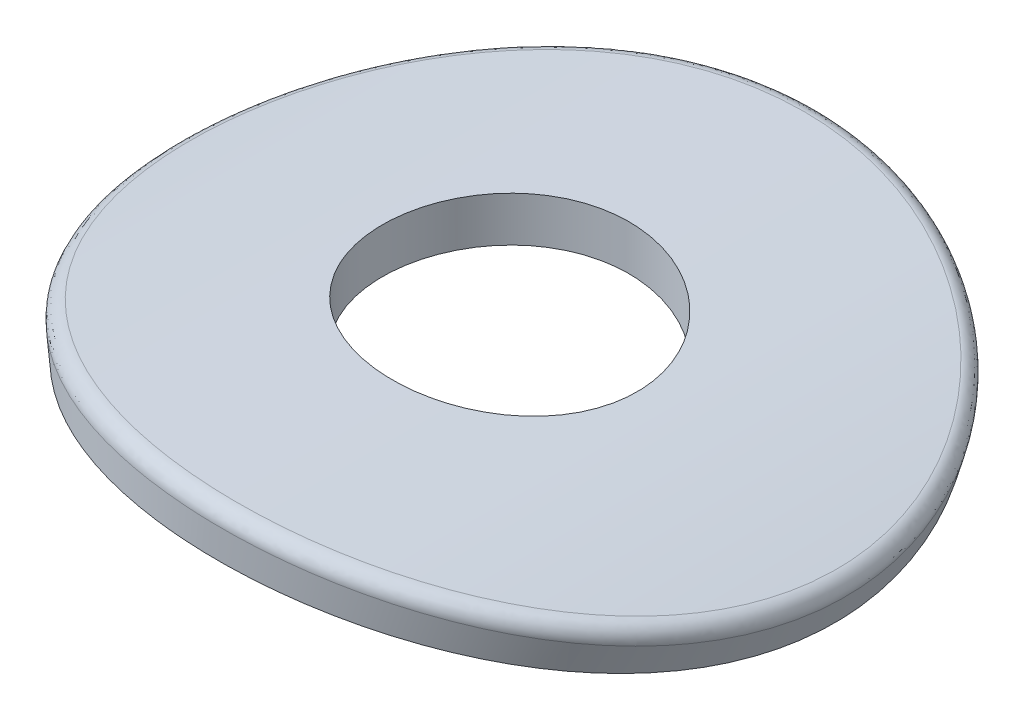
ISO-10303-21;
HEADER;
FILE_DESCRIPTION(('STEP AP214'),'2;1');
FILE_NAME('part.step','',(''),(''),'','','');
FILE_SCHEMA(('AUTOMOTIVE_DESIGN { 1 0 10303 214 1 1 1 1 }'));
ENDSEC;
DATA;
#1=APPLICATION_CONTEXT('core data for automotive mechanical design processes');
#2=APPLICATION_PROTOCOL_DEFINITION('international standard','automotive_design',2000,#1);
#3=PRODUCT_CONTEXT('',#1,'mechanical');
#4=PRODUCT('Part','Part','',(#3));
#5=PRODUCT_RELATED_PRODUCT_CATEGORY('part','',(#4));
#6=PRODUCT_DEFINITION_FORMATION('','',#4);
#7=PRODUCT_DEFINITION_CONTEXT('part definition',#1,'design');
#8=PRODUCT_DEFINITION('design','',#6,#7);
#9=PRODUCT_DEFINITION_SHAPE('','',#8);
#10=(LENGTH_UNIT() NAMED_UNIT(*) SI_UNIT(.MILLI.,.METRE.));
#11=(NAMED_UNIT(*) PLANE_ANGLE_UNIT() SI_UNIT($,.RADIAN.));
#12=(NAMED_UNIT(*) SI_UNIT($,.STERADIAN.) SOLID_ANGLE_UNIT());
#13=UNCERTAINTY_MEASURE_WITH_UNIT(LENGTH_MEASURE(1.E-05),#10,'distance_accuracy_value','');
#14=(GEOMETRIC_REPRESENTATION_CONTEXT(3) GLOBAL_UNCERTAINTY_ASSIGNED_CONTEXT((#13)) GLOBAL_UNIT_ASSIGNED_CONTEXT((#10,
#11,#12)) REPRESENTATION_CONTEXT('',''));
#15=CARTESIAN_POINT('',(0.,0.,0.));
#16=DIRECTION('',(0.,0.,1.));
#17=DIRECTION('',(1.,0.,0.));
#18=AXIS2_PLACEMENT_3D('',#15,#16,#17);
#19=CARTESIAN_POINT('',(0.,0.,0.));
#20=DIRECTION('',(0.,0.,1.));
#21=DIRECTION('',(1.,0.,0.));
#22=AXIS2_PLACEMENT_3D('',#19,#20,#21);
#23=CYLINDRICAL_SURFACE('',#22,39.5);
#24=CARTESIAN_POINT('',(0.224697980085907,38.9991970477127,26.3088404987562));
#25=CARTESIAN_POINT('',(0.22892534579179,39.4994904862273,26.3091443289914));
#26=CARTESIAN_POINT('',(0.339173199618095,39.498543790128,25.8211320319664));
#27=CARTESIAN_POINT('',(0.527474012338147,38.9974916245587,26.3772736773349));
#28=CARTESIAN_POINT('',(0.53541609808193,39.4976784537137,26.377500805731));
#29=CARTESIAN_POINT('',(0.632375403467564,39.4960262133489,25.8865601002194));
#30=CARTESIAN_POINT('',(0.832911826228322,38.9922308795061,26.433333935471));
#31=CARTESIAN_POINT('',(0.844623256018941,39.4922825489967,26.4335040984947));
#32=CARTESIAN_POINT('',(0.928249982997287,39.4902133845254,25.9401796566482));
#33=CARTESIAN_POINT('',(1.44735166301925,38.9743050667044,26.5203479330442));
#34=CARTESIAN_POINT('',(1.46661412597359,39.4740258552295,26.5204233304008));
#35=CARTESIAN_POINT('',(1.52323829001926,39.471740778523,26.02338654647));
#36=CARTESIAN_POINT('',(1.75635367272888,38.9616400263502,26.5513017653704));
#37=CARTESIAN_POINT('',(1.7794141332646,39.4611653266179,26.5513441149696));
#38=CARTESIAN_POINT('',(1.82235200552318,39.4590810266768,26.0529739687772));
#39=CARTESIAN_POINT('',(2.37511438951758,38.9288440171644,26.5879032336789));
#40=CARTESIAN_POINT('',(2.4057621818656,39.4279198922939,26.587904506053));
#41=CARTESIAN_POINT('',(2.42163695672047,39.4268401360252,26.0879660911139));
#42=CARTESIAN_POINT('',(2.68487307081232,38.9087132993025,26.5935517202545));
#43=CARTESIAN_POINT('',(2.71932814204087,39.4075345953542,26.593547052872));
#44=CARTESIAN_POINT('',(2.72180815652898,39.4072592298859,26.0933716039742));
#45=CARTESIAN_POINT('',(3.30341480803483,38.8610747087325,26.5798737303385));
#46=CARTESIAN_POINT('',(3.34545760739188,39.3593293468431,26.5798844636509));
#47=CARTESIAN_POINT('',(3.32109462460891,39.3612835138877,26.0802946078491));
#48=CARTESIAN_POINT('',(3.61219786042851,38.8335668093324,26.560547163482));
#49=CARTESIAN_POINT('',(3.65803856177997,39.3315079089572,26.5605784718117));
#50=CARTESIAN_POINT('',(3.62020988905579,39.3348886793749,26.0618120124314));
#51=CARTESIAN_POINT('',(4.22600041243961,38.7715368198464,26.4969086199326));
#52=CARTESIAN_POINT('',(4.27938900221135,39.2687960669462,26.4970094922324));
#53=CARTESIAN_POINT('',(4.2150312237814,39.2756004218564,26.0009269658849));
#54=CARTESIAN_POINT('',(4.53102272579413,38.7370203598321,26.4526166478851));
#55=CARTESIAN_POINT('',(4.58817782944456,39.2339091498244,26.4527630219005));
#56=CARTESIAN_POINT('',(4.51073983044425,39.2427122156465,25.9585436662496));
#57=CARTESIAN_POINT('',(5.13562379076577,38.66144773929,26.3399197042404));
#58=CARTESIAN_POINT('',(5.20025164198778,39.1575429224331,26.3401836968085));
#59=CARTESIAN_POINT('',(5.09704445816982,39.1708738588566,25.8506723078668));
#60=CARTESIAN_POINT('',(5.43520255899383,38.6203915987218,26.2715148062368));
#61=CARTESIAN_POINT('',(5.5035510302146,39.1160609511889,26.2718452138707));
#62=CARTESIAN_POINT('',(5.38764049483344,39.131923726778,25.7851843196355));
#63=CARTESIAN_POINT('',(6.02711534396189,38.5323659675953,26.1107781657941));
#64=CARTESIAN_POINT('',(6.10282715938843,39.0271368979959,26.1112676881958));
#65=CARTESIAN_POINT('',(5.96179578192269,39.0485744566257,25.6313282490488));
#66=CARTESIAN_POINT('',(6.31944839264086,38.4853956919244,26.0184432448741));
#67=CARTESIAN_POINT('',(6.3988161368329,38.979690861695,26.0190175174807));
#68=CARTESIAN_POINT('',(6.24535409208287,39.0041745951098,25.5429571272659));
#69=CARTESIAN_POINT('',(6.89463961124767,38.3864169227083,25.8109208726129));
#70=CARTESIAN_POINT('',(6.9812253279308,38.8797152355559,25.8116830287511));
#71=CARTESIAN_POINT('',(6.80363784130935,38.9106751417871,25.3442305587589));
#72=CARTESIAN_POINT('',(7.17749756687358,38.3344083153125,25.6957329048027));
#73=CARTESIAN_POINT('',(7.26765382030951,38.827182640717,25.6965895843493));
#74=CARTESIAN_POINT('',(7.07836308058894,38.8615754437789,25.233874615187));
#75=CARTESIAN_POINT('',(7.7398714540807,38.2247554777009,25.4397450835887));
#76=CARTESIAN_POINT('',(7.83715534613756,38.7164315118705,25.4408099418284));
#77=CARTESIAN_POINT('',(7.62449637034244,38.7581770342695,24.9886911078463));
#78=CARTESIAN_POINT('',(8.01909954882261,38.166998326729,25.2983467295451));
#79=CARTESIAN_POINT('',(8.11994434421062,38.6580960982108,25.2995154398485));
#80=CARTESIAN_POINT('',(7.89562296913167,38.7037749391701,24.8532918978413));
#81=CARTESIAN_POINT('',(8.42784295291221,38.0779521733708,25.0692755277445));
#82=CARTESIAN_POINT('',(8.53389568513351,38.5681669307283,25.0706254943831));
#83=CARTESIAN_POINT('',(8.29255884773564,38.619966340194,24.6339604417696));
#84=CARTESIAN_POINT('',(8.56242204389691,38.0478649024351,24.9900797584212));
#85=CARTESIAN_POINT('',(8.67020475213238,38.5377788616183,24.9914838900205));
#86=CARTESIAN_POINT('',(8.42325913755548,38.5916592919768,24.5581351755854));
#87=CARTESIAN_POINT('',(8.82793958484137,37.9870597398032,24.8263144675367));
#88=CARTESIAN_POINT('',(8.93914606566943,38.476363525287,24.8278255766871));
#89=CARTESIAN_POINT('',(8.68126484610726,38.5344404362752,24.4012625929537));
#90=CARTESIAN_POINT('',(8.95887798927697,37.9563418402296,24.7417448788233));
#91=CARTESIAN_POINT('',(9.07177812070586,38.4453360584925,24.7433077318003));
#92=CARTESIAN_POINT('',(8.80857022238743,38.5055286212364,24.3202152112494));
#93=CARTESIAN_POINT('',(9.34633263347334,37.8633723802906,24.4798730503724));
#94=CARTESIAN_POINT('',(9.46428995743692,38.351423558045,24.4815715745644));
#95=CARTESIAN_POINT('',(9.18516100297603,38.4180839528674,24.0693532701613));
#96=CARTESIAN_POINT('',(9.59747582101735,37.800307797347,24.2944147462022));
#97=CARTESIAN_POINT('',(9.71871406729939,38.2877238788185,24.296209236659));
#98=CARTESIAN_POINT('',(9.42910891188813,38.3588444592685,23.891825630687));
#99=CARTESIAN_POINT('',(9.96155288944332,37.7052428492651,24.0008241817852));
#100=CARTESIAN_POINT('',(10.0875473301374,38.1917072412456,24.0027847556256));
#101=CARTESIAN_POINT('',(9.78279241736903,38.2695937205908,23.610827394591));
#102=CARTESIAN_POINT('',(10.0808177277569,37.6734730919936,23.9003818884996));
#103=CARTESIAN_POINT('',(10.2083855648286,38.1596160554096,23.9023871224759));
#104=CARTESIAN_POINT('',(9.89865895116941,38.2397750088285,23.5146990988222));
#105=CARTESIAN_POINT('',(10.3149718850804,37.6099463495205,23.694542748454));
#106=CARTESIAN_POINT('',(10.4456396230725,38.0954445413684,23.6966333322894));
#107=CARTESIAN_POINT('',(10.1261858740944,38.180154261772,23.3176793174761));
#108=CARTESIAN_POINT('',(10.4298610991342,37.5781893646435,23.5891457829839));
#109=CARTESIAN_POINT('',(10.5620547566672,38.063364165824,23.5912760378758));
#110=CARTESIAN_POINT('',(10.2378461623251,38.1503522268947,23.2167877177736));
#111=CARTESIAN_POINT('',(10.6575349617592,37.5141706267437,23.3712812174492));
#112=CARTESIAN_POINT('',(10.792763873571,37.9986917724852,23.3734867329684));
#113=CARTESIAN_POINT('',(10.4591268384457,38.0902886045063,23.0082513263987));
#114=CARTESIAN_POINT('',(10.7702232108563,37.4819124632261,23.2587110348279));
#115=CARTESIAN_POINT('',(10.9069593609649,37.9661034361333,23.2609513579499));
#116=CARTESIAN_POINT('',(10.5686536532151,38.0600306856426,22.9005086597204));
#117=CARTESIAN_POINT('',(10.9907364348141,37.4177516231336,23.028615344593));
#118=CARTESIAN_POINT('',(11.1304339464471,37.9012855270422,23.0309204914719));
#119=CARTESIAN_POINT('',(10.7829019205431,37.9998869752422,22.6803865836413));
#120=CARTESIAN_POINT('',(11.098561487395,37.3858489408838,22.9110899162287));
#121=CARTESIAN_POINT('',(11.2397126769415,37.8690558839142,22.9134237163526));
#122=CARTESIAN_POINT('',(10.8876234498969,37.9700011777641,22.5680072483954));
#123=CARTESIAN_POINT('',(11.414301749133,37.2910038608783,22.5512995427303));
#124=CARTESIAN_POINT('',(11.5597558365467,37.7732280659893,22.5536773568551));
#125=CARTESIAN_POINT('',(11.1942374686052,37.8811867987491,22.2240578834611));
#126=CARTESIAN_POINT('',(11.614527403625,37.228911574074,22.301777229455));
#127=CARTESIAN_POINT('',(11.7627089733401,37.7104961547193,22.3041888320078));
#128=CARTESIAN_POINT('',(11.388623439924,37.8230891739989,21.9856350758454));
#129=CARTESIAN_POINT('',(11.8980345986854,37.1387393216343,21.9146840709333));
#130=CARTESIAN_POINT('',(12.0500853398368,37.6193953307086,21.9171568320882));
#131=CARTESIAN_POINT('',(11.6639219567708,37.7387354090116,21.6157510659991));
#132=CARTESIAN_POINT('',(11.9897370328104,37.1091744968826,21.7835093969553));
#133=CARTESIAN_POINT('',(12.1430513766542,37.5895224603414,21.7859864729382));
#134=CARTESIAN_POINT('',(11.7529798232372,37.7110812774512,21.4904064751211));
#135=CARTESIAN_POINT('',(12.1674787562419,37.0511832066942,21.5169265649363));
#136=CARTESIAN_POINT('',(12.3232535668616,37.5309260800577,21.5194029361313));
#137=CARTESIAN_POINT('',(11.9255219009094,37.6568731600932,21.2358087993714));
#138=CARTESIAN_POINT('',(12.2535181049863,37.0227567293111,21.3815184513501));
#139=CARTESIAN_POINT('',(12.4104886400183,37.5022028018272,21.3839892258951));
#140=CARTESIAN_POINT('',(12.0090061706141,37.6303191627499,21.1065557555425));
#141=CARTESIAN_POINT('',(12.5026626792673,36.9395385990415,20.9691978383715));
#142=CARTESIAN_POINT('',(12.6631329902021,37.4181067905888,20.9716014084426));
#143=CARTESIAN_POINT('',(12.2506785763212,37.5526235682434,20.7131504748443));
#144=CARTESIAN_POINT('',(12.6568492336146,36.886790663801,20.6861144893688));
#145=CARTESIAN_POINT('',(12.8194843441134,37.3648069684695,20.6884773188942));
#146=CARTESIAN_POINT('',(12.400139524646,37.503431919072,20.4432808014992));
#147=CARTESIAN_POINT('',(12.8661710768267,36.8139431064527,20.2566190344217));
#148=CARTESIAN_POINT('',(13.0317542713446,37.2911960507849,20.2589222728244));
#149=CARTESIAN_POINT('',(12.6030640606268,37.4355127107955,20.0338735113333));
#150=CARTESIAN_POINT('',(12.9312219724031,36.7910928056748,20.1154234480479));
#151=CARTESIAN_POINT('',(13.0977289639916,37.2681039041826,20.1176914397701));
#152=CARTESIAN_POINT('',(12.6661299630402,37.4142111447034,19.8992880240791));
#153=CARTESIAN_POINT('',(13.0553042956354,36.7471684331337,19.8300334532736));
#154=CARTESIAN_POINT('',(13.2235807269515,37.2237133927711,19.8322195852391));
#155=CARTESIAN_POINT('',(12.7863977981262,37.3732799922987,19.6273449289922));
#156=CARTESIAN_POINT('',(13.1143357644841,36.7260943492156,19.6858390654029));
#157=CARTESIAN_POINT('',(13.2834563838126,37.2024154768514,19.6879794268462));
#158=CARTESIAN_POINT('',(12.8435997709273,37.3536503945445,19.4899873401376));
#159=CARTESIAN_POINT('',(13.2820475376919,36.6658123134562,19.2489707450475));
#160=CARTESIAN_POINT('',(13.4535884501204,37.1414879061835,19.2509273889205));
#161=CARTESIAN_POINT('',(13.006048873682,37.2975318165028,19.0740455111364));
#162=CARTESIAN_POINT('',(13.3813811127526,36.6295319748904,18.9519382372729));
#163=CARTESIAN_POINT('',(13.5543547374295,37.1048227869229,18.9537763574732));
#164=CARTESIAN_POINT('',(13.102174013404,37.2638012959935,18.7915221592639));
#165=CARTESIAN_POINT('',(13.5104608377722,36.5819432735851,18.5000770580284));
#166=CARTESIAN_POINT('',(13.6853044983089,37.0567276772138,18.5017258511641));
#167=CARTESIAN_POINT('',(13.227071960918,37.2195713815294,18.3618696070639));
#168=CARTESIAN_POINT('',(13.5501616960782,36.5672211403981,18.3484337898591));
#169=CARTESIAN_POINT('',(13.7255836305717,37.0418479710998,18.3500079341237));
#170=CARTESIAN_POINT('',(13.265484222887,37.2058910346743,18.2177019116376));
#171=CARTESIAN_POINT('',(13.6228745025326,36.5401440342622,18.043367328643));
#172=CARTESIAN_POINT('',(13.799358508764,37.0144799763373,18.0447824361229));
#173=CARTESIAN_POINT('',(13.3358440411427,37.1807296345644,17.9276463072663));
#174=CARTESIAN_POINT('',(13.6558863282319,36.5277891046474,17.8899441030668));
#175=CARTESIAN_POINT('',(13.832852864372,37.001992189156,17.8912771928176));
#176=CARTESIAN_POINT('',(13.3677914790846,37.1692486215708,17.7817583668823));
#177=CARTESIAN_POINT('',(13.744760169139,36.4944199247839,17.4272683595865));
#178=CARTESIAN_POINT('',(13.9230340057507,36.9682622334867,17.4283221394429));
#179=CARTESIAN_POINT('',(13.4537684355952,37.1382538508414,17.3420127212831));
#180=CARTESIAN_POINT('',(13.7904918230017,36.4770896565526,17.1155003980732));
#181=CARTESIAN_POINT('',(13.969437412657,36.9507466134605,17.1163745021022));
#182=CARTESIAN_POINT('',(13.4979628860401,37.1221775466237,17.045969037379));
#183=CARTESIAN_POINT('',(13.85113402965,36.4540582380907,16.5147429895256));
#184=CARTESIAN_POINT('',(14.0309757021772,36.9274668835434,16.5152376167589));
#185=CARTESIAN_POINT('',(13.5565700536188,37.1008125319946,16.4756199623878));
#186=CARTESIAN_POINT('',(13.868295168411,36.4475084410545,16.2260200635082));
#187=CARTESIAN_POINT('',(14.0483899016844,36.9208466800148,16.2263352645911));
#188=CARTESIAN_POINT('',(13.5731574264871,37.0947365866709,16.2015585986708));
#189=CARTESIAN_POINT('',(13.8763793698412,36.4444238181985,15.7928537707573));
#190=CARTESIAN_POINT('',(14.0565936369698,36.917728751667,15.7928880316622));
#191=CARTESIAN_POINT('',(13.5809721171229,37.0918748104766,15.7901790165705));
#192=CARTESIAN_POINT('',(13.8761303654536,36.4445192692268,15.6484383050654));
#193=CARTESIAN_POINT('',(14.0563409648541,36.917825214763,15.6483797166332));
#194=CARTESIAN_POINT('',(13.5807318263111,37.0919631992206,15.6529921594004));
#195=CARTESIAN_POINT('',(13.869740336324,36.4469563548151,15.3596586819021));
#196=CARTESIAN_POINT('',(14.049856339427,36.9202886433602,15.3594115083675));
#197=CARTESIAN_POINT('',(13.5745553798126,37.09422403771,15.3787617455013));
#198=CARTESIAN_POINT('',(13.863599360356,36.4492979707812,15.2152945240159));
#199=CARTESIAN_POINT('',(14.0436245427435,36.9226555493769,15.21495399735));
#200=CARTESIAN_POINT('',(13.568619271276,37.0963964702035,15.2417181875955));
#201=CARTESIAN_POINT('',(13.8362598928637,36.4597103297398,14.7828840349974));
#202=CARTESIAN_POINT('',(14.0158808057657,36.9331801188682,14.7822678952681));
#203=CARTESIAN_POINT('',(13.5422004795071,37.1060535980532,14.8312420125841));
#204=CARTESIAN_POINT('',(13.8061468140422,36.4711678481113,14.4954178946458));
#205=CARTESIAN_POINT('',(13.9853238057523,36.944760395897,14.4946273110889));
#206=CARTESIAN_POINT('',(13.5131092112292,37.116677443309,14.5583672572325));
#207=CARTESIAN_POINT('',(13.7227522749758,36.5026875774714,13.9248370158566));
#208=CARTESIAN_POINT('',(13.9007011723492,36.976620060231,13.9237026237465));
#209=CARTESIAN_POINT('',(13.43246567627,37.1459376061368,14.0163568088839));
#210=CARTESIAN_POINT('',(13.6694708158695,36.522749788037,13.6417222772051));
#211=CARTESIAN_POINT('',(13.846640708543,36.9968975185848,13.6404347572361));
#212=CARTESIAN_POINT('',(13.3809134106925,37.164573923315,13.7472211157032));
#213=CARTESIAN_POINT('',(13.5425365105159,36.5700912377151,13.0908107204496));
#214=CARTESIAN_POINT('',(13.7178496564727,37.0447476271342,13.0892287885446));
#215=CARTESIAN_POINT('',(13.2581149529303,37.2085541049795,13.2235278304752));
#216=CARTESIAN_POINT('',(13.4696337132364,36.5971033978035,12.8228196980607));
#217=CARTESIAN_POINT('',(13.6438874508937,37.0720476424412,12.8211113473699));
#218=CARTESIAN_POINT('',(13.187593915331,37.2336497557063,12.9687850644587));
#219=CARTESIAN_POINT('',(13.3449843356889,36.6427430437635,12.4265984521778));
#220=CARTESIAN_POINT('',(13.5174248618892,37.1181771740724,12.4246950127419));
#221=CARTESIAN_POINT('',(13.0669481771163,37.2760870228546,12.5919094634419));
#222=CARTESIAN_POINT('',(13.3008809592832,36.6588114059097,12.2954747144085));
#223=CARTESIAN_POINT('',(13.4726844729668,37.1344168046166,12.2935175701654));
#224=CARTESIAN_POINT('',(13.0242513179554,37.2910332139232,12.4671470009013));
#225=CARTESIAN_POINT('',(13.230964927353,36.6841243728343,12.1003034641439));
#226=CARTESIAN_POINT('',(13.4017582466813,37.15999995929,12.09826487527));
#227=CARTESIAN_POINT('',(12.956565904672,37.3145812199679,12.2814361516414));
#228=CARTESIAN_POINT('',(13.207032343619,36.6927639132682,12.0354977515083));
#229=CARTESIAN_POINT('',(13.377481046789,37.1687313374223,12.0334349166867));
#230=CARTESIAN_POINT('',(12.9333970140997,37.3226188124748,12.2197703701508));
#231=CARTESIAN_POINT('',(13.1579798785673,36.710414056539,11.9064958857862));
#232=CARTESIAN_POINT('',(13.3277240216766,37.1865694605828,11.9043871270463));
#233=CARTESIAN_POINT('',(12.8858765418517,37.3390521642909,12.0969305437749));
#234=CARTESIAN_POINT('',(13.1328599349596,36.7194246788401,11.842299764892));
#235=CARTESIAN_POINT('',(13.3022442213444,37.1956761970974,11.8401693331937));
#236=CARTESIAN_POINT('',(12.861524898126,37.3474479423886,12.0357565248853));
#237=CARTESIAN_POINT('',(13.004232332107,36.7654081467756,11.5226613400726));
#238=CARTESIAN_POINT('',(13.1717876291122,37.242145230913,11.5204559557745));
#239=CARTESIAN_POINT('',(12.7368436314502,37.3902922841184,11.7311841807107));
#240=CARTESIAN_POINT('',(12.8916001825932,36.8051867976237,11.2711360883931));
#241=CARTESIAN_POINT('',(13.0575543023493,37.2823437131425,11.268864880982));
#242=CARTESIAN_POINT('',(12.6277052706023,37.4273509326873,11.4915747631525));
#243=CARTESIAN_POINT('',(12.6477884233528,36.8898261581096,10.7784400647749));
#244=CARTESIAN_POINT('',(12.8102903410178,37.3678755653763,10.776064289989));
#245=CARTESIAN_POINT('',(12.3913874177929,37.5062530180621,11.0220109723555));
#246=CARTESIAN_POINT('',(12.5166080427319,36.9346870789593,10.5372697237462));
#247=CARTESIAN_POINT('',(12.6772672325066,37.4132066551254,10.5348584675));
#248=CARTESIAN_POINT('',(12.2642071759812,37.5480966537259,10.792057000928));
#249=CARTESIAN_POINT('',(12.3030165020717,37.0062884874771,10.1779738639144));
#250=CARTESIAN_POINT('',(12.4606751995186,37.4855627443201,10.1755056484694));
#251=CARTESIAN_POINT('',(12.0570350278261,37.6149377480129,10.4492717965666));
#252=CARTESIAN_POINT('',(12.2269026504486,37.0315579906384,10.0556276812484));
#253=CARTESIAN_POINT('',(12.3835016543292,37.5110962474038,10.0531525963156));
#254=CARTESIAN_POINT('',(11.9831927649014,37.6385368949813,10.3325106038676));
#255=CARTESIAN_POINT('',(12.0700936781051,37.0830477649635,9.81433689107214));
#256=CARTESIAN_POINT('',(12.224517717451,37.5631239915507,9.81185663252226));
#257=CARTESIAN_POINT('',(11.830979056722,37.6866595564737,10.1020926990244));
#258=CARTESIAN_POINT('',(11.9893984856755,37.109268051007,9.69539233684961));
#259=CARTESIAN_POINT('',(12.1427080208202,37.5896180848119,9.69291328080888));
#260=CARTESIAN_POINT('',(11.7526075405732,37.7111830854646,9.98843603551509));
#261=CARTESIAN_POINT('',(11.7404647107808,37.1892060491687,9.34365523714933));
#262=CARTESIAN_POINT('',(11.8903651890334,37.6703817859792,9.34121895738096));
#263=CARTESIAN_POINT('',(11.5108870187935,37.7859488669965,9.65236741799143));
#264=CARTESIAN_POINT('',(11.5653516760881,37.2442097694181,9.1159151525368));
#265=CARTESIAN_POINT('',(11.7128578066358,37.7259532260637,9.11350280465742));
#266=CARTESIAN_POINT('',(11.3409065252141,37.8373946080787,9.43481468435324));
#267=CARTESIAN_POINT('',(11.1980294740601,37.3564640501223,8.67554331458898));
#268=CARTESIAN_POINT('',(11.3405417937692,37.8393630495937,8.67320737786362));
#269=CARTESIAN_POINT('',(10.9842608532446,37.9424635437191,9.01395320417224));
#270=CARTESIAN_POINT('',(11.0058163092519,37.4137151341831,8.46291511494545));
#271=CARTESIAN_POINT('',(11.1457348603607,37.8972012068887,8.46062666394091));
#272=CARTESIAN_POINT('',(10.7975917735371,37.9960872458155,8.8106478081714));
#273=CARTESIAN_POINT('',(10.7059833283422,37.5003071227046,8.1560357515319));
#274=CARTESIAN_POINT('',(10.8418582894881,37.9846871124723,8.15381339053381));
#275=CARTESIAN_POINT('',(10.5062043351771,38.0772878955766,8.51698296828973));
#276=CARTESIAN_POINT('',(10.6041080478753,37.5292936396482,8.05574253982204));
#277=CARTESIAN_POINT('',(10.7386222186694,38.0139704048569,8.0535522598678));
#278=CARTESIAN_POINT('',(10.4071661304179,38.1044853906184,8.42096675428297));
#279=CARTESIAN_POINT('',(10.3965298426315,37.5874098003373,7.85915646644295));
#280=CARTESIAN_POINT('',(10.528279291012,38.0726793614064,7.85703604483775));
#281=CARTESIAN_POINT('',(10.2054264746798,38.1590119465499,8.23280131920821));
#282=CARTESIAN_POINT('',(10.2908269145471,37.6165394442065,7.76286360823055));
#283=CARTESIAN_POINT('',(10.4211730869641,38.1021049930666,7.76078035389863));
#284=CARTESIAN_POINT('',(10.1027250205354,38.1863410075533,8.14065210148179));
#285=CARTESIAN_POINT('',(9.95048168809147,37.7087324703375,7.46478996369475));
#286=CARTESIAN_POINT('',(10.0763548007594,38.1952241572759,7.46285913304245));
#287=CARTESIAN_POINT('',(9.77206866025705,38.2728528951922,7.85539523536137));
#288=CARTESIAN_POINT('',(9.70901408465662,37.7718144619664,7.27073225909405));
#289=CARTESIAN_POINT('',(9.83171277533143,38.2589432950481,7.2688908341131));
#290=CARTESIAN_POINT('',(9.53751094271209,38.3320736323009,7.66966689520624));
#291=CARTESIAN_POINT('',(9.21083162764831,37.8965485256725,6.90347195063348));
#292=CARTESIAN_POINT('',(9.32702633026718,38.3849340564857,6.90183001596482));
#293=CARTESIAN_POINT('',(9.05341417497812,38.4492880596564,7.31799843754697));
#294=CARTESIAN_POINT('',(8.95411621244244,37.9582005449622,6.73027011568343));
#295=CARTESIAN_POINT('',(9.06697974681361,38.4472077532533,6.72872663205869));
#296=CARTESIAN_POINT('',(8.80387457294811,38.5072817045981,7.15205904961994));
#297=CARTESIAN_POINT('',(8.42643647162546,38.0789702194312,6.40525771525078));
#298=CARTESIAN_POINT('',(8.53249604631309,38.5691885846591,6.40392724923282));
#299=CARTESIAN_POINT('',(8.29118521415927,38.6209163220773,6.84076072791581));
#300=CARTESIAN_POINT('',(8.15546435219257,38.1380864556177,6.25345902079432));
#301=CARTESIAN_POINT('',(8.25804952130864,38.6288964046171,6.25223306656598));
#302=CARTESIAN_POINT('',(8.02802801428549,38.6765559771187,6.69541321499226));
#303=CARTESIAN_POINT('',(7.73985963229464,38.2239181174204,6.04290214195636));
#304=CARTESIAN_POINT('',(7.83712099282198,38.7155916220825,6.04182387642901));
#305=CARTESIAN_POINT('',(7.62444941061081,38.7574074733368,6.49378502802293));
#306=CARTESIAN_POINT('',(7.5997816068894,38.2520583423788,5.97556578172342));
#307=CARTESIAN_POINT('',(7.6952626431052,38.7440133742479,5.97454032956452));
#308=CARTESIAN_POINT('',(7.488431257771,38.7839265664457,6.4293005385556));
#309=CARTESIAN_POINT('',(7.31683614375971,38.3072514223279,5.84667261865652));
#310=CARTESIAN_POINT('',(7.40873161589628,38.7997592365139,5.84575219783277));
#311=CARTESIAN_POINT('',(7.21365180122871,38.8359726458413,6.30584353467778));
#312=CARTESIAN_POINT('',(7.17396861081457,38.3343042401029,5.78511601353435));
#313=CARTESIAN_POINT('',(7.2640577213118,38.8270837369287,5.78424640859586));
#314=CARTESIAN_POINT('',(7.07489040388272,38.8614995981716,6.24687120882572));
#315=CARTESIAN_POINT('',(6.86755727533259,38.3905189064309,5.66049095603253));
#316=CARTESIAN_POINT('',(6.953785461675,38.8838624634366,5.65972945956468));
#317=CARTESIAN_POINT('',(6.77736213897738,38.914559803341,6.12749909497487));
#318=CARTESIAN_POINT('',(6.70366116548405,38.4195217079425,5.5981952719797));
#319=CARTESIAN_POINT('',(6.78782809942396,38.9131569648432,5.59748843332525));
#320=CARTESIAN_POINT('',(6.61826265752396,38.9419450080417,6.06784224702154));
#321=CARTESIAN_POINT('',(6.37281403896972,38.4758451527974,5.48120248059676));
#322=CARTESIAN_POINT('',(6.45283289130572,38.970047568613,5.48060283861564));
#323=CARTESIAN_POINT('',(6.29719005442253,38.9951519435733,5.95582687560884));
#324=CARTESIAN_POINT('',(6.20586299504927,38.5031657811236,5.42650544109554));
#325=CARTESIAN_POINT('',(6.2837932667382,38.997644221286,5.4259566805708));
#326=CARTESIAN_POINT('',(6.13521690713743,39.0209736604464,5.90346841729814));
#327=CARTESIAN_POINT('',(5.86927618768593,38.5559628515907,5.3248777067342));
#328=CARTESIAN_POINT('',(5.94300778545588,39.050976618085,5.32442701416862));
#329=CARTESIAN_POINT('',(5.808711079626,39.0709118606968,5.80619021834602));
#330=CARTESIAN_POINT('',(5.69964006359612,38.58143904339,5.27794806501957));
#331=CARTESIAN_POINT('',(5.77125934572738,39.0767127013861,5.27754298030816));
#332=CARTESIAN_POINT('',(5.64417805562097,39.0950281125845,5.76127148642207));
#333=CARTESIAN_POINT('',(5.35816869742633,38.6303889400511,5.19196766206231));
#334=CARTESIAN_POINT('',(5.42554654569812,39.1261651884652,5.19164857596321));
#335=CARTESIAN_POINT('',(5.31293444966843,39.1414191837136,5.67896127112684));
#336=CARTESIAN_POINT('',(5.18633343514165,38.6538626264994,5.15291697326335));
#337=CARTESIAN_POINT('',(5.25157951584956,39.149882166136,5.15263684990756));
#338=CARTESIAN_POINT('',(5.146223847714,39.1636939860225,5.64156985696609));
#339=CARTESIAN_POINT('',(4.8408104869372,38.6986898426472,5.08272533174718));
#340=CARTESIAN_POINT('',(4.90178057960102,39.1951772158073,5.08251755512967));
#341=CARTESIAN_POINT('',(4.81108751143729,39.2062744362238,5.57437264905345));
#342=CARTESIAN_POINT('',(4.66712385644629,38.7200445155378,5.05158009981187));
#343=CARTESIAN_POINT('',(4.72594716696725,39.2167569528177,5.05140457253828));
#344=CARTESIAN_POINT('',(4.64266275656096,39.2265811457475,5.54456275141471));
#345=CARTESIAN_POINT('',(4.31814253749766,38.7605448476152,4.99736373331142));
#346=CARTESIAN_POINT('',(4.372662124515,39.2576884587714,4.99724606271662));
#347=CARTESIAN_POINT('',(4.30436086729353,39.2651430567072,5.49268277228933));
#348=CARTESIAN_POINT('',(4.14284785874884,38.7796905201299,4.97429255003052));
#349=CARTESIAN_POINT('',(4.19520767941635,39.2770407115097,4.97419956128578));
#350=CARTESIAN_POINT('',(4.13448374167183,39.2833982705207,5.47061264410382));
#351=CARTESIAN_POINT('',(3.7911504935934,38.8156719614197,4.93634327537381));
#352=CARTESIAN_POINT('',(3.83918499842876,39.3134162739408,4.93629182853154));
#353=CARTESIAN_POINT('',(3.79369388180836,39.3177722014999,5.43431111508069));
#354=CARTESIAN_POINT('',(3.61474804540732,38.8325082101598,4.92146347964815));
#355=CARTESIAN_POINT('',(3.66061387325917,39.3304404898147,4.92142821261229));
#356=CARTESIAN_POINT('',(3.62278137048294,39.3338913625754,5.42007808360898));
#357=CARTESIAN_POINT('',(3.26127817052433,38.8638018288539,4.89992924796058));
#358=CARTESIAN_POINT('',(3.30280412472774,39.36209079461,4.89991780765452));
#359=CARTESIAN_POINT('',(3.28028237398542,39.3639339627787,5.39947805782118));
#360=CARTESIAN_POINT('',(3.08421076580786,38.8782592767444,4.89327454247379));
#361=CARTESIAN_POINT('',(3.12356225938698,39.3767173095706,4.89327035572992));
#362=CARTESIAN_POINT('',(3.10869591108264,39.3778574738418,5.39311080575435));
#363=CARTESIAN_POINT('',(2.76784115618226,38.9019096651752,4.88867499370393));
#364=CARTESIAN_POINT('',(2.80331101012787,39.4006520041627,4.88867589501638));
#365=CARTESIAN_POINT('',(2.80210152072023,39.4007172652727,5.38871008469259));
#366=CARTESIAN_POINT('',(2.62858884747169,38.9115665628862,4.8891675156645));
#367=CARTESIAN_POINT('',(2.66234975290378,39.4104280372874,4.88916788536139));
#368=CARTESIAN_POINT('',(2.66714573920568,39.4100825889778,5.38918144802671));
#369=CARTESIAN_POINT('',(2.35000713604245,38.9293809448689,4.89524091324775));
#370=CARTESIAN_POINT('',(2.38035198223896,39.4284686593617,4.89523449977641));
#371=CARTESIAN_POINT('',(2.39726383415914,39.427419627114,5.39499038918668));
#372=CARTESIAN_POINT('',(2.21067773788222,38.9375385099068,4.90082151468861));
#373=CARTESIAN_POINT('',(2.2393138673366,39.4367334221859,4.90080891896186));
#374=CARTESIAN_POINT('',(2.26233770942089,39.435391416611,5.40032770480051));
#375=CARTESIAN_POINT('',(1.79300946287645,38.9597379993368,4.92529450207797));
#376=CARTESIAN_POINT('',(1.81652155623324,39.4592368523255,4.92525471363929));
#377=CARTESIAN_POINT('',(1.85792515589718,39.4572037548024,5.4237239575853));
#378=CARTESIAN_POINT('',(1.5149049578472,38.9715131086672,4.95191675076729));
#379=CARTESIAN_POINT('',(1.53500059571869,39.4711910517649,4.95184809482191));
#380=CARTESIAN_POINT('',(1.58872166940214,39.468947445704,5.44916594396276));
#381=CARTESIAN_POINT('',(0.961643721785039,38.9890496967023,5.02542543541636));
#382=CARTESIAN_POINT('',(0.974942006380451,39.4890365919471,5.0252764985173));
#383=CARTESIAN_POINT('',(1.0529322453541,39.4868735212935,5.51946147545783));
#384=CARTESIAN_POINT('',(0.686485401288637,38.9948145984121,5.07230031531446));
#385=CARTESIAN_POINT('',(0.696391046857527,39.4949312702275,5.07210319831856));
#386=CARTESIAN_POINT('',(0.786344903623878,39.4930590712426,5.56430395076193));
#387=CARTESIAN_POINT('',(0.140006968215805,39.0005403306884,5.18609953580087));
#388=CARTESIAN_POINT('',(0.143173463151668,39.500870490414,5.18578235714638));
#389=CARTESIAN_POINT('',(0.257108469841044,39.5000495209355,5.67311590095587));
#390=CARTESIAN_POINT('',(-0.131312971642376,39.000500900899,5.25302477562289));
#391=CARTESIAN_POINT('',(-0.131504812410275,39.5009141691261,5.2526407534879));
#392=CARTESIAN_POINT('',(-0.00554044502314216,39.5008541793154,5.73708623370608));
#393=CARTESIAN_POINT('',(-0.668158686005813,38.9949156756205,5.40681482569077));
#394=CARTESIAN_POINT('',(-0.675006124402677,39.4954498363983,5.40627611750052));
#395=CARTESIAN_POINT('',(-0.525277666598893,39.4973624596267,5.88408675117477));
#396=CARTESIAN_POINT('',(-0.933684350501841,38.9893697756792,5.49368001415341));
#397=CARTESIAN_POINT('',(-0.943838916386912,39.4899406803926,5.49305986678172));
#398=CARTESIAN_POINT('',(-0.78236586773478,39.4930659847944,5.96711729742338));
#399=CARTESIAN_POINT('',(-1.4573686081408,38.9732076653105,5.68655039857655));
#400=CARTESIAN_POINT('',(-1.47406458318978,39.4738072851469,5.68575169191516));
#401=CARTESIAN_POINT('',(-1.28955569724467,39.4797593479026,6.15152426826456));
#402=CARTESIAN_POINT('',(-1.71552739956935,38.9625915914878,5.79255507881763));
#403=CARTESIAN_POINT('',(-1.73546486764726,39.4631818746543,5.79166632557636));
#404=CARTESIAN_POINT('',(-1.53965751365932,39.470749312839,6.25290019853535));
#405=CARTESIAN_POINT('',(-2.22339972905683,38.9367915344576,6.02350690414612));
#406=CARTESIAN_POINT('',(-2.24973472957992,39.4373244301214,6.022423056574));
#407=CARTESIAN_POINT('',(-2.03152692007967,39.4484919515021,6.47367719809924));
#408=CARTESIAN_POINT('',(-2.47310979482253,38.9216056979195,6.14846172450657));
#409=CARTESIAN_POINT('',(-2.50260772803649,39.4220889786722,6.14728135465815));
#410=CARTESIAN_POINT('',(-2.27329108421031,39.4352429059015,6.59308557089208));
#411=CARTESIAN_POINT('',(-2.83987367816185,38.8958868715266,6.34953003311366));
#412=CARTESIAN_POINT('',(-2.87401291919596,39.3962691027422,6.34818577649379));
#413=CARTESIAN_POINT('',(-2.62846333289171,39.4126284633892,6.78524930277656));
#414=CARTESIAN_POINT('',(-2.96084196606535,38.8868226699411,6.41883449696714));
#415=CARTESIAN_POINT('',(-2.99652434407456,39.3871656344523,6.4174406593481));
#416=CARTESIAN_POINT('',(-2.74562184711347,39.4046323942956,6.85148769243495));
#417=CARTESIAN_POINT('',(-3.20000545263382,38.8678034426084,6.56180287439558));
#418=CARTESIAN_POINT('',(-3.23874706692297,39.3680578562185,6.56031060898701));
#419=CARTESIAN_POINT('',(-2.97733275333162,39.3878024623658,6.98817401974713));
#420=CARTESIAN_POINT('',(-3.31820057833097,38.8578483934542,6.63546690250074));
#421=CARTESIAN_POINT('',(-3.35845833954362,39.3580533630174,6.63392665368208));
#422=CARTESIAN_POINT('',(-3.09188507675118,39.3789685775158,7.05862206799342));
#423=CARTESIAN_POINT('',(-3.69505021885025,38.8244086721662,6.88019407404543));
#424=CARTESIAN_POINT('',(-3.74018810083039,39.3244385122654,6.87852040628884));
#425=CARTESIAN_POINT('',(-3.45705343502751,39.3492394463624,7.29260898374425));
#426=CARTESIAN_POINT('',(-3.94817784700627,38.799305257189,7.05990475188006));
#427=CARTESIAN_POINT('',(-3.99659308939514,39.2991953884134,7.05813281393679));
#428=CARTESIAN_POINT('',(-3.70223113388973,39.3268397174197,7.46434904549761));
#429=CARTESIAN_POINT('',(-4.43826368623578,38.7461317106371,7.43996780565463));
#430=CARTESIAN_POINT('',(-4.49306441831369,39.2457095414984,7.43800198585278));
#431=CARTESIAN_POINT('',(-4.17690931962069,39.2792614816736,7.82748063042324));
#432=CARTESIAN_POINT('',(-4.67522070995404,38.7180613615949,7.64032169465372));
#433=CARTESIAN_POINT('',(-4.73312842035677,39.2174650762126,7.63827084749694));
#434=CARTESIAN_POINT('',(-4.40640865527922,39.2540827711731,8.01887359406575));
#435=CARTESIAN_POINT('',(-5.01718151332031,38.6745917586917,7.95497106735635));
#436=CARTESIAN_POINT('',(-5.07957485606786,39.1737155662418,7.95277731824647));
#437=CARTESIAN_POINT('',(-4.73778976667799,39.2149937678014,8.31958750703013));
#438=CARTESIAN_POINT('',(-5.12895047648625,38.6598704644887,8.06223756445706));
#439=CARTESIAN_POINT('',(-5.19282429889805,39.1588957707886,8.06000870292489));
#440=CARTESIAN_POINT('',(-4.84613247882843,39.2017402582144,8.42212518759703));
#441=CARTESIAN_POINT('',(-5.34794331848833,38.6300954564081,8.28143989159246));
#442=CARTESIAN_POINT('',(-5.41472893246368,39.1289194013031,8.27914564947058));
#443=CARTESIAN_POINT('',(-5.05833969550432,39.1749235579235,8.63157736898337));
#444=CARTESIAN_POINT('',(-5.45516724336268,38.6150417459,8.3933756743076));
#445=CARTESIAN_POINT('',(-5.52338373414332,39.1137627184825,8.3910523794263));
#446=CARTESIAN_POINT('',(-5.16220424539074,39.1613603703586,8.73849182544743));
#447=CARTESIAN_POINT('',(-5.7695630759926,38.5696196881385,8.73594937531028));
#448=CARTESIAN_POINT('',(-5.84201921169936,39.0680217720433,8.73357846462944));
#449=CARTESIAN_POINT('',(-5.46672115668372,39.1204153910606,9.0656382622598));
#450=CARTESIAN_POINT('',(-5.96951219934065,38.5389835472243,8.97340246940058));
#451=CARTESIAN_POINT('',(-6.04466224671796,39.0371677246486,8.97099586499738));
#452=CARTESIAN_POINT('',(-5.6603482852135,39.0927720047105,9.29231997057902));
#453=CARTESIAN_POINT('',(-6.25372792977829,38.4933949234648,9.34186800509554));
#454=CARTESIAN_POINT('',(-6.33271278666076,38.9912493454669,9.33939833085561));
#455=CARTESIAN_POINT('',(-5.93564281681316,39.0515913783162,9.64410900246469));
#456=CARTESIAN_POINT('',(-6.34593139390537,38.4782449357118,9.46686642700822));
#457=CARTESIAN_POINT('',(-6.42617198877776,38.9759869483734,9.46439070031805));
#458=CARTESIAN_POINT('',(-6.02496362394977,39.0378985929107,9.76345620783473));
#459=CARTESIAN_POINT('',(-6.52496218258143,38.4482034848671,9.72070176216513));
#460=CARTESIAN_POINT('',(-6.60765039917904,38.9457199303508,9.71822300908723));
#461=CARTESIAN_POINT('',(-6.19840016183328,39.010736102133,10.0058061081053));
#462=CARTESIAN_POINT('',(-6.6117894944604,38.4333120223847,9.84953868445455));
#463=CARTESIAN_POINT('',(-6.69566823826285,38.9307154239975,9.84706304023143));
#464=CARTESIAN_POINT('',(-6.28251588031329,38.9972663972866,10.1288088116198));
#465=CARTESIAN_POINT('',(-6.86393756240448,38.3892386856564,10.2417351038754));
#466=CARTESIAN_POINT('',(-6.95130903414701,38.8863020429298,10.2393148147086));
#467=CARTESIAN_POINT('',(-6.52670677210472,38.9574039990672,10.5030819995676));
#468=CARTESIAN_POINT('',(-7.02096617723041,38.3606510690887,10.5108342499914));
#469=CARTESIAN_POINT('',(-7.11051111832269,38.857494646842,10.5084473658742));
#470=CARTESIAN_POINT('',(-6.6786661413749,38.9315518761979,10.7596691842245));
#471=CARTESIAN_POINT('',(-7.23845658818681,38.3198758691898,10.9239723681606));
#472=CARTESIAN_POINT('',(-7.33101941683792,38.8164021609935,10.9216349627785));
#473=CARTESIAN_POINT('',(-6.88917803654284,38.8946563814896,11.1536247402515));
#474=CARTESIAN_POINT('',(-7.30794460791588,38.3066351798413,11.0632665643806));
#475=CARTESIAN_POINT('',(-7.40147914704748,38.8030565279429,11.0609605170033));
#476=CARTESIAN_POINT('',(-6.95644411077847,38.8826716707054,11.2864556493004));
#477=CARTESIAN_POINT('',(-7.40762060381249,38.2873843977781,11.274481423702));
#478=CARTESIAN_POINT('',(-7.50255065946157,38.7836529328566,11.2722227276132));
#479=CARTESIAN_POINT('',(-7.05291533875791,38.8652473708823,11.4878214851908));
#480=CARTESIAN_POINT('',(-7.44008720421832,38.2810690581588,11.3452667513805));
#481=CARTESIAN_POINT('',(-7.53547367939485,38.7772871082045,11.3430276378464));
#482=CARTESIAN_POINT('',(-7.08433502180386,38.8595312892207,11.5552980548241));
#483=CARTESIAN_POINT('',(-7.50347431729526,38.2686593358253,11.4874914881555));
#484=CARTESIAN_POINT('',(-7.59975282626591,38.7647773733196,11.4852938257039));
#485=CARTESIAN_POINT('',(-7.14569933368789,38.8482940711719,11.6909189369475));
#486=CARTESIAN_POINT('',(-7.53439471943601,38.2625649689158,11.5589309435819));
#487=CARTESIAN_POINT('',(-7.63110861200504,38.7586335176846,11.5567549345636));
#488=CARTESIAN_POINT('',(-7.17564385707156,38.8427729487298,11.7590632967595));
#489=CARTESIAN_POINT('',(-7.68512152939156,38.2326761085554,11.9178489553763));
#490=CARTESIAN_POINT('',(-7.78397732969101,38.7284988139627,11.9158239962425));
#491=CARTESIAN_POINT('',(-7.32157571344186,38.8157010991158,12.1013239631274));
#492=CARTESIAN_POINT('',(-7.79344664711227,38.2106023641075,12.2108071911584));
#493=CARTESIAN_POINT('',(-7.89383713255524,38.7062466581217,12.2088900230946));
#494=CARTESIAN_POINT('',(-7.42633057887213,38.7957261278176,12.3803598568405));
#495=CARTESIAN_POINT('',(-7.98116086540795,38.1717159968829,12.7972059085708));
#496=CARTESIAN_POINT('',(-8.08423113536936,38.6670413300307,12.7955444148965));
#497=CARTESIAN_POINT('',(-7.60785372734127,38.760532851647,12.9387739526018));
#498=CARTESIAN_POINT('',(-8.0612764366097,38.1547731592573,13.0904023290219));
#499=CARTESIAN_POINT('',(-8.16549149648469,38.6499589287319,13.0888760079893));
#500=CARTESIAN_POINT('',(-7.68532465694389,38.7451968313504,13.2179229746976));
#501=CARTESIAN_POINT('',(-8.16247949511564,38.1331398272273,13.534470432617));
#502=CARTESIAN_POINT('',(-8.26814542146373,38.6281452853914,13.533157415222));
#503=CARTESIAN_POINT('',(-7.78321924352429,38.7256061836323,13.6408609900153));
#504=CARTESIAN_POINT('',(-8.19305456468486,38.1265583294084,13.6832227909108));
#505=CARTESIAN_POINT('',(-8.29916027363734,38.6215083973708,13.6819886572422));
#506=CARTESIAN_POINT('',(-7.81280116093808,38.7196443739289,13.7825593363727));
#507=CARTESIAN_POINT('',(-8.24784222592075,38.1147094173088,13.9820886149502));
#508=CARTESIAN_POINT('',(-8.3547383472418,38.6095597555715,13.9810208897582));
#509=CARTESIAN_POINT('',(-7.86578820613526,38.7089151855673,14.0671291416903));
#510=CARTESIAN_POINT('',(-8.27205491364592,38.1094419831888,14.1322020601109));
#511=CARTESIAN_POINT('',(-8.37930083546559,38.604248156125,14.131219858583));
#512=CARTESIAN_POINT('',(-7.88919342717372,38.704147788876,14.2100005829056));
#513=CARTESIAN_POINT('',(-8.31396868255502,38.1002929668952,14.4334170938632));
#514=CARTESIAN_POINT('',(-8.42182151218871,38.5950222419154,14.4326130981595));
#515=CARTESIAN_POINT('',(-7.92970412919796,38.6958682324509,14.4966146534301));
#516=CARTESIAN_POINT('',(-8.33167114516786,38.0964110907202,14.584518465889));
#517=CARTESIAN_POINT('',(-8.43978041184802,38.5911077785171,14.5838048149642));
#518=CARTESIAN_POINT('',(-7.94681094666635,38.6923558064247,14.6403570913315));
#519=CARTESIAN_POINT('',(-8.36049950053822,38.0900762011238,14.8873170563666));
#520=CARTESIAN_POINT('',(-8.46902697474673,38.5847194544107,14.8867887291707));
#521=CARTESIAN_POINT('',(-7.9746733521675,38.6866228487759,14.9284667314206));
#522=CARTESIAN_POINT('',(-8.37162531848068,38.0876232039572,15.0390142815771));
#523=CARTESIAN_POINT('',(-8.48031406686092,38.5822457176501,15.0385783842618));
#524=CARTESIAN_POINT('',(-7.98542886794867,38.6844023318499,15.0728339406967));
#525=CARTESIAN_POINT('',(-8.38734885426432,38.084153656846,15.3427563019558));
#526=CARTESIAN_POINT('',(-8.49626582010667,38.5787467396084,15.3425093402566));
#527=CARTESIAN_POINT('',(-8.00063012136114,38.6812613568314,15.3619031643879));
#528=CARTESIAN_POINT('',(-8.3919468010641,38.0831370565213,15.4948010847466));
#529=CARTESIAN_POINT('',(-8.50093044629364,38.5777215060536,15.494648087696));
#530=CARTESIAN_POINT('',(-8.0050760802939,38.6803408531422,15.506605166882));
#531=CARTESIAN_POINT('',(-8.39463513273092,38.0825425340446,15.7988831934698));
#532=CARTESIAN_POINT('',(-8.50365780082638,38.5771219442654,15.7989201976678));
#533=CARTESIAN_POINT('',(-8.00767489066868,38.6798026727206,15.7960518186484));
#534=CARTESIAN_POINT('',(-8.39272557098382,38.0829646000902,15.9509205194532));
#535=CARTESIAN_POINT('',(-8.50172053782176,38.5775476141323,15.951051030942));
#536=CARTESIAN_POINT('',(-8.00582779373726,38.6801849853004,15.9407964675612));
#537=CARTESIAN_POINT('',(-8.3775359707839,38.0863213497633,16.3952045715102));
#538=CARTESIAN_POINT('',(-8.48631051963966,38.5809327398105,16.3956099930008));
#539=CARTESIAN_POINT('',(-7.9911461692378,38.6832231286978,16.3636264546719));
#540=CARTESIAN_POINT('',(-8.35538828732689,38.0912154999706,16.6873484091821));
#541=CARTESIAN_POINT('',(-8.46384234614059,38.5858679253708,16.6879279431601));
#542=CARTESIAN_POINT('',(-7.96974431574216,38.6876516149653,16.6414815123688));
#543=CARTESIAN_POINT('',(-8.30397578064,38.1024762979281,17.1230401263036));
#544=CARTESIAN_POINT('',(-8.41168329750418,38.5972237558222,17.1238921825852));
#545=CARTESIAN_POINT('',(-7.92005706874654,38.6978416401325,17.0560046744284));
#546=CARTESIAN_POINT('',(-8.28380369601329,38.1068837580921,17.2678635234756));
#547=CARTESIAN_POINT('',(-8.39121936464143,38.6016681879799,17.268800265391));
#548=CARTESIAN_POINT('',(-7.90056124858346,38.7018300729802,17.1938153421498));
#549=CARTESIAN_POINT('',(-8.23754295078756,38.1169401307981,17.5563807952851));
#550=CARTESIAN_POINT('',(-8.34429021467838,38.6118093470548,17.5574828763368));
#551=CARTESIAN_POINT('',(-7.85582582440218,38.7109354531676,17.4684929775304));
#552=CARTESIAN_POINT('',(-8.21145417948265,38.122589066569,17.7000746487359));
#553=CARTESIAN_POINT('',(-8.31782554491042,38.617505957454,17.7012555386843));
#554=CARTESIAN_POINT('',(-7.8305861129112,38.7160524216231,17.6053599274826));
#555=CARTESIAN_POINT('',(-8.12439678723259,38.1413271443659,18.1293470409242));
#556=CARTESIAN_POINT('',(-8.22951731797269,38.6364008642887,18.1307450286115));
#557=CARTESIAN_POINT('',(-7.74637820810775,38.7330215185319,18.0141790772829));
#558=CARTESIAN_POINT('',(-8.05462930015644,38.1562092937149,18.4131819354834));
#559=CARTESIAN_POINT('',(-8.15875051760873,38.6514062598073,18.414718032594));
#560=CARTESIAN_POINT('',(-7.67891370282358,38.7464934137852,18.2844120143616));
#561=CARTESIAN_POINT('',(-7.89191925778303,38.1902931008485,18.9737312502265));
#562=CARTESIAN_POINT('',(-7.99371095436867,38.6857714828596,18.9755301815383));
#563=CARTESIAN_POINT('',(-7.5215699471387,38.7773435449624,18.8181796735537));
#564=CARTESIAN_POINT('',(-7.79897648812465,38.2094947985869,19.2504456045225));
#565=CARTESIAN_POINT('',(-7.89944676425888,38.7051296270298,19.2523565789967));
#566=CARTESIAN_POINT('',(-7.43169048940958,38.7947218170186,19.0817143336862));
#567=CARTESIAN_POINT('',(-7.59107306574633,38.2514638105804,19.7949359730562));
#568=CARTESIAN_POINT('',(-7.68859632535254,38.7474405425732,19.7970460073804));
#569=CARTESIAN_POINT('',(-7.23051274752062,38.8327204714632,19.6006015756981));
#570=CARTESIAN_POINT('',(-7.47610080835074,38.2742330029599,20.0627071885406));
#571=CARTESIAN_POINT('',(-7.57200749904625,38.7703935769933,20.0648965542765));
#572=CARTESIAN_POINT('',(-7.11920317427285,38.8533425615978,19.8559497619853));
#573=CARTESIAN_POINT('',(-7.22482232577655,38.3225988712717,20.5878952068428));
#574=CARTESIAN_POINT('',(-7.31720401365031,38.8191449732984,20.5902183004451));
#575=CARTESIAN_POINT('',(-6.87598537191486,38.8971217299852,20.356709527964));
#576=CARTESIAN_POINT('',(-7.08851614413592,38.3481955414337,20.8453120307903));
#577=CARTESIAN_POINT('',(-7.17900006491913,38.8449416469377,20.8476827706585));
#578=CARTESIAN_POINT('',(-6.744077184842,38.9202788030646,20.6021211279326));
#579=CARTESIAN_POINT('',(-6.86891071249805,38.388038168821,21.222168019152));
#580=CARTESIAN_POINT('',(-6.9563327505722,38.8850955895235,21.2246160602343));
#581=CARTESIAN_POINT('',(-6.53149047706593,38.9563189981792,20.961561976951));
#582=CARTESIAN_POINT('',(-6.79317060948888,38.4015626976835,21.3462617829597));
#583=CARTESIAN_POINT('',(-6.87954623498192,38.8987240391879,21.3487218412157));
#584=CARTESIAN_POINT('',(-6.45816067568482,38.9685519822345,21.0799485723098));
#585=CARTESIAN_POINT('',(-6.63684973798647,38.4289668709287,21.5911860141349));
#586=CARTESIAN_POINT('',(-6.721072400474,38.9263378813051,21.5936615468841));
#587=CARTESIAN_POINT('',(-6.30676190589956,38.993340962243,21.3136974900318));
#588=CARTESIAN_POINT('',(-6.55626892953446,38.4428465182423,21.7120164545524));
#589=CARTESIAN_POINT('',(-6.63938603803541,38.9403231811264,21.7144956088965));
#590=CARTESIAN_POINT('',(-6.22869289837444,39.005896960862,21.4290597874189));
#591=CARTESIAN_POINT('',(-6.30739140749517,38.4848608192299,22.0695224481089));
#592=CARTESIAN_POINT('',(-6.38712270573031,38.9826502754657,22.0719723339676));
#593=CARTESIAN_POINT('',(-5.98760591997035,39.0438863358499,21.7703637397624));
#594=CARTESIAN_POINT('',(-6.13193333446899,38.5133756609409,22.3012576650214));
#595=CARTESIAN_POINT('',(-6.20928147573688,39.0113742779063,22.3036917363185));
#596=CARTESIAN_POINT('',(-5.8176825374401,39.0696454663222,21.9915654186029));
#597=CARTESIAN_POINT('',(-5.75523745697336,38.57167479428,22.759243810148));
#598=CARTESIAN_POINT('',(-5.82749708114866,39.0700910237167,22.7616120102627));
#599=CARTESIAN_POINT('',(-5.45286840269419,39.1222641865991,22.4287979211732));
#600=CARTESIAN_POINT('',(-5.55322542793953,38.6014620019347,22.9848533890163));
#601=CARTESIAN_POINT('',(-5.62277591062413,39.1000864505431,22.9871771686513));
#602=CARTESIAN_POINT('',(-5.25722781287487,39.1491244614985,22.6442192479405));
#603=CARTESIAN_POINT('',(-5.23700886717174,38.6453254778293,23.3100392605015));
#604=CARTESIAN_POINT('',(-5.30231758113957,39.1442532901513,23.3123015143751));
#605=CARTESIAN_POINT('',(-4.95082460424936,39.188645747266,22.9549114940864));
#606=CARTESIAN_POINT('',(-5.12938972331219,38.6598121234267,23.4162418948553));
#607=CARTESIAN_POINT('',(-5.19326943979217,39.1588377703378,23.4184718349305));
#608=CARTESIAN_POINT('',(-4.84651969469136,39.2016928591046,23.0564138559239));
#609=CARTESIAN_POINT('',(-4.90982965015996,38.6883963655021,23.6242004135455));
#610=CARTESIAN_POINT('',(-4.97080290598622,39.1876107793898,23.6263589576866));
#611=CARTESIAN_POINT('',(-4.63376837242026,39.2274097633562,23.2551374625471));
#612=CARTESIAN_POINT('',(-4.79788876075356,38.7024939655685,23.725956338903));
#613=CARTESIAN_POINT('',(-4.85738534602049,39.2017993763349,23.7280765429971));
#614=CARTESIAN_POINT('',(-4.5253219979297,39.2400795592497,23.352358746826));
#615=CARTESIAN_POINT('',(-4.45582403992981,38.7440053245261,24.0242478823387));
#616=CARTESIAN_POINT('',(-4.5108521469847,39.2435691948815,24.0262188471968));
#617=CARTESIAN_POINT('',(-4.19395391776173,39.2773486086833,23.6373616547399));
#618=CARTESIAN_POINT('',(-4.21944414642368,38.7706396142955,24.2138216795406));
#619=CARTESIAN_POINT('',(-4.27138483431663,39.2703643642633,24.2157050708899));
#620=CARTESIAN_POINT('',(-3.96498968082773,39.3012093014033,23.8184961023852));
#621=CARTESIAN_POINT('',(-3.85384475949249,38.8082305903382,24.4831865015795));
#622=CARTESIAN_POINT('',(-3.90101003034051,39.3081723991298,24.484944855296));
#623=CARTESIAN_POINT('',(-3.61082938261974,39.3347937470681,24.0759218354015));
#624=CARTESIAN_POINT('',(-3.73012643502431,38.8203686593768,24.570483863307));
#625=CARTESIAN_POINT('',(-3.77569096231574,39.3203775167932,24.5721924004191));
#626=CARTESIAN_POINT('',(-3.49097711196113,39.3456218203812,24.159359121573));
#627=CARTESIAN_POINT('',(-3.47925756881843,38.8437362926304,24.7400002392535));
#628=CARTESIAN_POINT('',(-3.52158683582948,39.3438698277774,24.7416059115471));
#629=CARTESIAN_POINT('',(-3.24790135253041,39.3664326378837,24.3214167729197));
#630=CARTESIAN_POINT('',(-3.35210699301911,38.8549658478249,24.8222192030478));
#631=CARTESIAN_POINT('',(-3.39280141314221,39.3551572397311,24.8237732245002));
#632=CARTESIAN_POINT('',(-3.12467783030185,39.37641537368,24.4000370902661));
#633=CARTESIAN_POINT('',(-2.95856840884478,38.8877185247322,25.0655040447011));
#634=CARTESIAN_POINT('',(-2.99424986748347,39.3880662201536,25.0668762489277));
#635=CARTESIAN_POINT('',(-2.74340930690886,39.4054538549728,24.632621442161));
#636=CARTESIAN_POINT('',(-2.68672156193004,38.9076114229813,25.2183040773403));
#637=CARTESIAN_POINT('',(-2.7189375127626,39.4080428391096,25.2195685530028));
#638=CARTESIAN_POINT('',(-2.48019594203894,39.4229785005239,24.7786264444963));
#639=CARTESIAN_POINT('',(-2.13113218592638,38.9421391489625,25.5006713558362));
#640=CARTESIAN_POINT('',(-2.1563105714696,39.4426873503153,25.5017122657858));
#641=CARTESIAN_POINT('',(-1.94214991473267,39.453144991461,25.0485088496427));
#642=CARTESIAN_POINT('',(-1.84738940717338,38.9567738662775,25.6302381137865));
#643=CARTESIAN_POINT('',(-1.86898825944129,39.4573573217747,25.6311753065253));
#644=CARTESIAN_POINT('',(-1.66731700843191,39.465786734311,25.172385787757));
#645=CARTESIAN_POINT('',(-1.27001477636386,38.9799912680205,25.8657131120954));
#646=CARTESIAN_POINT('',(-1.28437410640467,39.4805882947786,25.8664410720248));
#647=CARTESIAN_POINT('',(-1.10811965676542,39.4854447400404,25.3975155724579));
#648=CARTESIAN_POINT('',(-0.97638361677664,38.9885743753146,25.9716230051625));
#649=CARTESIAN_POINT('',(-0.987073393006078,39.4891517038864,25.9722561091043));
#650=CARTESIAN_POINT('',(-0.823755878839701,39.4924613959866,25.4987699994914));
#651=CARTESIAN_POINT('',(-0.381164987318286,38.9990341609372,26.1588005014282));
#652=CARTESIAN_POINT('',(-0.384457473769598,39.4995125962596,26.1592502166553));
#653=CARTESIAN_POINT('',(-0.247436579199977,39.5002759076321,25.6777020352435));
#654=CARTESIAN_POINT('',(-0.0795776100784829,39.0009109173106,26.2400683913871));
#655=CARTESIAN_POINT('',(-0.0791298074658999,39.5013117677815,26.2404389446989));
#656=CARTESIAN_POINT('',(0.0445188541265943,39.5010738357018,25.7553799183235));
#657=CARTESIAN_POINT('',(0.224697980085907,38.9991970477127,26.3088404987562));
#658=CARTESIAN_POINT('',(0.22892534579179,39.4994904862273,26.3091443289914));
#659=CARTESIAN_POINT('',(0.339173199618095,39.498543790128,25.8211320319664));
#660=(BOUNDED_SURFACE() B_SPLINE_SURFACE(3,2,((#24,#25,#26),(#27,#28,#29),(#30,#31,#32),(#33,
#34,#35),(#36,#37,#38),(#39,#40,#41),(#42,#43,#44),(#45,#46,#47),(#48,#49,#50),(#51,#52,#53),
(#54,#55,#56),(#57,#58,#59),(#60,#61,#62),(#63,#64,#65),(#66,#67,#68),(#69,#70,#71),(#72,#73,
#74),(#75,#76,#77),(#78,#79,#80),(#81,#82,#83),(#84,#85,#86),(#87,#88,#89),(#90,#91,#92),(#93,
#94,#95),(#96,#97,#98),(#99,#100,#101),(#102,#103,#104),(#105,#106,#107),(#108,#109,#110),(#111,
#112,#113),(#114,#115,#116),(#117,#118,#119),(#120,#121,#122),(#123,#124,#125),(#126,#127,#128),
(#129,#130,#131),(#132,#133,#134),(#135,#136,#137),(#138,#139,#140),(#141,#142,#143),(#144,#145,
#146),(#147,#148,#149),(#150,#151,#152),(#153,#154,#155),(#156,#157,#158),(#159,#160,#161),
(#162,#163,#164),(#165,#166,#167),(#168,#169,#170),(#171,#172,#173),(#174,#175,#176),(#177,#178,
#179),(#180,#181,#182),(#183,#184,#185),(#186,#187,#188),(#189,#190,#191),(#192,#193,#194),
(#195,#196,#197),(#198,#199,#200),(#201,#202,#203),(#204,#205,#206),(#207,#208,#209),(#210,#211,
#212),(#213,#214,#215),(#216,#217,#218),(#219,#220,#221),(#222,#223,#224),(#225,#226,#227),
(#228,#229,#230),(#231,#232,#233),(#234,#235,#236),(#237,#238,#239),(#240,#241,#242),(#243,#244,
#245),(#246,#247,#248),(#249,#250,#251),(#252,#253,#254),(#255,#256,#257),(#258,#259,#260),
(#261,#262,#263),(#264,#265,#266),(#267,#268,#269),(#270,#271,#272),(#273,#274,#275),(#276,#277,
#278),(#279,#280,#281),(#282,#283,#284),(#285,#286,#287),(#288,#289,#290),(#291,#292,#293),
(#294,#295,#296),(#297,#298,#299),(#300,#301,#302),(#303,#304,#305),(#306,#307,#308),(#309,#310,
#311),(#312,#313,#314),(#315,#316,#317),(#318,#319,#320),(#321,#322,#323),(#324,#325,#326),
(#327,#328,#329),(#330,#331,#332),(#333,#334,#335),(#336,#337,#338),(#339,#340,#341),(#342,#343,
#344),(#345,#346,#347),(#348,#349,#350),(#351,#352,#353),(#354,#355,#356),(#357,#358,#359),
(#360,#361,#362),(#363,#364,#365),(#366,#367,#368),(#369,#370,#371),(#372,#373,#374),(#375,#376,
#377),(#378,#379,#380),(#381,#382,#383),(#384,#385,#386),(#387,#388,#389),(#390,#391,#392),
(#393,#394,#395),(#396,#397,#398),(#399,#400,#401),(#402,#403,#404),(#405,#406,#407),(#408,#409,
#410),(#411,#412,#413),(#414,#415,#416),(#417,#418,#419),(#420,#421,#422),(#423,#424,#425),
(#426,#427,#428),(#429,#430,#431),(#432,#433,#434),(#435,#436,#437),(#438,#439,#440),(#441,#442,
#443),(#444,#445,#446),(#447,#448,#449),(#450,#451,#452),(#453,#454,#455),(#456,#457,#458),
(#459,#460,#461),(#462,#463,#464),(#465,#466,#467),(#468,#469,#470),(#471,#472,#473),(#474,#475,
#476),(#477,#478,#479),(#480,#481,#482),(#483,#484,#485),(#486,#487,#488),(#489,#490,#491),
(#492,#493,#494),(#495,#496,#497),(#498,#499,#500),(#501,#502,#503),(#504,#505,#506),(#507,#508,
#509),(#510,#511,#512),(#513,#514,#515),(#516,#517,#518),(#519,#520,#521),(#522,#523,#524),
(#525,#526,#527),(#528,#529,#530),(#531,#532,#533),(#534,#535,#536),(#537,#538,#539),(#540,#541,
#542),(#543,#544,#545),(#546,#547,#548),(#549,#550,#551),(#552,#553,#554),(#555,#556,#557),
(#558,#559,#560),(#561,#562,#563),(#564,#565,#566),(#567,#568,#569),(#570,#571,#572),(#573,#574,
#575),(#576,#577,#578),(#579,#580,#581),(#582,#583,#584),(#585,#586,#587),(#588,#589,#590),
(#591,#592,#593),(#594,#595,#596),(#597,#598,#599),(#600,#601,#602),(#603,#604,#605),(#606,#607,
#608),(#609,#610,#611),(#612,#613,#614),(#615,#616,#617),(#618,#619,#620),(#621,#622,#623),
(#624,#625,#626),(#627,#628,#629),(#630,#631,#632),(#633,#634,#635),(#636,#637,#638),(#639,#640,
#641),(#642,#643,#644),(#645,#646,#647),(#648,#649,#650),(#651,#652,#653),(#654,#655,#656),
(#657,#658,#659)),.UNSPECIFIED.,.T.,.F.,.F.) B_SPLINE_SURFACE_WITH_KNOTS((4,2,2,2,2,2,2,2,2,2,2,
2,2,2,2,2,2,2,2,2,2,2,2,2,2,2,2,2,2,2,2,2,2,2,2,2,2,2,2,2,2,2,2,2,2,2,2,2,2,2,2,2,2,2,2,2,2,2,2,
2,2,2,2,2,2,2,2,2,2,2,2,2,2,2,2,2,2,2,2,2,2,2,2,2,2,2,2,2,2,2,2,2,2,2,2,2,2,2,2,2,2,2,2,2,2,4),
(3,3),(0.,0.890137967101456,1.78027264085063,2.67037739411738,3.56048536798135,4.44988111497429,
5.33927414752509,6.22878537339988,7.11831670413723,8.03145146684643,8.48812048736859,
8.9447952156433,9.8581864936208,10.3149800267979,10.7717845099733,11.2382828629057,
11.7047737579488,12.6375724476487,13.1040306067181,13.5704838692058,14.5031212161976,
14.9523300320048,15.4015357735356,16.2997114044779,16.748629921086,17.1975566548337,
18.0950847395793,18.9178288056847,19.3292751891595,19.7407181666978,20.5633151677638,
21.3859121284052,22.1806838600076,22.5781371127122,22.7768700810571,22.9756134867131,
23.7704748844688,24.5653693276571,24.9841068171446,25.4028508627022,26.240190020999,
27.0777254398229,27.4965871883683,27.9154492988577,28.8220229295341,29.7286299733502,
30.6357378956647,31.0894091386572,31.5430958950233,32.0534911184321,32.563890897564,
33.0743598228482,33.5848334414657,34.0950301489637,34.6052237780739,35.1153112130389,
35.6253819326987,36.025994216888,36.4265849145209,37.2275207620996,38.0280002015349,
38.8285155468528,39.6290460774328,40.4295550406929,41.2303890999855,41.630900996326,
42.0314234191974,42.9231842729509,43.8150105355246,44.2611600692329,44.7073050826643,
45.5993878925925,46.0463087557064,46.493230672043,47.3868784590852,47.8337018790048,
48.0571225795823,48.2805592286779,49.1739719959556,50.0423227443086,50.4765983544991,
50.91086740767,51.3450442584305,51.7792260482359,52.213392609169,52.6475556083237,
53.4824237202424,53.8999362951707,54.3174566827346,55.1523093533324,55.9871697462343,
56.8224711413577,57.6577708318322,58.0755604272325,58.4933534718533,59.3287901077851,
60.1993896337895,60.6347951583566,61.0701966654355,61.940941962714,62.3764063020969,
62.8118749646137,63.7064756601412,64.6010951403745,65.4956521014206,66.39019865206),(0.,1.),
.UNSPECIFIED.) GEOMETRIC_REPRESENTATION_ITEM() RATIONAL_B_SPLINE_SURFACE(((1.,0.706886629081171,
1.),(1.,0.706939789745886,1.),(1.,0.706983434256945,1.),(1.,0.707051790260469,1.),(1.,
0.707076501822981,1.),(1.,0.707105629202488,1.),(1.,0.707110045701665,1.),(1.,0.707099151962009,
1.),(1.,0.707083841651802,1.),(1.,0.707034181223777,1.),(1.,0.706999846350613,1.),(1.,
0.706913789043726,1.),(1.,0.70686206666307,1.),(1.,0.706741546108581,1.),(1.,0.706672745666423,
1.),(1.,0.706522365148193,1.),(1.,0.706440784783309,1.),(1.,0.706261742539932,1.),(1.,
0.706163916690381,1.),(1.,0.706008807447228,1.),(1.,0.705955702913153,1.),(1.,0.705848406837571,
1.),(1.,0.705794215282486,1.),(1.,0.705627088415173,1.),(1.,0.705509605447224,1.),(1.,
0.705329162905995,1.),(1.,0.705268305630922,1.),(1.,0.70514604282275,1.),(1.,0.705084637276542,
1.),(1.,0.704959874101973,1.),(1.,0.70489650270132,1.),(1.,0.704768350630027,1.),(1.,
0.704703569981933,1.),(1.,0.704508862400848,1.),(1.,0.704378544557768,1.),(1.,0.704187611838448,
1.),(1.,0.704124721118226,1.),(1.,0.703999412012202,1.),(1.,0.703936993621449,1.),(1.,
0.703751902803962,1.),(1.,0.703631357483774,1.),(1.,0.703463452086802,1.),(1.,0.70341054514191,
1.),(1.,0.703307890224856,1.),(1.,0.703258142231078,1.),(1.,0.703114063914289,1.),(1.,
0.703024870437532,1.),(1.,0.702906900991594,1.),(1.,0.702870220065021,1.),(1.,0.702802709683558,
1.),(1.,0.702771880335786,1.),(1.,0.702687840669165,1.),(1.,0.702643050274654,1.),(1.,
0.702583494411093,1.),(1.,0.702566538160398,1.),(1.,0.702558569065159,1.),(1.,0.702558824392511,
1.),(1.,0.702565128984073,1.),(1.,0.702571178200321,1.),(1.,0.702598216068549,1.),(1.,
0.702628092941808,1.),(1.,0.70270844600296,1.),(1.,0.70275892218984,1.),(1.,0.702877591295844,
1.),(1.,0.702945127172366,1.),(1.,0.703057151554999,1.),(1.,0.70309628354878,1.),(1.,
0.703157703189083,1.),(1.,0.703178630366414,1.),(1.,0.703220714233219,1.),(1.,0.703241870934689,
1.),(1.,0.703349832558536,1.),(1.,0.703443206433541,1.),(1.,0.703638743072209,1.),(1.,
0.703740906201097,1.),(1.,0.703900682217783,1.),(1.,0.703956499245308,1.),(1.,0.704068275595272,
1.),(1.,0.704124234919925,1.),(1.,0.704294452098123,1.),(1.,0.704411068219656,1.),(1.,
0.704644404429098,1.),(1.,0.70476112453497,1.),(1.,0.704932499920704,1.),(1.,0.704989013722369,
1.),(1.,0.705102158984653,1.),(1.,0.705158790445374,1.),(1.,0.705336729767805,1.),(1.,
0.705456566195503,1.),(1.,0.705686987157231,1.),(1.,0.705797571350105,1.),(1.,0.706011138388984,
1.),(1.,0.706114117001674,1.),(1.,0.706259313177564,1.),(1.,0.70630617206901,1.),(1.,
0.706396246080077,1.),(1.,0.706439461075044,1.),(1.,0.706527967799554,1.),(1.,0.706572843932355,
1.),(1.,0.706658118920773,1.),(1.,0.706698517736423,1.),(1.,0.706774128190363,1.),(1.,
0.706809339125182,1.),(1.,0.706873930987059,1.),(1.,0.706903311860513,1.),(1.,0.706956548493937,
1.),(1.,0.70698040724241,1.),(1.,0.707022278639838,1.),(1.,0.707040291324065,1.),(1.,
0.707069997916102,1.),(1.,0.707081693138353,1.),(1.,0.707098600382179,1.),(1.,0.707103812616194,
1.),(1.,0.707107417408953,1.),(1.,0.707107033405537,1.),(1.,0.707102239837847,1.),(1.,
0.707097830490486,1.),(1.,0.707078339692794,1.),(1.,0.707056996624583,1.),(1.,0.706999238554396,
1.),(1.,0.706962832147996,1.),(1.,0.706874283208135,1.),(1.,0.706822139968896,1.),(1.,
0.706703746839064,1.),(1.,0.706637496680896,1.),(1.,0.706493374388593,1.),(1.,0.706415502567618,
1.),(1.,0.706247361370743,1.),(1.,0.706157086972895,1.),(1.,0.706015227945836,1.),(1.,
0.705966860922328,1.),(1.,0.70586884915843,1.),(1.,0.705819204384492,1.),(1.,0.705655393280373,
1.),(1.,0.705536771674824,1.),(1.,0.705293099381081,1.),(1.,0.705168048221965,1.),(1.,
0.704980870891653,1.),(1.,0.704918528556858,1.),(1.,0.704792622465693,1.),(1.,0.704729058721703,
1.),(1.,0.704538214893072,1.),(1.,0.704410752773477,1.),(1.,0.704223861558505,1.),(1.,
0.704162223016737,1.),(1.,0.70404056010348,1.),(1.,0.703980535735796,1.),(1.,0.703802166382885,
1.),(1.,0.70368549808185,1.),(1.,0.70352042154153,1.),(1.,0.703467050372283,1.),(1.,
0.70338929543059,1.),(1.,0.703363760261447,1.),(1.,0.703313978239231,1.),(1.,0.703289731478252,
1.),(1.,0.703170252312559,1.),(1.,0.703080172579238,1.),(1.,0.702921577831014,1.),(1.,
0.702852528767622,1.),(1.,0.702765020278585,1.),(1.,0.702738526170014,1.),(1.,0.702690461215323,
1.),(1.,0.702668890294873,1.),(1.,0.702631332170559,1.),(1.,0.702615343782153,1.),(1.,
0.702589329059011,1.),(1.,0.702579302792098,1.),(1.,0.702565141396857,1.),(1.,0.702561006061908,
1.),(1.,0.702558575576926,1.),(1.,0.702560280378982,1.),(1.,0.702574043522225,1.),(1.,
0.702594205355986,1.),(1.,0.702640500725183,1.),(1.,0.702658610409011,1.),(1.,0.702699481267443,
1.),(1.,0.702722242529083,1.),(1.,0.702798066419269,1.),(1.,0.702858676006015,1.),(1.,
0.702997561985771,1.),(1.,0.703075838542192,1.),(1.,0.703245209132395,1.),(1.,0.703336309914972,
1.),(1.,0.70353140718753,1.),(1.,0.703635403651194,1.),(1.,0.703797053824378,1.),(1.,
0.70385188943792,1.),(1.,0.703962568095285,1.),(1.,0.704018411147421,1.),(1.,0.704188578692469,
1.),(1.,0.704305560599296,1.),(1.,0.704547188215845,1.),(1.,0.704671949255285,1.),(1.,
0.704856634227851,1.),(1.,0.70491779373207,1.),(1.,0.705040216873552,1.),(1.,0.70510148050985,
1.),(1.,0.705284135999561,1.),(1.,0.705404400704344,1.),(1.,0.705579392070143,1.),(1.,
0.70563682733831,1.),(1.,0.705749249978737,1.),(1.,0.705804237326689,1.),(1.,0.705969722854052,
1.),(1.,0.706077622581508,1.),(1.,0.706279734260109,1.),(1.,0.706373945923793,1.),(1.,
0.70654781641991,1.),(1.,0.706627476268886,1.),(1.,0.706770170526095,1.),(1.,0.706833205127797,
1.),(1.,0.706886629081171,1.))) REPRESENTATION_ITEM('') SURFACE());
#661=CARTESIAN_POINT('',(0.339173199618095,39.498543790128,25.8211320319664));
#662=CARTESIAN_POINT('',(0.632375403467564,39.4960262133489,25.8865601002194));
#663=CARTESIAN_POINT('',(0.928249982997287,39.4902133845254,25.9401796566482));
#664=CARTESIAN_POINT('',(1.52323829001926,39.471740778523,26.02338654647));
#665=CARTESIAN_POINT('',(1.82235200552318,39.4590810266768,26.0529739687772));
#666=CARTESIAN_POINT('',(2.42163695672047,39.4268401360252,26.0879660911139));
#667=CARTESIAN_POINT('',(2.72180815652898,39.4072592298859,26.0933716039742));
#668=CARTESIAN_POINT('',(3.32109462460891,39.3612835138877,26.0802946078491));
#669=CARTESIAN_POINT('',(3.62020988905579,39.3348886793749,26.0618120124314));
#670=CARTESIAN_POINT('',(4.2150312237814,39.2756004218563,26.0009269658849));
#671=CARTESIAN_POINT('',(4.51073983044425,39.2427122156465,25.9585436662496));
#672=CARTESIAN_POINT('',(5.09704445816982,39.1708738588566,25.8506723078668));
#673=CARTESIAN_POINT('',(5.38764049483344,39.131923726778,25.7851843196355));
#674=CARTESIAN_POINT('',(5.96179578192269,39.0485744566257,25.6313282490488));
#675=CARTESIAN_POINT('',(6.24535409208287,39.0041745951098,25.5429571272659));
#676=CARTESIAN_POINT('',(6.80363784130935,38.9106751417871,25.3442305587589));
#677=CARTESIAN_POINT('',(7.07836308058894,38.8615754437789,25.233874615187));
#678=CARTESIAN_POINT('',(7.62449637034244,38.7581770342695,24.9886911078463));
#679=CARTESIAN_POINT('',(7.89562296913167,38.7037749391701,24.8532918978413));
#680=CARTESIAN_POINT('',(8.29255884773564,38.619966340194,24.6339604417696));
#681=CARTESIAN_POINT('',(8.42325913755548,38.5916592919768,24.5581351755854));
#682=CARTESIAN_POINT('',(8.68126484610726,38.5344404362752,24.4012625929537));
#683=CARTESIAN_POINT('',(8.80857022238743,38.5055286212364,24.3202152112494));
#684=CARTESIAN_POINT('',(9.18516100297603,38.4180839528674,24.0693532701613));
#685=CARTESIAN_POINT('',(9.42910891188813,38.3588444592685,23.891825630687));
#686=CARTESIAN_POINT('',(9.78279241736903,38.2695937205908,23.610827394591));
#687=CARTESIAN_POINT('',(9.89865895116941,38.2397750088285,23.5146990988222));
#688=CARTESIAN_POINT('',(10.1261858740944,38.180154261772,23.3176793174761));
#689=CARTESIAN_POINT('',(10.2378461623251,38.1503522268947,23.2167877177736));
#690=CARTESIAN_POINT('',(10.4591268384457,38.0902886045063,23.0082513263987));
#691=CARTESIAN_POINT('',(10.5686536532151,38.0600306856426,22.9005086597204));
#692=CARTESIAN_POINT('',(10.7829019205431,37.9998869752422,22.6803865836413));
#693=CARTESIAN_POINT('',(10.8876234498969,37.9700011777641,22.5680072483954));
#694=CARTESIAN_POINT('',(11.1942374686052,37.8811867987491,22.2240578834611));
#695=CARTESIAN_POINT('',(11.388623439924,37.8230891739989,21.9856350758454));
#696=CARTESIAN_POINT('',(11.6639219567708,37.7387354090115,21.6157510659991));
#697=CARTESIAN_POINT('',(11.7529798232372,37.7110812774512,21.4904064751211));
#698=CARTESIAN_POINT('',(11.9255219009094,37.6568731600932,21.2358087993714));
#699=CARTESIAN_POINT('',(12.0090061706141,37.6303191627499,21.1065557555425));
#700=CARTESIAN_POINT('',(12.2506785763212,37.5526235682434,20.7131504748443));
#701=CARTESIAN_POINT('',(12.400139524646,37.503431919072,20.4432808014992));
#702=CARTESIAN_POINT('',(12.6030640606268,37.4355127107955,20.0338735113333));
#703=CARTESIAN_POINT('',(12.6661299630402,37.4142111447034,19.8992880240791));
#704=CARTESIAN_POINT('',(12.7863977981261,37.3732799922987,19.6273449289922));
#705=CARTESIAN_POINT('',(12.8435997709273,37.3536503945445,19.4899873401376));
#706=CARTESIAN_POINT('',(13.006048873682,37.2975318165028,19.0740455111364));
#707=CARTESIAN_POINT('',(13.102174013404,37.2638012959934,18.7915221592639));
#708=CARTESIAN_POINT('',(13.227071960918,37.2195713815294,18.3618696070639));
#709=CARTESIAN_POINT('',(13.265484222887,37.2058910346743,18.2177019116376));
#710=CARTESIAN_POINT('',(13.3358440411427,37.1807296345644,17.9276463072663));
#711=CARTESIAN_POINT('',(13.3677914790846,37.1692486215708,17.7817583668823));
#712=CARTESIAN_POINT('',(13.4537684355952,37.1382538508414,17.3420127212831));
#713=CARTESIAN_POINT('',(13.4979628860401,37.1221775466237,17.045969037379));
#714=CARTESIAN_POINT('',(13.5565700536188,37.1008125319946,16.4756199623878));
#715=CARTESIAN_POINT('',(13.5731574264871,37.0947365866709,16.2015585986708));
#716=CARTESIAN_POINT('',(13.5809721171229,37.0918748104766,15.7901790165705));
#717=CARTESIAN_POINT('',(13.5807318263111,37.0919631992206,15.6529921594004));
#718=CARTESIAN_POINT('',(13.5745553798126,37.09422403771,15.3787617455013));
#719=CARTESIAN_POINT('',(13.568619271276,37.0963964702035,15.2417181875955));
#720=CARTESIAN_POINT('',(13.5422004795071,37.1060535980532,14.8312420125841));
#721=CARTESIAN_POINT('',(13.5131092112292,37.116677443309,14.5583672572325));
#722=CARTESIAN_POINT('',(13.43246567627,37.1459376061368,14.0163568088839));
#723=CARTESIAN_POINT('',(13.3809134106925,37.164573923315,13.7472211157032));
#724=CARTESIAN_POINT('',(13.2581149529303,37.2085541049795,13.2235278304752));
#725=CARTESIAN_POINT('',(13.187593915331,37.2336497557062,12.9687850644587));
#726=CARTESIAN_POINT('',(13.0669481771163,37.2760870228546,12.5919094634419));
#727=CARTESIAN_POINT('',(13.0242513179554,37.2910332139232,12.4671470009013));
#728=CARTESIAN_POINT('',(12.956565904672,37.3145812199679,12.2814361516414));
#729=CARTESIAN_POINT('',(12.9333970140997,37.3226188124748,12.2197703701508));
#730=CARTESIAN_POINT('',(12.8858765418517,37.3390521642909,12.0969305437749));
#731=CARTESIAN_POINT('',(12.861524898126,37.3474479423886,12.0357565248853));
#732=CARTESIAN_POINT('',(12.7368436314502,37.3902922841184,11.7311841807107));
#733=CARTESIAN_POINT('',(12.6277052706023,37.4273509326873,11.4915747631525));
#734=CARTESIAN_POINT('',(12.3913874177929,37.5062530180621,11.0220109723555));
#735=CARTESIAN_POINT('',(12.2642071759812,37.5480966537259,10.792057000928));
#736=CARTESIAN_POINT('',(12.0570350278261,37.6149377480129,10.4492717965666));
#737=CARTESIAN_POINT('',(11.9831927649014,37.6385368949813,10.3325106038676));
#738=CARTESIAN_POINT('',(11.830979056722,37.6866595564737,10.1020926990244));
#739=CARTESIAN_POINT('',(11.7526075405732,37.7111830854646,9.98843603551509));
#740=CARTESIAN_POINT('',(11.5108870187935,37.7859488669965,9.65236741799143));
#741=CARTESIAN_POINT('',(11.3409065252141,37.8373946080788,9.43481468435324));
#742=CARTESIAN_POINT('',(10.9842608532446,37.9424635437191,9.01395320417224));
#743=CARTESIAN_POINT('',(10.7975917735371,37.9960872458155,8.8106478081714));
#744=CARTESIAN_POINT('',(10.5062043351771,38.0772878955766,8.51698296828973));
#745=CARTESIAN_POINT('',(10.4071661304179,38.1044853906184,8.42096675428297));
#746=CARTESIAN_POINT('',(10.2054264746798,38.1590119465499,8.2328013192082));
#747=CARTESIAN_POINT('',(10.1027250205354,38.1863410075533,8.14065210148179));
#748=CARTESIAN_POINT('',(9.77206866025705,38.2728528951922,7.85539523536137));
#749=CARTESIAN_POINT('',(9.53751094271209,38.3320736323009,7.66966689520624));
#750=CARTESIAN_POINT('',(9.05341417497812,38.4492880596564,7.31799843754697));
#751=CARTESIAN_POINT('',(8.80387457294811,38.5072817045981,7.15205904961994));
#752=CARTESIAN_POINT('',(8.29118521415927,38.6209163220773,6.84076072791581));
#753=CARTESIAN_POINT('',(8.02802801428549,38.6765559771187,6.69541321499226));
#754=CARTESIAN_POINT('',(7.62444941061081,38.7574074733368,6.49378502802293));
#755=CARTESIAN_POINT('',(7.488431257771,38.7839265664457,6.4293005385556));
#756=CARTESIAN_POINT('',(7.21365180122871,38.8359726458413,6.30584353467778));
#757=CARTESIAN_POINT('',(7.07489040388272,38.8614995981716,6.24687120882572));
#758=CARTESIAN_POINT('',(6.77736213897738,38.914559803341,6.12749909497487));
#759=CARTESIAN_POINT('',(6.61826265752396,38.9419450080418,6.06784224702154));
#760=CARTESIAN_POINT('',(6.29719005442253,38.9951519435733,5.95582687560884));
#761=CARTESIAN_POINT('',(6.13521690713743,39.0209736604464,5.90346841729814));
#762=CARTESIAN_POINT('',(5.808711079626,39.0709118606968,5.80619021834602));
#763=CARTESIAN_POINT('',(5.64417805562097,39.0950281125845,5.76127148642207));
#764=CARTESIAN_POINT('',(5.31293444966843,39.1414191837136,5.67896127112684));
#765=CARTESIAN_POINT('',(5.146223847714,39.1636939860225,5.64156985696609));
#766=CARTESIAN_POINT('',(4.81108751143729,39.2062744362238,5.57437264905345));
#767=CARTESIAN_POINT('',(4.64266275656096,39.2265811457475,5.54456275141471));
#768=CARTESIAN_POINT('',(4.30436086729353,39.2651430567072,5.49268277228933));
#769=CARTESIAN_POINT('',(4.13448374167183,39.2833982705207,5.47061264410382));
#770=CARTESIAN_POINT('',(3.79369388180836,39.3177722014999,5.43431111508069));
#771=CARTESIAN_POINT('',(3.62278137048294,39.3338913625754,5.42007808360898));
#772=CARTESIAN_POINT('',(3.28028237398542,39.3639339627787,5.39947805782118));
#773=CARTESIAN_POINT('',(3.10869591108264,39.3778574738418,5.39311080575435));
#774=CARTESIAN_POINT('',(2.80210152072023,39.4007172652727,5.38871008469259));
#775=CARTESIAN_POINT('',(2.66714573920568,39.4100825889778,5.38918144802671));
#776=CARTESIAN_POINT('',(2.39726383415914,39.427419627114,5.39499038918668));
#777=CARTESIAN_POINT('',(2.26233770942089,39.435391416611,5.40032770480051));
#778=CARTESIAN_POINT('',(1.85792515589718,39.4572037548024,5.4237239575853));
#779=CARTESIAN_POINT('',(1.58872166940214,39.468947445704,5.44916594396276));
#780=CARTESIAN_POINT('',(1.0529322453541,39.4868735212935,5.51946147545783));
#781=CARTESIAN_POINT('',(0.786344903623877,39.4930590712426,5.56430395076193));
#782=CARTESIAN_POINT('',(0.257108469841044,39.5000495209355,5.67311590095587));
#783=CARTESIAN_POINT('',(-0.00554044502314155,39.5008541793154,5.73708623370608));
#784=CARTESIAN_POINT('',(-0.525277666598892,39.4973624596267,5.88408675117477));
#785=CARTESIAN_POINT('',(-0.782365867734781,39.4930659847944,5.96711729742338));
#786=CARTESIAN_POINT('',(-1.28955569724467,39.4797593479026,6.15152426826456));
#787=CARTESIAN_POINT('',(-1.53965751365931,39.470749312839,6.25290019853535));
#788=CARTESIAN_POINT('',(-2.03152692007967,39.4484919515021,6.47367719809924));
#789=CARTESIAN_POINT('',(-2.27329108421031,39.4352429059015,6.59308557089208));
#790=CARTESIAN_POINT('',(-2.62846333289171,39.4126284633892,6.78524930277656));
#791=CARTESIAN_POINT('',(-2.74562184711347,39.4046323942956,6.85148769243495));
#792=CARTESIAN_POINT('',(-2.97733275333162,39.3878024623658,6.98817401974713));
#793=CARTESIAN_POINT('',(-3.09188507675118,39.3789685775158,7.05862206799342));
#794=CARTESIAN_POINT('',(-3.45705343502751,39.3492394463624,7.29260898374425));
#795=CARTESIAN_POINT('',(-3.70223113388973,39.3268397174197,7.46434904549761));
#796=CARTESIAN_POINT('',(-4.17690931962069,39.2792614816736,7.82748063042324));
#797=CARTESIAN_POINT('',(-4.40640865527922,39.2540827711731,8.01887359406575));
#798=CARTESIAN_POINT('',(-4.73778976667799,39.2149937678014,8.31958750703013));
#799=CARTESIAN_POINT('',(-4.84613247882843,39.2017402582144,8.42212518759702));
#800=CARTESIAN_POINT('',(-5.05833969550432,39.1749235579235,8.63157736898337));
#801=CARTESIAN_POINT('',(-5.16220424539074,39.1613603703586,8.73849182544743));
#802=CARTESIAN_POINT('',(-5.46672115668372,39.1204153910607,9.0656382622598));
#803=CARTESIAN_POINT('',(-5.6603482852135,39.0927720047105,9.29231997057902));
#804=CARTESIAN_POINT('',(-5.93564281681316,39.0515913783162,9.64410900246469));
#805=CARTESIAN_POINT('',(-6.02496362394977,39.0378985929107,9.76345620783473));
#806=CARTESIAN_POINT('',(-6.19840016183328,39.010736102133,10.0058061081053));
#807=CARTESIAN_POINT('',(-6.2825158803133,38.9972663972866,10.1288088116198));
#808=CARTESIAN_POINT('',(-6.52670677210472,38.9574039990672,10.5030819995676));
#809=CARTESIAN_POINT('',(-6.6786661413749,38.9315518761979,10.7596691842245));
#810=CARTESIAN_POINT('',(-6.88917803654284,38.8946563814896,11.1536247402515));
#811=CARTESIAN_POINT('',(-6.95644411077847,38.8826716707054,11.2864556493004));
#812=CARTESIAN_POINT('',(-7.05291533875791,38.8652473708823,11.4878214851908));
#813=CARTESIAN_POINT('',(-7.08433502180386,38.8595312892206,11.5552980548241));
#814=CARTESIAN_POINT('',(-7.14569933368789,38.8482940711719,11.6909189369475));
#815=CARTESIAN_POINT('',(-7.17564385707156,38.8427729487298,11.7590632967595));
#816=CARTESIAN_POINT('',(-7.32157571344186,38.8157010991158,12.1013239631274));
#817=CARTESIAN_POINT('',(-7.42633057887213,38.7957261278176,12.3803598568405));
#818=CARTESIAN_POINT('',(-7.60785372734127,38.760532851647,12.9387739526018));
#819=CARTESIAN_POINT('',(-7.68532465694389,38.7451968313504,13.2179229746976));
#820=CARTESIAN_POINT('',(-7.78321924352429,38.7256061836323,13.6408609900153));
#821=CARTESIAN_POINT('',(-7.81280116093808,38.7196443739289,13.7825593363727));
#822=CARTESIAN_POINT('',(-7.86578820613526,38.7089151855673,14.0671291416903));
#823=CARTESIAN_POINT('',(-7.88919342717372,38.704147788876,14.2100005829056));
#824=CARTESIAN_POINT('',(-7.92970412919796,38.6958682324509,14.4966146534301));
#825=CARTESIAN_POINT('',(-7.94681094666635,38.6923558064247,14.6403570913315));
#826=CARTESIAN_POINT('',(-7.9746733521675,38.6866228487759,14.9284667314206));
#827=CARTESIAN_POINT('',(-7.98542886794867,38.6844023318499,15.0728339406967));
#828=CARTESIAN_POINT('',(-8.00063012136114,38.6812613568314,15.3619031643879));
#829=CARTESIAN_POINT('',(-8.0050760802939,38.6803408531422,15.506605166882));
#830=CARTESIAN_POINT('',(-8.00767489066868,38.6798026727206,15.7960518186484));
#831=CARTESIAN_POINT('',(-8.00582779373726,38.6801849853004,15.9407964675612));
#832=CARTESIAN_POINT('',(-7.9911461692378,38.6832231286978,16.3636264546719));
#833=CARTESIAN_POINT('',(-7.96974431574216,38.6876516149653,16.6414815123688));
#834=CARTESIAN_POINT('',(-7.92005706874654,38.6978416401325,17.0560046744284));
#835=CARTESIAN_POINT('',(-7.90056124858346,38.7018300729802,17.1938153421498));
#836=CARTESIAN_POINT('',(-7.85582582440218,38.7109354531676,17.4684929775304));
#837=CARTESIAN_POINT('',(-7.83058611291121,38.7160524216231,17.6053599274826));
#838=CARTESIAN_POINT('',(-7.74637820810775,38.7330215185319,18.0141790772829));
#839=CARTESIAN_POINT('',(-7.67891370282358,38.7464934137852,18.2844120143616));
#840=CARTESIAN_POINT('',(-7.5215699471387,38.7773435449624,18.8181796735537));
#841=CARTESIAN_POINT('',(-7.43169048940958,38.7947218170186,19.0817143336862));
#842=CARTESIAN_POINT('',(-7.23051274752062,38.8327204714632,19.6006015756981));
#843=CARTESIAN_POINT('',(-7.11920317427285,38.8533425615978,19.8559497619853));
#844=CARTESIAN_POINT('',(-6.87598537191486,38.8971217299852,20.356709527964));
#845=CARTESIAN_POINT('',(-6.744077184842,38.9202788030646,20.6021211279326));
#846=CARTESIAN_POINT('',(-6.53149047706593,38.9563189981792,20.961561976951));
#847=CARTESIAN_POINT('',(-6.45816067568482,38.9685519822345,21.0799485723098));
#848=CARTESIAN_POINT('',(-6.30676190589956,38.993340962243,21.3136974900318));
#849=CARTESIAN_POINT('',(-6.22869289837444,39.005896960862,21.4290597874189));
#850=CARTESIAN_POINT('',(-5.98760591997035,39.0438863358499,21.7703637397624));
#851=CARTESIAN_POINT('',(-5.8176825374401,39.0696454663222,21.9915654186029));
#852=CARTESIAN_POINT('',(-5.45286840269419,39.1222641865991,22.4287979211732));
#853=CARTESIAN_POINT('',(-5.25722781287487,39.1491244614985,22.6442192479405));
#854=CARTESIAN_POINT('',(-4.95082460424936,39.188645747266,22.9549114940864));
#855=CARTESIAN_POINT('',(-4.84651969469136,39.2016928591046,23.0564138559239));
#856=CARTESIAN_POINT('',(-4.63376837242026,39.2274097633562,23.2551374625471));
#857=CARTESIAN_POINT('',(-4.5253219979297,39.2400795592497,23.352358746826));
#858=CARTESIAN_POINT('',(-4.19395391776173,39.2773486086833,23.6373616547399));
#859=CARTESIAN_POINT('',(-3.96498968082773,39.3012093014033,23.8184961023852));
#860=CARTESIAN_POINT('',(-3.61082938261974,39.3347937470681,24.0759218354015));
#861=CARTESIAN_POINT('',(-3.49097711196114,39.3456218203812,24.159359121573));
#862=CARTESIAN_POINT('',(-3.24790135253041,39.3664326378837,24.3214167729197));
#863=CARTESIAN_POINT('',(-3.12467783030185,39.37641537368,24.4000370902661));
#864=CARTESIAN_POINT('',(-2.74340930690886,39.4054538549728,24.632621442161));
#865=CARTESIAN_POINT('',(-2.48019594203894,39.4229785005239,24.7786264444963));
#866=CARTESIAN_POINT('',(-1.94214991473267,39.453144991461,25.0485088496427));
#867=CARTESIAN_POINT('',(-1.66731700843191,39.465786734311,25.172385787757));
#868=CARTESIAN_POINT('',(-1.10811965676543,39.4854447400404,25.3975155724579));
#869=CARTESIAN_POINT('',(-0.823755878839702,39.4924613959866,25.4987699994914));
#870=CARTESIAN_POINT('',(-0.247436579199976,39.5002759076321,25.6777020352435));
#871=CARTESIAN_POINT('',(0.0445188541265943,39.5010738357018,25.7553799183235));
#872=CARTESIAN_POINT('',(0.339173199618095,39.498543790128,25.8211320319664));
#873=B_SPLINE_CURVE_WITH_KNOTS('',3,(#661,#662,#663,#664,#665,#666,#667,#668,#669,#670,#671,
#672,#673,#674,#675,#676,#677,#678,#679,#680,#681,#682,#683,#684,#685,#686,#687,#688,#689,#690,
#691,#692,#693,#694,#695,#696,#697,#698,#699,#700,#701,#702,#703,#704,#705,#706,#707,#708,#709,
#710,#711,#712,#713,#714,#715,#716,#717,#718,#719,#720,#721,#722,#723,#724,#725,#726,#727,#728,
#729,#730,#731,#732,#733,#734,#735,#736,#737,#738,#739,#740,#741,#742,#743,#744,#745,#746,#747,
#748,#749,#750,#751,#752,#753,#754,#755,#756,#757,#758,#759,#760,#761,#762,#763,#764,#765,#766,
#767,#768,#769,#770,#771,#772,#773,#774,#775,#776,#777,#778,#779,#780,#781,#782,#783,#784,#785,
#786,#787,#788,#789,#790,#791,#792,#793,#794,#795,#796,#797,#798,#799,#800,#801,#802,#803,#804,
#805,#806,#807,#808,#809,#810,#811,#812,#813,#814,#815,#816,#817,#818,#819,#820,#821,#822,#823,
#824,#825,#826,#827,#828,#829,#830,#831,#832,#833,#834,#835,#836,#837,#838,#839,#840,#841,#842,
#843,#844,#845,#846,#847,#848,#849,#850,#851,#852,#853,#854,#855,#856,#857,#858,#859,#860,#861,
#862,#863,#864,#865,#866,#867,#868,#869,#870,#871,#872),.UNSPECIFIED.,.T.,.F.,(4,2,2,2,2,2,2,2,
2,2,2,2,2,2,2,2,2,2,2,2,2,2,2,2,2,2,2,2,2,2,2,2,2,2,2,2,2,2,2,2,2,2,2,2,2,2,2,2,2,2,2,2,2,2,2,2,
2,2,2,2,2,2,2,2,2,2,2,2,2,2,2,2,2,2,2,2,2,2,2,2,2,2,2,2,2,2,2,2,2,2,2,2,2,2,2,2,2,2,2,2,2,2,2,2,
2,4),(0.,0.890137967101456,1.78027264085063,2.67037739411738,3.56048536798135,4.44988111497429,
5.33927414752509,6.22878537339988,7.11831670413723,8.03145146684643,8.48812048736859,
8.9447952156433,9.8581864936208,10.3149800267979,10.7717845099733,11.2382828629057,
11.7047737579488,12.6375724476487,13.1040306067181,13.5704838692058,14.5031212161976,
14.9523300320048,15.4015357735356,16.2997114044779,16.748629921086,17.1975566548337,
18.0950847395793,18.9178288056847,19.3292751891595,19.7407181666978,20.5633151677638,
21.3859121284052,22.1806838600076,22.5781371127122,22.7768700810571,22.9756134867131,
23.7704748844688,24.5653693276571,24.9841068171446,25.4028508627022,26.240190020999,
27.0777254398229,27.4965871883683,27.9154492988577,28.8220229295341,29.7286299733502,
30.6357378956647,31.0894091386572,31.5430958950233,32.0534911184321,32.563890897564,
33.0743598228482,33.5848334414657,34.0950301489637,34.6052237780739,35.1153112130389,
35.6253819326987,36.025994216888,36.4265849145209,37.2275207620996,38.0280002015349,
38.8285155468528,39.6290460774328,40.4295550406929,41.2303890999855,41.630900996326,
42.0314234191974,42.9231842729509,43.8150105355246,44.2611600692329,44.7073050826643,
45.5993878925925,46.0463087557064,46.493230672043,47.3868784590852,47.8337018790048,
48.0571225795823,48.2805592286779,49.1739719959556,50.0423227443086,50.4765983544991,
50.91086740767,51.3450442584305,51.7792260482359,52.213392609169,52.6475556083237,
53.4824237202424,53.8999362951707,54.3174566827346,55.1523093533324,55.9871697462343,
56.8224711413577,57.6577708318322,58.0755604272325,58.4933534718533,59.3287901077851,
60.1993896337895,60.6347951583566,61.0701966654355,61.940941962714,62.3764063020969,
62.8118749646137,63.7064756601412,64.6010951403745,65.4956521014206,66.39019865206),.UNSPECIFIED.);
#874=CARTESIAN_POINT('',(0.339173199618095,39.498543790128,25.8211320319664));
#875=VERTEX_POINT('',#874);
#876=EDGE_CURVE('E27',#875,#875,#873,.T.);
#877=ORIENTED_EDGE('',*,*,#876,.T.);
#878=EDGE_LOOP('',(#877));
#879=FACE_BOUND('',#878,.T.);
#880=CARTESIAN_POINT('',(2.67085389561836,39.4095995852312,11.489494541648));
#881=CARTESIAN_POINT('',(2.91032360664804,39.3933672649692,11.4895050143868));
#882=CARTESIAN_POINT('',(3.1498063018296,39.3749239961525,11.5098025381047));
#883=CARTESIAN_POINT('',(3.62182762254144,39.3343192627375,11.5903255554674));
#884=CARTESIAN_POINT('',(3.85435778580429,39.3121534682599,11.6505977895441));
#885=CARTESIAN_POINT('',(4.30559321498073,39.2652936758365,11.809195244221));
#886=CARTESIAN_POINT('',(4.5243091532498,39.240601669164,11.9074906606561));
#887=CARTESIAN_POINT('',(4.94200523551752,39.190188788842,12.1392968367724));
#888=CARTESIAN_POINT('',(5.14098933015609,39.1644681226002,12.2728005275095));
#889=CARTESIAN_POINT('',(5.51481573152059,39.1135864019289,12.5721572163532));
#890=CARTESIAN_POINT('',(5.68952153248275,39.0884291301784,12.7381814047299));
#891=CARTESIAN_POINT('',(6.00857068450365,39.040660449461,13.0975482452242));
#892=CARTESIAN_POINT('',(6.15291314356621,39.0180491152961,13.2908916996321));
#893=CARTESIAN_POINT('',(6.40671065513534,38.9771805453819,13.6990341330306));
#894=CARTESIAN_POINT('',(6.5162494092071,38.9589128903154,13.9137799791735));
#895=CARTESIAN_POINT('',(6.69759143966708,38.9281490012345,14.3590398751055));
#896=CARTESIAN_POINT('',(6.76939801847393,38.9156522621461,14.5895525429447));
#897=CARTESIAN_POINT('',(6.87235897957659,38.8976015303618,15.0566264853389));
#898=CARTESIAN_POINT('',(6.90402511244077,38.8919601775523,15.2930715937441));
#899=CARTESIAN_POINT('',(6.92740180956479,38.8878034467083,15.7679831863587));
#900=CARTESIAN_POINT('',(6.91911512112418,38.8892875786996,16.0064495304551));
#901=CARTESIAN_POINT('',(6.86312852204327,38.8992061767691,16.4762126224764));
#902=CARTESIAN_POINT('',(6.81580929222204,38.9075735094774,16.7075563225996));
#903=CARTESIAN_POINT('',(6.68370026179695,38.9304842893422,17.1589566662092));
#904=CARTESIAN_POINT('',(6.59890954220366,38.9450278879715,17.3790130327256));
#905=CARTESIAN_POINT('',(6.39387457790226,38.9792145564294,17.8028171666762));
#906=CARTESIAN_POINT('',(6.27346084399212,38.9988819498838,18.0064809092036));
#907=CARTESIAN_POINT('',(6.0007922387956,39.0417658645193,18.3908224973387));
#908=CARTESIAN_POINT('',(5.84853488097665,39.0649826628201,18.5714985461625));
#909=CARTESIAN_POINT('',(5.51412748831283,39.1135943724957,18.9073335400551));
#910=CARTESIAN_POINT('',(5.33159971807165,39.1390145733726,19.0621127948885));
#911=CARTESIAN_POINT('',(4.94320356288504,39.189961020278,19.33891131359));
#912=CARTESIAN_POINT('',(4.73733403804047,39.2154872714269,19.4609289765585));
#913=CARTESIAN_POINT('',(4.30630623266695,39.2651636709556,19.6695762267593));
#914=CARTESIAN_POINT('',(4.08101640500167,39.2893022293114,19.755937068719));
#915=CARTESIAN_POINT('',(3.61880293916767,39.3345668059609,19.8894043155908));
#916=CARTESIAN_POINT('',(3.38187961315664,39.3556929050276,19.9365117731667));
#917=CARTESIAN_POINT('',(2.9042522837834,39.3938121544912,19.9898475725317));
#918=CARTESIAN_POINT('',(2.66357064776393,39.4108238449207,19.9962627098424));
#919=CARTESIAN_POINT('',(2.18429866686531,39.4402900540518,19.9683685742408));
#920=CARTESIAN_POINT('',(1.94570822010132,39.4527447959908,19.9340612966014));
#921=CARTESIAN_POINT('',(1.47949215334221,39.4729671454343,19.8260510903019));
#922=CARTESIAN_POINT('',(1.25179241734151,39.4807725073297,19.7526749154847));
#923=CARTESIAN_POINT('',(0.811818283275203,39.4922704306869,19.5687678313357));
#924=CARTESIAN_POINT('',(0.5995436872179,39.4959630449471,19.4582373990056));
#925=CARTESIAN_POINT('',(0.196988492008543,39.5000212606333,19.203465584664));
#926=CARTESIAN_POINT('',(0.00665581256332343,39.5003949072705,19.0593065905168));
#927=CARTESIAN_POINT('',(-0.347229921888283,39.4988709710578,18.7412070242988));
#928=CARTESIAN_POINT('',(-0.510782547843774,39.4969733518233,18.5672659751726));
#929=CARTESIAN_POINT('',(-0.806908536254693,39.4920365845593,18.1939960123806));
#930=CARTESIAN_POINT('',(-0.939396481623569,39.4889943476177,17.9945993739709));
#931=CARTESIAN_POINT('',(-1.16908143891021,39.4828634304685,17.576422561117));
#932=CARTESIAN_POINT('',(-1.26627821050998,39.4797747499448,17.3576422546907));
#933=CARTESIAN_POINT('',(-1.42277199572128,39.4744462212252,16.9064727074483));
#934=CARTESIAN_POINT('',(-1.48200120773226,39.4722078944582,16.6740599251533));
#935=CARTESIAN_POINT('',(-1.56059611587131,39.4691792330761,16.2025799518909));
#936=CARTESIAN_POINT('',(-1.5799619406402,39.4683888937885,15.9635127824));
#937=CARTESIAN_POINT('',(-1.57827802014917,39.4684562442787,15.485673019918));
#938=CARTESIAN_POINT('',(-1.55725386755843,39.4693128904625,15.246900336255));
#939=CARTESIAN_POINT('',(-1.47544053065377,39.4724552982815,14.776276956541));
#940=CARTESIAN_POINT('',(-1.41465114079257,39.4747410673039,14.5444262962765));
#941=CARTESIAN_POINT('',(-1.25503740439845,39.4801369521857,14.0942232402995));
#942=CARTESIAN_POINT('',(-1.15621340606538,39.4832470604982,13.8758707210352));
#943=CARTESIAN_POINT('',(-0.923332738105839,39.4893778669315,13.4588464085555));
#944=CARTESIAN_POINT('',(-0.789276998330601,39.4923985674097,13.2601740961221));
#945=CARTESIAN_POINT('',(-0.489635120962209,39.4972487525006,12.8880184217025));
#946=CARTESIAN_POINT('',(-0.324030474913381,39.4990775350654,12.7145499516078));
#947=CARTESIAN_POINT('',(0.034005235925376,39.5003900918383,12.3978401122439));
#948=CARTESIAN_POINT('',(0.226441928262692,39.4998733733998,12.2546050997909));
#949=CARTESIAN_POINT('',(0.632337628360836,39.4954587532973,12.0026560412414));
#950=CARTESIAN_POINT('',(0.845770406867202,39.4915650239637,11.8938996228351));
#951=CARTESIAN_POINT('',(1.28759075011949,39.4796244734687,11.7138435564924));
#952=CARTESIAN_POINT('',(1.51596121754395,39.4715823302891,11.6425018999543));
#953=CARTESIAN_POINT('',(1.89984791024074,39.4545774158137,11.5571305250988));
#954=CARTESIAN_POINT('',(2.05300277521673,39.4469133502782,11.5317908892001));
#955=CARTESIAN_POINT('',(2.36105458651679,39.4296744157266,11.4979695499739));
#956=CARTESIAN_POINT('',(2.51595152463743,39.4200995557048,11.4894877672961));
#957=CARTESIAN_POINT('',(2.67085389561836,39.4095995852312,11.489494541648));
#958=B_SPLINE_CURVE_WITH_KNOTS('',3,(#880,#881,#882,#883,#884,#885,#886,#887,#888,#889,#890,
#891,#892,#893,#894,#895,#896,#897,#898,#899,#900,#901,#902,#903,#904,#905,#906,#907,#908,#909,
#910,#911,#912,#913,#914,#915,#916,#917,#918,#919,#920,#921,#922,#923,#924,#925,#926,#927,#928,
#929,#930,#931,#932,#933,#934,#935,#936,#937,#938,#939,#940,#941,#942,#943,#944,#945,#946,#947,
#948,#949,#950,#951,#952,#953,#954,#955,#956,#957),.UNSPECIFIED.,.T.,.F.,(4,2,2,2,2,2,2,2,2,2,2,
2,2,2,2,2,2,2,2,2,2,2,2,2,2,2,2,2,2,2,2,2,2,2,2,2,2,2,4),(0.,0.719487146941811,1.43981704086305,
2.15958345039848,2.87920545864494,3.6027226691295,4.32626113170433,5.04804610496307,
5.76976789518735,6.48219274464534,7.19456860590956,7.90007775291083,8.60560420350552,
9.31454296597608,10.0235371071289,10.7421558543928,11.460809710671,12.1847853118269,
12.9087414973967,13.6293719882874,14.3499671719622,15.0646281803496,15.7792800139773,
16.4921990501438,17.2051295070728,17.9199978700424,18.6348711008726,19.3510174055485,
20.0671613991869,20.7828517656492,21.4985458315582,22.2142333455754,22.9299019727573,
23.6459917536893,24.3622319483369,25.077588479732,25.7921400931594,26.2575467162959,
26.7229511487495),.UNSPECIFIED.);
#959=CARTESIAN_POINT('',(2.67085389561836,39.4095995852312,11.489494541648));
#960=VERTEX_POINT('',#959);
#961=EDGE_CURVE('E75',#960,#960,#958,.T.);
#962=ORIENTED_EDGE('',*,*,#961,.T.);
#963=EDGE_LOOP('',(#962));
#964=FACE_BOUND('',#963,.T.);
#965=ADVANCED_FACE('F14',(#879,#964),#23,.T.);
#966=CARTESIAN_POINT('',(0.,0.,0.));
#967=DIRECTION('',(0.,0.,1.));
#968=DIRECTION('',(1.,0.,0.));
#969=AXIS2_PLACEMENT_3D('',#966,#967,#968);
#970=CYLINDRICAL_SURFACE('',#969,38.);
#971=CARTESIAN_POINT('',(2.67085389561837,37.9060224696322,26.589494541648));
#972=CARTESIAN_POINT('',(3.02713889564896,37.8809186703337,26.589494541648));
#973=CARTESIAN_POINT('',(3.38188228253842,37.8508751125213,26.5720974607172));
#974=CARTESIAN_POINT('',(4.08802259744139,37.7811321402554,26.5025091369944));
#975=CARTESIAN_POINT('',(4.44065291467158,37.7412760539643,26.4500723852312));
#976=CARTESIAN_POINT('',(5.13738208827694,37.6527637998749,26.3113867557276));
#977=CARTESIAN_POINT('',(5.4808454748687,37.6042238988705,26.22539704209));
#978=CARTESIAN_POINT('',(5.98856993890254,37.5255427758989,26.0714421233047));
#979=CARTESIAN_POINT('',(6.1565666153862,37.4983370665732,26.0159620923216));
#980=CARTESIAN_POINT('',(6.40668210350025,37.4561286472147,25.9264994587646));
#981=CARTESIAN_POINT('',(6.48974069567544,37.4418258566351,25.8956381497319));
#982=CARTESIAN_POINT('',(6.6552295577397,37.4127648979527,25.8318346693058));
#983=CARTESIAN_POINT('',(6.73852282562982,37.3978492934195,25.7985353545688));
#984=CARTESIAN_POINT('',(7.14478409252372,37.3237351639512,25.6304080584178));
#985=CARTESIAN_POINT('',(7.46175962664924,37.2615318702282,25.4808973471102));
#986=CARTESIAN_POINT('',(8.07965434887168,37.1324494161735,25.1518581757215));
#987=CARTESIAN_POINT('',(8.37946448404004,37.0658303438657,24.9730664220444));
#988=CARTESIAN_POINT('',(9.26154901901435,36.8590358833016,24.3872442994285));
#989=CARTESIAN_POINT('',(9.80501417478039,36.7169184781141,23.9445211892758));
#990=CARTESIAN_POINT('',(10.5557901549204,36.5053817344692,23.2010179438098));
#991=CARTESIAN_POINT('',(10.7925251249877,36.4359147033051,22.9426862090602));
#992=CARTESIAN_POINT('',(11.1276016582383,36.33442033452,22.5394426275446));
#993=CARTESIAN_POINT('',(11.2359562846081,36.3010385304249,22.4024037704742));
#994=CARTESIAN_POINT('',(11.3935147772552,36.251770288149,22.1929089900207));
#995=CARTESIAN_POINT('',(11.4452053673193,36.235481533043,22.1224213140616));
#996=CARTESIAN_POINT('',(11.5469341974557,36.2031926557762,21.980133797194));
#997=CARTESIAN_POINT('',(11.5962866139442,36.1874133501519,21.9093436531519));
#998=CARTESIAN_POINT('',(11.845789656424,36.1070801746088,21.5420155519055));
#999=CARTESIAN_POINT('',(12.0297665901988,36.0460315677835,21.240416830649));
#1000=CARTESIAN_POINT('',(12.2826040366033,35.9603331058,20.7764143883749));
#1001=CARTESIAN_POINT('',(12.3630282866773,35.9327441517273,20.6198128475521));
#1002=CARTESIAN_POINT('',(12.4779184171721,35.8929407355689,20.3820094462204));
#1003=CARTESIAN_POINT('',(12.5152573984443,35.8799361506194,20.3022581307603));
#1004=CARTESIAN_POINT('',(12.5880256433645,35.8544710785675,20.1417884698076));
#1005=CARTESIAN_POINT('',(12.6230157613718,35.8421657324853,20.0621044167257));
#1006=CARTESIAN_POINT('',(12.7975973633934,35.7804896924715,19.6509236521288));
#1007=CARTESIAN_POINT('',(12.9202714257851,35.7362460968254,19.3172459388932));
#1008=CARTESIAN_POINT('',(13.0790633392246,35.6783026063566,18.8096297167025));
#1009=CARTESIAN_POINT('',(13.1277901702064,35.6603895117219,18.6392410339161));
#1010=CARTESIAN_POINT('',(13.2168729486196,35.6274686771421,18.2960971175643));
#1011=CARTESIAN_POINT('',(13.2569850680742,35.6125519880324,18.1245139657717));
#1012=CARTESIAN_POINT('',(13.3662746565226,35.5717408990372,17.5991821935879));
#1013=CARTESIAN_POINT('',(13.421571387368,35.5508517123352,17.2473013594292));
#1014=CARTESIAN_POINT('',(13.4783090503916,35.5293624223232,16.7169906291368));
#1015=CARTESIAN_POINT('',(13.4928528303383,35.5238376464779,16.5398054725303));
#1016=CARTESIAN_POINT('',(13.5132150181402,35.5160968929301,16.1846053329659));
#1017=CARTESIAN_POINT('',(13.5190253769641,35.5138839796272,16.0075756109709));
#1018=CARTESIAN_POINT('',(13.5234240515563,35.5122093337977,15.4693301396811));
#1019=CARTESIAN_POINT('',(13.5087020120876,35.5178289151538,15.1119278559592));
#1020=CARTESIAN_POINT('',(13.4600996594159,35.5362634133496,14.5779664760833));
#1021=CARTESIAN_POINT('',(13.4394780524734,35.5440732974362,14.4003363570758));
#1022=CARTESIAN_POINT('',(13.4019013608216,35.5582510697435,14.1344266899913));
#1023=CARTESIAN_POINT('',(13.3882683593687,35.5633873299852,14.0458793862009));
#1024=CARTESIAN_POINT('',(13.3587846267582,35.5744728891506,13.8689632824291));
#1025=CARTESIAN_POINT('',(13.3427174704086,35.5805032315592,13.7794680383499));
#1026=CARTESIAN_POINT('',(13.2589933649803,35.6118549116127,13.3437025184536));
#1027=CARTESIAN_POINT('',(13.1752994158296,35.642993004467,12.9995703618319));
#1028=CARTESIAN_POINT('',(13.024493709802,35.6982552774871,12.4900925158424));
#1029=CARTESIAN_POINT('',(12.9700135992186,35.7180996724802,12.3213866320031));
#1030=CARTESIAN_POINT('',(12.8525897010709,35.7605206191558,11.9862149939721));
#1031=CARTESIAN_POINT('',(12.7890377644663,35.7833132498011,11.8182528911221));
#1032=CARTESIAN_POINT('',(12.5892666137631,35.8542932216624,11.3267048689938));
#1033=CARTESIAN_POINT('',(12.4406615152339,35.9062675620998,11.0065414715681));
#1034=CARTESIAN_POINT('',(12.1943385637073,35.9903547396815,10.5375993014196));
#1035=CARTESIAN_POINT('',(12.1083279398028,36.0194028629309,10.3831690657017));
#1036=CARTESIAN_POINT('',(11.9734193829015,36.0643795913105,10.1543494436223));
#1037=CARTESIAN_POINT('',(11.9274677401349,36.0796058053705,10.0785471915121));
#1038=CARTESIAN_POINT('',(11.8335936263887,36.1105040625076,9.92788459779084));
#1039=CARTESIAN_POINT('',(11.7850941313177,36.1263634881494,9.85214665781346));
#1040=CARTESIAN_POINT('',(11.5434230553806,36.2048436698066,9.48458771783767));
#1041=CARTESIAN_POINT('',(11.3366335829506,36.2702891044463,9.20092384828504));
#1042=CARTESIAN_POINT('',(11.0060004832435,36.3714343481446,8.7910029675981));
#1043=CARTESIAN_POINT('',(10.8923812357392,36.4056442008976,8.65695849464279));
#1044=CARTESIAN_POINT('',(10.7168061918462,36.4575614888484,8.45978551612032));
#1045=CARTESIAN_POINT('',(10.657423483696,36.4749675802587,8.39471014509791));
#1046=CARTESIAN_POINT('',(10.5369370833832,36.509956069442,8.2658573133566));
#1047=CARTESIAN_POINT('',(10.4752141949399,36.5277149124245,8.20144905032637));
#1048=CARTESIAN_POINT('',(10.1684753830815,36.6151227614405,7.88896053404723));
#1049=CARTESIAN_POINT('',(9.91212868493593,36.6855031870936,7.6517808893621));
#1050=CARTESIAN_POINT('',(9.51099418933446,36.7907610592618,7.31522817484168));
#1051=CARTESIAN_POINT('',(9.37451381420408,36.8257939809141,7.20624672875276));
#1052=CARTESIAN_POINT('',(9.09598801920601,36.8955771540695,6.994689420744));
#1053=CARTESIAN_POINT('',(8.95479176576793,36.9301250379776,6.89269616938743));
#1054=CARTESIAN_POINT('',(8.22634380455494,37.1037216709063,6.39291776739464));
#1055=CARTESIAN_POINT('',(7.60957345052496,37.2361350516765,6.05289183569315));
#1056=CARTESIAN_POINT('',(6.63659150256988,37.4174356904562,5.63404522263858));
#1057=CARTESIAN_POINT('',(6.30705097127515,37.4744708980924,5.51078118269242));
#1058=CARTESIAN_POINT('',(5.80500161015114,37.5543695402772,5.35041236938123));
#1059=CARTESIAN_POINT('',(5.6363623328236,37.5800599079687,5.30104397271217));
#1060=CARTESIAN_POINT('',(5.38148185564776,37.6171107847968,5.2331231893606));
#1061=CARTESIAN_POINT('',(5.29620145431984,37.6292136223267,5.21150489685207));
#1062=CARTESIAN_POINT('',(5.12500249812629,37.6529124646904,5.17031224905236));
#1063=CARTESIAN_POINT('',(5.04020901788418,37.6643605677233,5.15097993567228));
#1064=CARTESIAN_POINT('',(4.25395581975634,37.7677210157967,4.98183007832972));
#1065=CARTESIAN_POINT('',(3.54695340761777,37.8408851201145,4.90133624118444));
#1066=CARTESIAN_POINT('',(2.117810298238,37.9477053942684,4.88005770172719));
#1067=CARTESIAN_POINT('',(1.40993605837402,37.9803749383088,4.93921361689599));
#1068=CARTESIAN_POINT('',(0.000497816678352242,38.006536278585,5.1988503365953));
#1069=CARTESIAN_POINT('',(-0.685655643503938,37.9996618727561,5.39681858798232));
#1070=CARTESIAN_POINT('',(-1.68500199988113,37.964086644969,5.79576938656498));
#1071=CARTESIAN_POINT('',(-2.01011298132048,37.9481268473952,5.94452663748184));
#1072=CARTESIAN_POINT('',(-2.48565571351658,37.9189495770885,6.19132299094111));
#1073=CARTESIAN_POINT('',(-2.64214980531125,37.9083504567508,6.27753185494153));
#1074=CARTESIAN_POINT('',(-2.9510835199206,37.8855526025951,6.45783640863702));
#1075=CARTESIAN_POINT('',(-3.10459640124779,37.8732616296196,6.55263167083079));
#1076=CARTESIAN_POINT('',(-3.55259750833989,37.8347579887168,6.84465026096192));
#1077=CARTESIAN_POINT('',(-3.84031024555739,37.8064745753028,7.05295678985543));
#1078=CARTESIAN_POINT('',(-4.25544141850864,37.7612313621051,7.38585778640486));
#1079=CARTESIAN_POINT('',(-4.39107926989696,37.7456797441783,7.50023165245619));
#1080=CARTESIAN_POINT('',(-4.65688044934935,37.7138088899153,7.73579311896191));
#1081=CARTESIAN_POINT('',(-4.78639266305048,37.6975745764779,7.85634407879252));
#1082=CARTESIAN_POINT('',(-5.42679539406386,37.6140509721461,8.48249962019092));
#1083=CARTESIAN_POINT('',(-5.88458823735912,37.543824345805,9.02848394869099));
#1084=CARTESIAN_POINT('',(-6.48934952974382,37.4423573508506,9.91361593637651));
#1085=CARTESIAN_POINT('',(-6.67534188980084,37.4094888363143,10.2168153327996));
#1086=CARTESIAN_POINT('',(-6.93108745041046,37.3626489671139,10.6838475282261));
#1087=CARTESIAN_POINT('',(-7.01246216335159,37.3474443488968,10.8415637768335));
#1088=CARTESIAN_POINT('',(-7.16748842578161,37.3180028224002,11.1610739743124));
#1089=CARTESIAN_POINT('',(-7.24070046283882,37.3038520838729,11.3218363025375));
#1090=CARTESIAN_POINT('',(-7.45142438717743,37.2625384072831,11.8164295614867));
#1091=CARTESIAN_POINT('',(-7.57492620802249,37.2375125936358,12.1511742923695));
#1092=CARTESIAN_POINT('',(-7.73485000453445,37.2045031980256,12.6608152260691));
#1093=CARTESIAN_POINT('',(-7.78393618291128,37.1942527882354,12.8319495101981));
#1094=CARTESIAN_POINT('',(-7.87368504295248,37.175357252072,13.1767260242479));
#1095=CARTESIAN_POINT('',(-7.91414867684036,37.1667547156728,13.3494133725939));
#1096=CARTESIAN_POINT('',(-8.0241243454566,37.1432234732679,13.8769666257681));
#1097=CARTESIAN_POINT('',(-8.07975351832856,37.1311068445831,14.2304386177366));
#1098=CARTESIAN_POINT('',(-8.15573774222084,37.1144911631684,14.9409222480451));
#1099=CARTESIAN_POINT('',(-8.17610430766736,37.1099895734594,15.2994228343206));
#1100=CARTESIAN_POINT('',(-8.18428234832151,37.1081871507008,16.3713003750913));
#1101=CARTESIAN_POINT('',(-8.12006215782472,37.1225491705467,17.0783897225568));
#1102=CARTESIAN_POINT('',(-7.91756508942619,37.1660722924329,18.1345698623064));
#1103=CARTESIAN_POINT('',(-7.83306903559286,37.1840529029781,18.4818430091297));
#1104=CARTESIAN_POINT('',(-7.68072226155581,37.2157116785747,18.9955723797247));
#1105=CARTESIAN_POINT('',(-7.62567249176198,37.2270437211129,19.1656187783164));
#1106=CARTESIAN_POINT('',(-7.53667995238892,37.2451254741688,19.4188932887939));
#1107=CARTESIAN_POINT('',(-7.50594610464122,37.2513332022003,19.5030189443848));
#1108=CARTESIAN_POINT('',(-7.44233607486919,37.2640937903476,19.6706718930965));
#1109=CARTESIAN_POINT('',(-7.40913288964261,37.2707113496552,19.7550008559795));
#1110=CARTESIAN_POINT('',(-7.10653566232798,37.3305817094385,20.4968388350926));
#1111=CARTESIAN_POINT('',(-6.7751473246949,37.393271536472,21.1251434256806));
#1112=CARTESIAN_POINT('',(-5.98804481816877,37.5273593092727,22.3163954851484));
#1113=CARTESIAN_POINT('',(-5.53968399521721,37.5974726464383,22.868398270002));
#1114=CARTESIAN_POINT('',(-4.53267717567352,37.7321200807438,23.8846367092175));
#1115=CARTESIAN_POINT('',(-3.98310997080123,37.7953509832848,24.3393425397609));
#1116=CARTESIAN_POINT('',(-3.09455186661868,37.8749545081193,24.93787084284));
#1117=CARTESIAN_POINT('',(-2.79007850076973,37.8987291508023,25.1219065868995));
#1118=CARTESIAN_POINT('',(-2.32100311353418,37.9293751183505,25.3747496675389));
#1119=CARTESIAN_POINT('',(-2.16258415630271,37.9387539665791,25.4551622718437));
#1120=CARTESIAN_POINT('',(-1.84164124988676,37.955687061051,25.6082506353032));
#1121=CARTESIAN_POINT('',(-1.6805364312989,37.9631846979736,25.6803330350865));
#1122=CARTESIAN_POINT('',(-0.85060762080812,37.9962891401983,26.027336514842));
#1123=CARTESIAN_POINT('',(-0.164793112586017,38.0061585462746,26.2369531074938));
#1124=CARTESIAN_POINT('',(0.890704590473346,37.9911891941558,26.4484779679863));
#1125=CARTESIAN_POINT('',(1.2443817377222,37.9812852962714,26.5013591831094));
#1126=CARTESIAN_POINT('',(1.77745066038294,37.9588237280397,26.5542403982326));
#1127=CARTESIAN_POINT('',(1.95556569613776,37.9500689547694,26.5674607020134));
#1128=CARTESIAN_POINT('',(2.31260927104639,37.9299856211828,26.585087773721));
#1129=CARTESIAN_POINT('',(2.49271139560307,37.9185743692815,26.589494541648));
#1130=CARTESIAN_POINT('',(2.67085389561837,37.9060224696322,26.589494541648));
#1131=B_SPLINE_CURVE_WITH_KNOTS('',3,(#971,#972,#973,#974,#975,#976,#977,#978,#979,#980,#981,
#982,#983,#984,#985,#986,#987,#988,#989,#990,#991,#992,#993,#994,#995,#996,#997,#998,#999,#1000,
#1001,#1002,#1003,#1004,#1005,#1006,#1007,#1008,#1009,#1010,#1011,#1012,#1013,#1014,#1015,#1016,
#1017,#1018,#1019,#1020,#1021,#1022,#1023,#1024,#1025,#1026,#1027,#1028,#1029,#1030,#1031,#1032,
#1033,#1034,#1035,#1036,#1037,#1038,#1039,#1040,#1041,#1042,#1043,#1044,#1045,#1046,#1047,#1048,
#1049,#1050,#1051,#1052,#1053,#1054,#1055,#1056,#1057,#1058,#1059,#1060,#1061,#1062,#1063,#1064,
#1065,#1066,#1067,#1068,#1069,#1070,#1071,#1072,#1073,#1074,#1075,#1076,#1077,#1078,#1079,#1080,
#1081,#1082,#1083,#1084,#1085,#1086,#1087,#1088,#1089,#1090,#1091,#1092,#1093,#1094,#1095,#1096,
#1097,#1098,#1099,#1100,#1101,#1102,#1103,#1104,#1105,#1106,#1107,#1108,#1109,#1110,#1111,#1112,
#1113,#1114,#1115,#1116,#1117,#1118,#1119,#1120,#1121,#1122,#1123,#1124,#1125,#1126,#1127,#1128,
#1129,#1130),.UNSPECIFIED.,.T.,.F.,(4,2,2,2,2,2,2,2,2,2,2,2,2,2,2,2,2,2,2,2,2,2,2,2,2,2,2,2,2,2,
2,2,2,2,2,2,2,2,2,2,2,2,2,2,2,2,2,2,2,2,2,2,2,2,2,2,2,2,2,2,2,2,2,2,2,2,2,2,2,2,2,2,2,2,2,2,2,2,
2,4),(0.,0.015625,0.03125,0.046875,0.0546875,0.05859375,0.0625,0.078125,0.09375,0.125,0.140625,
0.1484375,0.15234375,0.15625,0.171875,0.1796875,0.18359375,0.1875,0.203125,0.2109375,0.21875,
0.234375,0.2421875,0.25,0.265625,0.2734375,0.27734375,0.28125,0.296875,0.3046875,0.3125,
0.328125,0.3359375,0.33984375,0.34375,0.359375,0.3671875,0.37109375,0.375,0.390625,0.3984375,
0.40625,0.4375,0.453125,0.4609375,0.46484375,0.46875,0.5,0.53125,0.5625,0.578125,0.5859375,
0.59375,0.609375,0.6171875,0.625,0.65625,0.671875,0.6796875,0.6875,0.703125,0.7109375,0.71875,
0.734375,0.75,0.78125,0.796875,0.8046875,0.80859375,0.8125,0.84375,0.875,0.90625,0.921875,
0.9296875,0.9375,0.96875,0.984375,0.9921875,1.),.UNSPECIFIED.);
#1132=CARTESIAN_POINT('',(2.67085389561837,37.9060224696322,26.589494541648));
#1133=VERTEX_POINT('',#1132);
#1134=EDGE_CURVE('E31',#1133,#1133,#1131,.T.);
#1135=ORIENTED_EDGE('',*,*,#1134,.F.);
#1136=EDGE_LOOP('',(#1135));
#1137=FACE_BOUND('',#1136,.T.);
#1138=CARTESIAN_POINT('',(2.67085389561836,37.9060224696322,11.489494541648));
#1139=CARTESIAN_POINT('',(2.91038290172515,37.8891421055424,11.4895050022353));
#1140=CARTESIAN_POINT('',(3.14991185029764,37.8699620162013,11.5098126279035));
#1141=CARTESIAN_POINT('',(3.62199604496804,37.8277345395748,11.5903622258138));
#1142=CARTESIAN_POINT('',(3.8545428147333,37.8046826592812,11.6506508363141));
#1143=CARTESIAN_POINT('',(4.30578304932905,37.7559491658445,11.8092739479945));
#1144=CARTESIAN_POINT('',(4.5244875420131,37.7302696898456,11.907577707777));
#1145=CARTESIAN_POINT('',(4.94215387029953,37.6778379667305,12.1393912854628));
#1146=CARTESIAN_POINT('',(5.14111958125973,37.6510859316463,12.2728941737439));
#1147=CARTESIAN_POINT('',(5.51499769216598,37.5981477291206,12.5723136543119));
#1148=CARTESIAN_POINT('',(5.68976255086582,37.5719657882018,12.7384153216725));
#1149=CARTESIAN_POINT('',(6.00891474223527,37.5222480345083,13.0979734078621));
#1150=CARTESIAN_POINT('',(6.15330119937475,37.4987122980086,13.2914306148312));
#1151=CARTESIAN_POINT('',(6.40713789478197,37.4561765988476,13.6998063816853));
#1152=CARTESIAN_POINT('',(6.51667825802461,37.4371649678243,13.9146676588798));
#1153=CARTESIAN_POINT('',(6.69799325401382,37.4051523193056,14.3601924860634));
#1154=CARTESIAN_POINT('',(6.76977147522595,37.3921507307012,14.5908545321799));
#1155=CARTESIAN_POINT('',(6.87257482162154,37.3733920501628,15.0579947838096));
#1156=CARTESIAN_POINT('',(6.90415389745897,37.3675365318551,15.2943471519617));
#1157=CARTESIAN_POINT('',(6.92738873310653,37.3632364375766,15.7690647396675));
#1158=CARTESIAN_POINT('',(6.91904745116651,37.3647913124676,16.0074298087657));
#1159=CARTESIAN_POINT('',(6.86301106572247,37.3751234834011,16.4767883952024));
#1160=CARTESIAN_POINT('',(6.81572711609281,37.383825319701,16.7078328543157));
#1161=CARTESIAN_POINT('',(6.68379413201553,37.4076376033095,17.1586401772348));
#1162=CARTESIAN_POINT('',(6.5991441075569,37.4227482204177,17.3784027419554));
#1163=CARTESIAN_POINT('',(6.39445961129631,37.4582658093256,17.8017334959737));
#1164=CARTESIAN_POINT('',(6.27424199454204,37.4787001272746,18.0052107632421));
#1165=CARTESIAN_POINT('',(6.00204517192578,37.5232516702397,18.3892242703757));
#1166=CARTESIAN_POINT('',(5.85006329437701,37.5473692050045,18.5697585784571));
#1167=CARTESIAN_POINT('',(5.51608979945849,37.5978939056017,18.9055686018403));
#1168=CARTESIAN_POINT('',(5.33369030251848,37.6243294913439,19.0604345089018));
#1169=CARTESIAN_POINT('',(4.94553906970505,37.6773135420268,19.3374331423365));
#1170=CARTESIAN_POINT('',(4.73978609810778,37.703862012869,19.4595641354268));
#1171=CARTESIAN_POINT('',(4.30883023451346,37.7555479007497,19.6685316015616));
#1172=CARTESIAN_POINT('',(4.08348468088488,37.7806723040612,19.7550773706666));
#1173=CARTESIAN_POINT('',(3.62110214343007,37.8277884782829,19.8888858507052));
#1174=CARTESIAN_POINT('',(3.38406549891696,37.8497803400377,19.9361497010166));
#1175=CARTESIAN_POINT('',(2.9062469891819,37.8894563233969,19.9897412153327));
#1176=CARTESIAN_POINT('',(2.66548951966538,37.9071612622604,19.9962706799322));
#1177=CARTESIAN_POINT('',(2.18602728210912,37.9378305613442,19.9685720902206));
#1178=CARTESIAN_POINT('',(1.94732240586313,37.9507951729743,19.934346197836));
#1179=CARTESIAN_POINT('',(1.48101341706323,37.9718399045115,19.8264912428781));
#1180=CARTESIAN_POINT('',(1.2533294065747,37.9799624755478,19.7532156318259));
#1181=CARTESIAN_POINT('',(0.813359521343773,37.9919323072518,19.5695130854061));
#1182=CARTESIAN_POINT('',(0.601073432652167,37.9957796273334,19.4590866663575));
#1183=CARTESIAN_POINT('',(0.198513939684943,38.0000140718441,19.2045487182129));
#1184=CARTESIAN_POINT('',(0.00818415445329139,38.0004102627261,19.0605264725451));
#1185=CARTESIAN_POINT('',(-0.34572866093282,37.9988401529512,18.742709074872));
#1186=CARTESIAN_POINT('',(-0.509311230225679,37.9968738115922,18.5689134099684));
#1187=CARTESIAN_POINT('',(-0.805564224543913,37.9917510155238,18.1958963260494));
#1188=CARTESIAN_POINT('',(-0.938142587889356,37.9885910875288,17.9966018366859));
#1189=CARTESIAN_POINT('',(-1.16802964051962,37.9822193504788,17.5786151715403));
#1190=CARTESIAN_POINT('',(-1.26533806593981,37.9790075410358,17.3599228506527));
#1191=CARTESIAN_POINT('',(-1.42208597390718,37.9734628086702,16.9088766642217));
#1192=CARTESIAN_POINT('',(-1.48145206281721,37.9711315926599,16.6764972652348));
#1193=CARTESIAN_POINT('',(-1.56032408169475,37.9679729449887,16.2050598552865));
#1194=CARTESIAN_POINT('',(-1.57983015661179,37.9671455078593,15.9660018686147));
#1195=CARTESIAN_POINT('',(-1.57842582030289,37.9672038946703,15.4881685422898));
#1196=CARTESIAN_POINT('',(-1.55754297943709,37.9680885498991,15.2493931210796));
#1197=CARTESIAN_POINT('',(-1.47601158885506,37.9713448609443,14.7787409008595));
#1198=CARTESIAN_POINT('',(-1.41536282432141,37.9737165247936,14.5468641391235));
#1199=CARTESIAN_POINT('',(-1.2560264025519,37.9793194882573,14.0965868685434));
#1200=CARTESIAN_POINT('',(-1.15733929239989,37.982550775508,13.8781861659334));
#1201=CARTESIAN_POINT('',(-0.924724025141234,37.9889242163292,13.4610417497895));
#1202=CARTESIAN_POINT('',(-0.790796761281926,37.9920663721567,13.2622975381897));
#1203=CARTESIAN_POINT('',(-0.491390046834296,37.9971170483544,12.8899645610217));
#1204=CARTESIAN_POINT('',(-0.325890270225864,37.9990247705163,12.7163921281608));
#1205=CARTESIAN_POINT('',(0.0319551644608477,38.0004068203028,12.3994586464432));
#1206=CARTESIAN_POINT('',(0.224306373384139,37.9998806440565,12.2561038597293));
#1207=CARTESIAN_POINT('',(0.63002435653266,37.9953173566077,12.0039208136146));
#1208=CARTESIAN_POINT('',(0.843362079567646,37.9912850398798,11.8950456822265));
#1209=CARTESIAN_POINT('',(1.2850054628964,37.9789068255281,11.7147347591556));
#1210=CARTESIAN_POINT('',(1.51329410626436,37.9705657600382,11.6432572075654));
#1211=CARTESIAN_POINT('',(1.89754712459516,37.952899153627,11.5575375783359));
#1212=CARTESIAN_POINT('',(2.05115874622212,37.9449165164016,11.5320447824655));
#1213=CARTESIAN_POINT('',(2.36013155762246,37.9269525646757,11.4980199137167));
#1214=CARTESIAN_POINT('',(2.51549273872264,37.9169712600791,11.4894877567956));
#1215=CARTESIAN_POINT('',(2.67085389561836,37.9060224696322,11.489494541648));
#1216=B_SPLINE_CURVE_WITH_KNOTS('',3,(#1138,#1139,#1140,#1141,#1142,#1143,#1144,#1145,#1146,
#1147,#1148,#1149,#1150,#1151,#1152,#1153,#1154,#1155,#1156,#1157,#1158,#1159,#1160,#1161,#1162,
#1163,#1164,#1165,#1166,#1167,#1168,#1169,#1170,#1171,#1172,#1173,#1174,#1175,#1176,#1177,#1178,
#1179,#1180,#1181,#1182,#1183,#1184,#1185,#1186,#1187,#1188,#1189,#1190,#1191,#1192,#1193,#1194,
#1195,#1196,#1197,#1198,#1199,#1200,#1201,#1202,#1203,#1204,#1205,#1206,#1207,#1208,#1209,#1210,
#1211,#1212,#1213,#1214,#1215),.UNSPECIFIED.,.T.,.F.,(4,2,2,2,2,2,2,2,2,2,2,2,2,2,2,2,2,2,2,2,2,
2,2,2,2,2,2,2,2,2,2,2,2,2,2,2,2,2,4),(0.,0.719796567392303,1.44043426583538,2.16049042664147,
2.88040493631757,3.60453149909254,4.3286789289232,5.0509379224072,5.77312826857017,
6.48525499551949,7.19732895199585,7.90197983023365,8.60664937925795,9.31501251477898,
10.0234352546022,10.74226010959,11.4611230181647,12.1857470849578,12.9103501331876,
13.6313605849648,14.3523327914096,15.0668874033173,15.7814320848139,16.4940990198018,
17.2067782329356,17.9215474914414,18.6363220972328,19.3524751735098,20.068625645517,
20.7842874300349,21.4999530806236,22.2156084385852,22.9312456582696,23.6473451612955,
24.3635929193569,25.0788627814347,25.7933322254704,26.2602025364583,26.7270705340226),.UNSPECIFIED.);
#1217=CARTESIAN_POINT('',(2.67085389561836,37.9060224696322,11.489494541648));
#1218=VERTEX_POINT('',#1217);
#1219=EDGE_CURVE('E19',#1218,#1218,#1216,.T.);
#1220=ORIENTED_EDGE('',*,*,#1219,.F.);
#1221=EDGE_LOOP('',(#1220));
#1222=FACE_BOUND('',#1221,.T.);
#1223=ADVANCED_FACE('F46',(#1137,#1222),#970,.F.);
#1224=CARTESIAN_POINT('',(2.77628233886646,39.4023128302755,26.589494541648));
#1225=CARTESIAN_POINT('',(3.14663122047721,39.3762180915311,26.589494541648));
#1226=CARTESIAN_POINT('',(3.51537763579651,39.344988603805,26.5720974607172));
#1227=CARTESIAN_POINT('',(4.24939191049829,39.2724926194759,26.5025091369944));
#1228=CARTESIAN_POINT('',(4.61594184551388,39.2310632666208,26.4500723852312));
#1229=CARTESIAN_POINT('',(5.3401734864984,39.1390571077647,26.3113867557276));
#1230=CARTESIAN_POINT('',(5.69719463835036,39.0886011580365,26.22539704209));
#1231=CARTESIAN_POINT('',(6.22496085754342,39.0068142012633,26.0714421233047));
#1232=CARTESIAN_POINT('',(6.39958898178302,38.978534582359,26.0159620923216));
#1233=CARTESIAN_POINT('',(6.65957744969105,38.9346600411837,25.9264994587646));
#1234=CARTESIAN_POINT('',(6.74591467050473,38.9197926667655,25.8956381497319));
#1235=CARTESIAN_POINT('',(6.91793598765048,38.8895845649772,25.8318346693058));
#1236=CARTESIAN_POINT('',(7.00451714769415,38.8740801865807,25.7985353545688));
#1237=CARTESIAN_POINT('',(7.42681504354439,38.7970404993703,25.6304080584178));
#1238=CARTESIAN_POINT('',(7.75630276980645,38.7323818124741,25.4808973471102));
#1239=CARTESIAN_POINT('',(8.39858807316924,38.5982039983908,25.1518581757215));
#1240=CARTESIAN_POINT('',(8.71023281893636,38.5289552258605,24.9730664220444));
#1241=CARTESIAN_POINT('',(9.62713648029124,38.3139978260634,24.3872442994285));
#1242=CARTESIAN_POINT('',(10.1920542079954,38.1662705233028,23.9445211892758));
#1243=CARTESIAN_POINT('',(10.9724660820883,37.9463836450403,23.2010179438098));
#1244=CARTESIAN_POINT('',(11.2185458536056,37.874174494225,22.9426862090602));
#1245=CARTESIAN_POINT('',(11.5668490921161,37.7686737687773,22.5394426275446));
#1246=CARTESIAN_POINT('',(11.67948087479,37.7339742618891,22.4024037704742));
#1247=CARTESIAN_POINT('',(11.8432587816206,37.6827612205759,22.1929089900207));
#1248=CARTESIAN_POINT('',(11.8969897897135,37.6658294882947,22.1224213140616));
#1249=CARTESIAN_POINT('',(12.0027342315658,37.6322660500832,21.980133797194));
#1250=CARTESIAN_POINT('',(12.0540347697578,37.6158638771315,21.9093436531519));
#1251=CARTESIAN_POINT('',(12.313386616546,37.5323596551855,21.5420155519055));
#1252=CARTESIAN_POINT('',(12.5046257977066,37.4689012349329,21.240416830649));
#1253=CARTESIAN_POINT('',(12.7674436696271,37.3798199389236,20.7764143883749));
#1254=CARTESIAN_POINT('',(12.8510425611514,37.3511419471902,20.6198128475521));
#1255=CARTESIAN_POINT('',(12.9704678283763,37.309767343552,20.3820094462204));
#1256=CARTESIAN_POINT('',(13.0092807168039,37.2962494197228,20.3022581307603));
#1257=CARTESIAN_POINT('',(13.0849213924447,37.2697791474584,20.1417884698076));
#1258=CARTESIAN_POINT('',(13.1212926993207,37.2569880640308,20.0621044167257));
#1259=CARTESIAN_POINT('',(13.3027656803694,37.1928774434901,19.6509236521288));
#1260=CARTESIAN_POINT('',(13.4302821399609,37.1468873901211,19.3172459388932));
#1261=CARTESIAN_POINT('',(13.5953421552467,37.0866566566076,18.8096297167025));
#1262=CARTESIAN_POINT('',(13.6459924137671,37.068036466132,18.6392410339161));
#1263=CARTESIAN_POINT('',(13.7385916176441,37.033816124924,18.2960971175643));
#1264=CARTESIAN_POINT('',(13.7802871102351,37.018310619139,18.1245139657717));
#1265=CARTESIAN_POINT('',(13.8938907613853,36.9758885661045,17.5991821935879));
#1266=CARTESIAN_POINT('',(13.951370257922,36.9541748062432,17.2473013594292));
#1267=CARTESIAN_POINT('',(14.0103475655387,36.9318372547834,16.7169906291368));
#1268=CARTESIAN_POINT('',(14.0254654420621,36.926094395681,16.5398054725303));
#1269=CARTESIAN_POINT('',(14.0466314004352,36.9180480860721,16.1846053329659));
#1270=CARTESIAN_POINT('',(14.0526711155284,36.9157478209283,16.0075756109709));
#1271=CARTESIAN_POINT('',(14.0572434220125,36.9140070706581,15.4693301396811));
#1272=CARTESIAN_POINT('',(14.0419402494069,36.9198484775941,15.1119278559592));
#1273=CARTESIAN_POINT('',(13.9914193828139,36.9390106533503,14.5779664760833));
#1274=CARTESIAN_POINT('',(13.9699837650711,36.9471288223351,14.4003363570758));
#1275=CARTESIAN_POINT('',(13.9309237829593,36.9618662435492,14.1344266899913));
#1276=CARTESIAN_POINT('',(13.9167526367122,36.9672052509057,14.0458793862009));
#1277=CARTESIAN_POINT('',(13.8861050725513,36.978728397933,13.8689632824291));
#1278=CARTESIAN_POINT('',(13.8694036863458,36.9849967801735,13.7794680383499));
#1279=CARTESIAN_POINT('',(13.782374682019,37.0175860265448,13.3437025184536));
#1280=CARTESIAN_POINT('',(13.6953770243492,37.0499532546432,12.9995703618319));
#1281=CARTESIAN_POINT('',(13.5386184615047,37.1073969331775,12.4900925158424));
#1282=CARTESIAN_POINT('',(13.4819878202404,37.1280246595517,12.3213866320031));
#1283=CARTESIAN_POINT('',(13.3599287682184,37.1721201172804,11.9862149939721));
#1284=CARTESIAN_POINT('',(13.2938682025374,37.1958124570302,11.8182528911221));
#1285=CARTESIAN_POINT('',(13.0862113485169,37.2695942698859,11.3267048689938));
#1286=CARTESIAN_POINT('',(12.9317402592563,37.3236202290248,11.0065414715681));
#1287=CARTESIAN_POINT('',(12.6756940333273,37.4110266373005,10.5375993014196));
#1288=CARTESIAN_POINT('',(12.5862882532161,37.4412213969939,10.3831690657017));
#1289=CARTESIAN_POINT('',(12.4460543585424,37.4879735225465,10.1543494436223));
#1290=CARTESIAN_POINT('',(12.3982888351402,37.5038007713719,10.0785471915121));
#1291=CARTESIAN_POINT('',(12.3007091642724,37.5359186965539,9.92788459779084));
#1292=CARTESIAN_POINT('',(12.2502952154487,37.5524041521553,9.85214665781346));
#1293=CARTESIAN_POINT('',(11.9990844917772,37.63398223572,9.48458771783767));
#1294=CARTESIAN_POINT('',(11.7841322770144,37.7020110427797,9.20092384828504));
#1295=CARTESIAN_POINT('',(11.44044787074,37.8071488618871,8.7910029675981));
#1296=CARTESIAN_POINT('',(11.3223436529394,37.8427091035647,8.65695849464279));
#1297=CARTESIAN_POINT('',(11.1398380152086,37.8966757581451,8.45978551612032));
#1298=CARTESIAN_POINT('',(11.0781112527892,37.9147689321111,8.39471014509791));
#1299=CARTESIAN_POINT('',(10.9528688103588,37.9511385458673,8.2658573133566));
#1300=CARTESIAN_POINT('',(10.8887094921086,37.9695983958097,8.20144905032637));
#1301=CARTESIAN_POINT('',(10.5698625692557,38.0604565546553,7.88896053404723));
#1302=CARTESIAN_POINT('',(10.3033969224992,38.1336151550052,7.6517808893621));
#1303=CARTESIAN_POINT('',(9.8864281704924,38.24302794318,7.31522817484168));
#1304=CARTESIAN_POINT('',(9.74456041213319,38.2794437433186,7.20624672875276));
#1305=CARTESIAN_POINT('',(9.45504017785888,38.3519815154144,6.994689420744));
#1306=CARTESIAN_POINT('',(9.30827038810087,38.387893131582,6.89269616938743));
#1307=CARTESIAN_POINT('',(8.55106790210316,38.5683422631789,6.39291776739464));
#1308=CARTESIAN_POINT('',(7.90995134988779,38.7059824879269,6.05289183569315));
#1309=CARTESIAN_POINT('',(6.89856221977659,38.894439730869,5.63404522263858));
#1310=CARTESIAN_POINT('',(6.55601350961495,38.9537263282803,5.51078118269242));
#1311=CARTESIAN_POINT('',(6.03414641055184,39.0367788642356,5.35041236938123));
#1312=CARTESIAN_POINT('',(5.85885031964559,39.0634833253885,5.30104397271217));
#1313=CARTESIAN_POINT('',(5.59390877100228,39.1019967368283,5.2331231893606));
#1314=CARTESIAN_POINT('',(5.50526203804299,39.1145773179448,5.21150489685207));
#1315=CARTESIAN_POINT('',(5.32730522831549,39.1392116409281,5.17031224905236));
#1316=CARTESIAN_POINT('',(5.23916463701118,39.151111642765,5.15097993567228));
#1317=CARTESIAN_POINT('',(4.42187512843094,39.2585521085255,4.98183007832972));
#1318=CARTESIAN_POINT('',(3.68696472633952,39.3346042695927,4.90133624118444));
#1319=CARTESIAN_POINT('',(2.20140807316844,39.4456411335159,4.88005770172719));
#1320=CARTESIAN_POINT('',(1.46559142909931,39.479600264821,4.93921361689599));
#1321=CARTESIAN_POINT('',(0.000517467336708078,39.5067942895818,5.1988503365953));
#1322=CARTESIAN_POINT('',(-0.712720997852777,39.499648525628,5.39681858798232));
#1323=CARTESIAN_POINT('',(-1.75151523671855,39.4626690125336,5.79576938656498));
#1324=CARTESIAN_POINT('',(-2.0894595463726,39.4460792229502,5.94452663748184));
#1325=CARTESIAN_POINT('',(-2.58377370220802,39.4157502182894,6.19132299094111));
#1326=CARTESIAN_POINT('',(-2.74644519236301,39.4047327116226,6.27753185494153));
#1327=CARTESIAN_POINT('',(-3.06757365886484,39.3810349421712,6.45783640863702));
#1328=CARTESIAN_POINT('',(-3.22714625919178,39.3682587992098,6.55263167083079));
#1329=CARTESIAN_POINT('',(-3.6928316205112,39.3282352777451,6.84465026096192));
#1330=CARTESIAN_POINT('',(-3.99190143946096,39.2988354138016,7.05295678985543));
#1331=CARTESIAN_POINT('',(-4.42341936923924,39.2518062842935,7.38585778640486));
#1332=CARTESIAN_POINT('',(-4.56441134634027,39.2356407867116,7.50023165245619));
#1333=CARTESIAN_POINT('',(-4.84070467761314,39.202511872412,7.73579311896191));
#1334=CARTESIAN_POINT('',(-4.97532921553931,39.1856367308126,7.85634407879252));
#1335=CARTESIAN_POINT('',(-5.64101100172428,39.0988161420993,8.48249962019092));
#1336=CARTESIAN_POINT('',(-6.11687461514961,39.0258174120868,9.02848394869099));
#1337=CARTESIAN_POINT('',(-6.74550806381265,38.9203451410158,9.91361593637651));
#1338=CARTESIAN_POINT('',(-6.93884222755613,38.8861791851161,10.2168153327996));
#1339=CARTESIAN_POINT('',(-7.2046830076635,38.8374903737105,10.6838475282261));
#1340=CARTESIAN_POINT('',(-7.28926988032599,38.8216855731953,10.8415637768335));
#1341=CARTESIAN_POINT('',(-7.45041560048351,38.7910818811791,11.1610739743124));
#1342=CARTESIAN_POINT('',(-7.52651758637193,38.7763725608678,11.3218363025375));
#1343=CARTESIAN_POINT('',(-7.74555956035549,38.7334280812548,11.8164295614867));
#1344=CARTESIAN_POINT('',(-7.87393645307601,38.7074144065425,12.1511742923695));
#1345=CARTESIAN_POINT('',(-8.04017303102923,38.673102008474,12.6608152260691));
#1346=CARTESIAN_POINT('',(-8.09119682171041,38.6624469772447,12.8319495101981));
#1347=CARTESIAN_POINT('',(-8.18448839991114,38.6428055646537,13.1767260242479));
#1348=CARTESIAN_POINT('',(-8.22654928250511,38.6338634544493,13.3494133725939));
#1349=CARTESIAN_POINT('',(-8.34086609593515,38.6094033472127,13.8769666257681));
#1350=CARTESIAN_POINT('',(-8.39869115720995,38.5968084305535,14.2304386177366));
#1351=CARTESIAN_POINT('',(-8.47767475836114,38.5795368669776,14.9409222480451));
#1352=CARTESIAN_POINT('',(-8.49884526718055,38.574857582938,15.2994228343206));
#1353=CARTESIAN_POINT('',(-8.50734612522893,38.5729840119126,16.3713003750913));
#1354=CARTESIAN_POINT('',(-8.44059092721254,38.5879129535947,17.0783897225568));
#1355=CARTESIAN_POINT('',(-8.23010055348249,38.63315409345,18.1345698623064));
#1356=CARTESIAN_POINT('',(-8.1422691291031,38.6518444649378,18.4818430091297));
#1357=CARTESIAN_POINT('',(-7.98390866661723,38.6847529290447,18.9955723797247));
#1358=CARTESIAN_POINT('',(-7.9266858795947,38.6965322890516,19.1656187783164));
#1359=CARTESIAN_POINT('',(-7.83418047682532,38.7153277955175,19.4188932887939));
#1360=CARTESIAN_POINT('',(-7.80223345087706,38.721780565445,19.5030189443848));
#1361=CARTESIAN_POINT('',(-7.73611249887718,38.7350448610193,19.6706718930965));
#1362=CARTESIAN_POINT('',(-7.70159866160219,38.7419236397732,19.7550008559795));
#1363=CARTESIAN_POINT('',(-7.38705680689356,38.8041573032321,20.4968388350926));
#1364=CARTESIAN_POINT('',(-7.0425873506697,38.8693217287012,21.1251434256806));
#1365=CARTESIAN_POINT('',(-6.22441500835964,39.0087024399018,22.3163954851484));
#1366=CARTESIAN_POINT('',(-5.75835573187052,39.0815834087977,22.868398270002));
#1367=CARTESIAN_POINT('',(-4.71159864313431,39.2215458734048,23.8846367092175));
#1368=CARTESIAN_POINT('',(-4.14033799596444,39.287272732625,24.3393425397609));
#1369=CARTESIAN_POINT('',(-3.21670522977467,39.3700185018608,24.93787084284));
#1370=CARTESIAN_POINT('',(-2.9002131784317,39.3947316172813,25.1219065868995));
#1371=CARTESIAN_POINT('',(-2.41262165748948,39.4265872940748,25.3747496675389));
#1372=CARTESIAN_POINT('',(-2.2479493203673,39.4363363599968,25.4551622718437));
#1373=CARTESIAN_POINT('',(-1.91433761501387,39.4539378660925,25.6082506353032));
#1374=CARTESIAN_POINT('',(-1.74687339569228,39.4617314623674,25.6803330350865));
#1375=CARTESIAN_POINT('',(-0.884184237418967,39.4961426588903,26.027336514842));
#1376=CARTESIAN_POINT('',(-0.171298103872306,39.5064016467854,26.2369531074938));
#1377=CARTESIAN_POINT('',(0.925863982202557,39.4908413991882,26.4484779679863));
#1378=CARTESIAN_POINT('',(1.29350206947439,39.4805465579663,26.5013591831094));
#1379=CARTESIAN_POINT('',(1.84761318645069,39.4571983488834,26.5542403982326));
#1380=CARTESIAN_POINT('',(2.03275907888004,39.4480979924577,26.5674607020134));
#1381=CARTESIAN_POINT('',(2.40389647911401,39.4272218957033,26.585087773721));
#1382=CARTESIAN_POINT('',(2.59110789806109,39.4153601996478,26.589494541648));
#1383=CARTESIAN_POINT('',(2.77628233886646,39.4023128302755,26.589494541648));
#1384=CARTESIAN_POINT('',(2.67085389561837,37.9060224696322,26.589494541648));
#1385=CARTESIAN_POINT('',(3.02713889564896,37.8809186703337,26.589494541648));
#1386=CARTESIAN_POINT('',(3.38188228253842,37.8508751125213,26.5720974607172));
#1387=CARTESIAN_POINT('',(4.08802259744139,37.7811321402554,26.5025091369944));
#1388=CARTESIAN_POINT('',(4.44065291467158,37.7412760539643,26.4500723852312));
#1389=CARTESIAN_POINT('',(5.13738208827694,37.6527637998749,26.3113867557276));
#1390=CARTESIAN_POINT('',(5.4808454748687,37.6042238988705,26.22539704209));
#1391=CARTESIAN_POINT('',(5.98856993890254,37.5255427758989,26.0714421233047));
#1392=CARTESIAN_POINT('',(6.1565666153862,37.4983370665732,26.0159620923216));
#1393=CARTESIAN_POINT('',(6.40668210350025,37.4561286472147,25.9264994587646));
#1394=CARTESIAN_POINT('',(6.48974069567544,37.4418258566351,25.8956381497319));
#1395=CARTESIAN_POINT('',(6.6552295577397,37.4127648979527,25.8318346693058));
#1396=CARTESIAN_POINT('',(6.73852282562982,37.3978492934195,25.7985353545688));
#1397=CARTESIAN_POINT('',(7.14478409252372,37.3237351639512,25.6304080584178));
#1398=CARTESIAN_POINT('',(7.46175962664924,37.2615318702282,25.4808973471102));
#1399=CARTESIAN_POINT('',(8.07965434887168,37.1324494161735,25.1518581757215));
#1400=CARTESIAN_POINT('',(8.37946448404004,37.0658303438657,24.9730664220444));
#1401=CARTESIAN_POINT('',(9.26154901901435,36.8590358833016,24.3872442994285));
#1402=CARTESIAN_POINT('',(9.80501417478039,36.7169184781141,23.9445211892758));
#1403=CARTESIAN_POINT('',(10.5557901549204,36.5053817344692,23.2010179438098));
#1404=CARTESIAN_POINT('',(10.7925251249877,36.4359147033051,22.9426862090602));
#1405=CARTESIAN_POINT('',(11.1276016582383,36.33442033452,22.5394426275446));
#1406=CARTESIAN_POINT('',(11.2359562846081,36.3010385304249,22.4024037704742));
#1407=CARTESIAN_POINT('',(11.3935147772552,36.251770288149,22.1929089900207));
#1408=CARTESIAN_POINT('',(11.4452053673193,36.235481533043,22.1224213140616));
#1409=CARTESIAN_POINT('',(11.5469341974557,36.2031926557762,21.980133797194));
#1410=CARTESIAN_POINT('',(11.5962866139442,36.1874133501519,21.9093436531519));
#1411=CARTESIAN_POINT('',(11.845789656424,36.1070801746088,21.5420155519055));
#1412=CARTESIAN_POINT('',(12.0297665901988,36.0460315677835,21.240416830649));
#1413=CARTESIAN_POINT('',(12.2826040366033,35.9603331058,20.7764143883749));
#1414=CARTESIAN_POINT('',(12.3630282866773,35.9327441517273,20.6198128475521));
#1415=CARTESIAN_POINT('',(12.4779184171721,35.8929407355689,20.3820094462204));
#1416=CARTESIAN_POINT('',(12.5152573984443,35.8799361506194,20.3022581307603));
#1417=CARTESIAN_POINT('',(12.5880256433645,35.8544710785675,20.1417884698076));
#1418=CARTESIAN_POINT('',(12.6230157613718,35.8421657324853,20.0621044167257));
#1419=CARTESIAN_POINT('',(12.7975973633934,35.7804896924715,19.6509236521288));
#1420=CARTESIAN_POINT('',(12.9202714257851,35.7362460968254,19.3172459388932));
#1421=CARTESIAN_POINT('',(13.0790633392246,35.6783026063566,18.8096297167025));
#1422=CARTESIAN_POINT('',(13.1277901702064,35.6603895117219,18.6392410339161));
#1423=CARTESIAN_POINT('',(13.2168729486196,35.6274686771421,18.2960971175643));
#1424=CARTESIAN_POINT('',(13.2569850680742,35.6125519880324,18.1245139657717));
#1425=CARTESIAN_POINT('',(13.3662746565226,35.5717408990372,17.5991821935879));
#1426=CARTESIAN_POINT('',(13.421571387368,35.5508517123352,17.2473013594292));
#1427=CARTESIAN_POINT('',(13.4783090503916,35.5293624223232,16.7169906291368));
#1428=CARTESIAN_POINT('',(13.4928528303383,35.5238376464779,16.5398054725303));
#1429=CARTESIAN_POINT('',(13.5132150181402,35.5160968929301,16.1846053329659));
#1430=CARTESIAN_POINT('',(13.5190253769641,35.5138839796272,16.0075756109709));
#1431=CARTESIAN_POINT('',(13.5234240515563,35.5122093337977,15.4693301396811));
#1432=CARTESIAN_POINT('',(13.5087020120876,35.5178289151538,15.1119278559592));
#1433=CARTESIAN_POINT('',(13.4600996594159,35.5362634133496,14.5779664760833));
#1434=CARTESIAN_POINT('',(13.4394780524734,35.5440732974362,14.4003363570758));
#1435=CARTESIAN_POINT('',(13.4019013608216,35.5582510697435,14.1344266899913));
#1436=CARTESIAN_POINT('',(13.3882683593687,35.5633873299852,14.0458793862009));
#1437=CARTESIAN_POINT('',(13.3587846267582,35.5744728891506,13.8689632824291));
#1438=CARTESIAN_POINT('',(13.3427174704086,35.5805032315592,13.7794680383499));
#1439=CARTESIAN_POINT('',(13.2589933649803,35.6118549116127,13.3437025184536));
#1440=CARTESIAN_POINT('',(13.1752994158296,35.642993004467,12.9995703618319));
#1441=CARTESIAN_POINT('',(13.024493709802,35.6982552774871,12.4900925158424));
#1442=CARTESIAN_POINT('',(12.9700135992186,35.7180996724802,12.3213866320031));
#1443=CARTESIAN_POINT('',(12.8525897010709,35.7605206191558,11.9862149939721));
#1444=CARTESIAN_POINT('',(12.7890377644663,35.7833132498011,11.8182528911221));
#1445=CARTESIAN_POINT('',(12.5892666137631,35.8542932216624,11.3267048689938));
#1446=CARTESIAN_POINT('',(12.4406615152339,35.9062675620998,11.0065414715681));
#1447=CARTESIAN_POINT('',(12.1943385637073,35.9903547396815,10.5375993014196));
#1448=CARTESIAN_POINT('',(12.1083279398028,36.0194028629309,10.3831690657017));
#1449=CARTESIAN_POINT('',(11.9734193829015,36.0643795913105,10.1543494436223));
#1450=CARTESIAN_POINT('',(11.9274677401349,36.0796058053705,10.0785471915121));
#1451=CARTESIAN_POINT('',(11.8335936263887,36.1105040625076,9.92788459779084));
#1452=CARTESIAN_POINT('',(11.7850941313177,36.1263634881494,9.85214665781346));
#1453=CARTESIAN_POINT('',(11.5434230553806,36.2048436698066,9.48458771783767));
#1454=CARTESIAN_POINT('',(11.3366335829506,36.2702891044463,9.20092384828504));
#1455=CARTESIAN_POINT('',(11.0060004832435,36.3714343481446,8.7910029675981));
#1456=CARTESIAN_POINT('',(10.8923812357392,36.4056442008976,8.65695849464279));
#1457=CARTESIAN_POINT('',(10.7168061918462,36.4575614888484,8.45978551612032));
#1458=CARTESIAN_POINT('',(10.657423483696,36.4749675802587,8.39471014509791));
#1459=CARTESIAN_POINT('',(10.5369370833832,36.509956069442,8.2658573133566));
#1460=CARTESIAN_POINT('',(10.4752141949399,36.5277149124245,8.20144905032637));
#1461=CARTESIAN_POINT('',(10.1684753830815,36.6151227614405,7.88896053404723));
#1462=CARTESIAN_POINT('',(9.91212868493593,36.6855031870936,7.6517808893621));
#1463=CARTESIAN_POINT('',(9.51099418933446,36.7907610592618,7.31522817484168));
#1464=CARTESIAN_POINT('',(9.37451381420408,36.8257939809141,7.20624672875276));
#1465=CARTESIAN_POINT('',(9.09598801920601,36.8955771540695,6.994689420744));
#1466=CARTESIAN_POINT('',(8.95479176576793,36.9301250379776,6.89269616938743));
#1467=CARTESIAN_POINT('',(8.22634380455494,37.1037216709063,6.39291776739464));
#1468=CARTESIAN_POINT('',(7.60957345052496,37.2361350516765,6.05289183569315));
#1469=CARTESIAN_POINT('',(6.63659150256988,37.4174356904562,5.63404522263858));
#1470=CARTESIAN_POINT('',(6.30705097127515,37.4744708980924,5.51078118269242));
#1471=CARTESIAN_POINT('',(5.80500161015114,37.5543695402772,5.35041236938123));
#1472=CARTESIAN_POINT('',(5.6363623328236,37.5800599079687,5.30104397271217));
#1473=CARTESIAN_POINT('',(5.38148185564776,37.6171107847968,5.2331231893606));
#1474=CARTESIAN_POINT('',(5.29620145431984,37.6292136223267,5.21150489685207));
#1475=CARTESIAN_POINT('',(5.12500249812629,37.6529124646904,5.17031224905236));
#1476=CARTESIAN_POINT('',(5.04020901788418,37.6643605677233,5.15097993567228));
#1477=CARTESIAN_POINT('',(4.25395581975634,37.7677210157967,4.98183007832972));
#1478=CARTESIAN_POINT('',(3.54695340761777,37.8408851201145,4.90133624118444));
#1479=CARTESIAN_POINT('',(2.117810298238,37.9477053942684,4.88005770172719));
#1480=CARTESIAN_POINT('',(1.40993605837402,37.9803749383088,4.93921361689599));
#1481=CARTESIAN_POINT('',(0.000497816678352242,38.006536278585,5.1988503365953));
#1482=CARTESIAN_POINT('',(-0.685655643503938,37.9996618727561,5.39681858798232));
#1483=CARTESIAN_POINT('',(-1.68500199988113,37.964086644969,5.79576938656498));
#1484=CARTESIAN_POINT('',(-2.01011298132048,37.9481268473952,5.94452663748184));
#1485=CARTESIAN_POINT('',(-2.48565571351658,37.9189495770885,6.19132299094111));
#1486=CARTESIAN_POINT('',(-2.64214980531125,37.9083504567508,6.27753185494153));
#1487=CARTESIAN_POINT('',(-2.9510835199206,37.8855526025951,6.45783640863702));
#1488=CARTESIAN_POINT('',(-3.10459640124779,37.8732616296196,6.55263167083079));
#1489=CARTESIAN_POINT('',(-3.55259750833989,37.8347579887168,6.84465026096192));
#1490=CARTESIAN_POINT('',(-3.84031024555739,37.8064745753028,7.05295678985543));
#1491=CARTESIAN_POINT('',(-4.25544141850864,37.7612313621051,7.38585778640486));
#1492=CARTESIAN_POINT('',(-4.39107926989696,37.7456797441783,7.50023165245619));
#1493=CARTESIAN_POINT('',(-4.65688044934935,37.7138088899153,7.73579311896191));
#1494=CARTESIAN_POINT('',(-4.78639266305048,37.6975745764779,7.85634407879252));
#1495=CARTESIAN_POINT('',(-5.42679539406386,37.6140509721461,8.48249962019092));
#1496=CARTESIAN_POINT('',(-5.88458823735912,37.543824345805,9.02848394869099));
#1497=CARTESIAN_POINT('',(-6.48934952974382,37.4423573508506,9.91361593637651));
#1498=CARTESIAN_POINT('',(-6.67534188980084,37.4094888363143,10.2168153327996));
#1499=CARTESIAN_POINT('',(-6.93108745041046,37.3626489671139,10.6838475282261));
#1500=CARTESIAN_POINT('',(-7.01246216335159,37.3474443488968,10.8415637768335));
#1501=CARTESIAN_POINT('',(-7.16748842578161,37.3180028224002,11.1610739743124));
#1502=CARTESIAN_POINT('',(-7.24070046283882,37.3038520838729,11.3218363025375));
#1503=CARTESIAN_POINT('',(-7.45142438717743,37.2625384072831,11.8164295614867));
#1504=CARTESIAN_POINT('',(-7.57492620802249,37.2375125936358,12.1511742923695));
#1505=CARTESIAN_POINT('',(-7.73485000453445,37.2045031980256,12.6608152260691));
#1506=CARTESIAN_POINT('',(-7.78393618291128,37.1942527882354,12.8319495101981));
#1507=CARTESIAN_POINT('',(-7.87368504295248,37.175357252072,13.1767260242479));
#1508=CARTESIAN_POINT('',(-7.91414867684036,37.1667547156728,13.3494133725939));
#1509=CARTESIAN_POINT('',(-8.0241243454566,37.1432234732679,13.8769666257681));
#1510=CARTESIAN_POINT('',(-8.07975351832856,37.1311068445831,14.2304386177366));
#1511=CARTESIAN_POINT('',(-8.15573774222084,37.1144911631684,14.9409222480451));
#1512=CARTESIAN_POINT('',(-8.17610430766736,37.1099895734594,15.2994228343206));
#1513=CARTESIAN_POINT('',(-8.18428234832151,37.1081871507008,16.3713003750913));
#1514=CARTESIAN_POINT('',(-8.12006215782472,37.1225491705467,17.0783897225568));
#1515=CARTESIAN_POINT('',(-7.91756508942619,37.1660722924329,18.1345698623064));
#1516=CARTESIAN_POINT('',(-7.83306903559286,37.1840529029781,18.4818430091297));
#1517=CARTESIAN_POINT('',(-7.68072226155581,37.2157116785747,18.9955723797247));
#1518=CARTESIAN_POINT('',(-7.62567249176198,37.2270437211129,19.1656187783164));
#1519=CARTESIAN_POINT('',(-7.53667995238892,37.2451254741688,19.4188932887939));
#1520=CARTESIAN_POINT('',(-7.50594610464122,37.2513332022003,19.5030189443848));
#1521=CARTESIAN_POINT('',(-7.44233607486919,37.2640937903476,19.6706718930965));
#1522=CARTESIAN_POINT('',(-7.40913288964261,37.2707113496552,19.7550008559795));
#1523=CARTESIAN_POINT('',(-7.10653566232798,37.3305817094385,20.4968388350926));
#1524=CARTESIAN_POINT('',(-6.7751473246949,37.393271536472,21.1251434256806));
#1525=CARTESIAN_POINT('',(-5.98804481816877,37.5273593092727,22.3163954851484));
#1526=CARTESIAN_POINT('',(-5.53968399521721,37.5974726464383,22.868398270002));
#1527=CARTESIAN_POINT('',(-4.53267717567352,37.7321200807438,23.8846367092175));
#1528=CARTESIAN_POINT('',(-3.98310997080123,37.7953509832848,24.3393425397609));
#1529=CARTESIAN_POINT('',(-3.09455186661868,37.8749545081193,24.93787084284));
#1530=CARTESIAN_POINT('',(-2.79007850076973,37.8987291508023,25.1219065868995));
#1531=CARTESIAN_POINT('',(-2.32100311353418,37.9293751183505,25.3747496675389));
#1532=CARTESIAN_POINT('',(-2.16258415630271,37.9387539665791,25.4551622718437));
#1533=CARTESIAN_POINT('',(-1.84164124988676,37.955687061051,25.6082506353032));
#1534=CARTESIAN_POINT('',(-1.6805364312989,37.9631846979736,25.6803330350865));
#1535=CARTESIAN_POINT('',(-0.85060762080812,37.9962891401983,26.027336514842));
#1536=CARTESIAN_POINT('',(-0.164793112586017,38.0061585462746,26.2369531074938));
#1537=CARTESIAN_POINT('',(0.890704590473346,37.9911891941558,26.4484779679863));
#1538=CARTESIAN_POINT('',(1.2443817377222,37.9812852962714,26.5013591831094));
#1539=CARTESIAN_POINT('',(1.77745066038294,37.9588237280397,26.5542403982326));
#1540=CARTESIAN_POINT('',(1.95556569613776,37.9500689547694,26.5674607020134));
#1541=CARTESIAN_POINT('',(2.31260927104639,37.9299856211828,26.585087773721));
#1542=CARTESIAN_POINT('',(2.49271139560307,37.9185743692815,26.589494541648));
#1543=CARTESIAN_POINT('',(2.67085389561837,37.9060224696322,26.589494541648));
#1544=B_SPLINE_SURFACE_WITH_KNOTS('',1,3,((#1224,#1225,#1226,#1227,#1228,#1229,#1230,#1231,
#1232,#1233,#1234,#1235,#1236,#1237,#1238,#1239,#1240,#1241,#1242,#1243,#1244,#1245,#1246,#1247,
#1248,#1249,#1250,#1251,#1252,#1253,#1254,#1255,#1256,#1257,#1258,#1259,#1260,#1261,#1262,#1263,
#1264,#1265,#1266,#1267,#1268,#1269,#1270,#1271,#1272,#1273,#1274,#1275,#1276,#1277,#1278,#1279,
#1280,#1281,#1282,#1283,#1284,#1285,#1286,#1287,#1288,#1289,#1290,#1291,#1292,#1293,#1294,#1295,
#1296,#1297,#1298,#1299,#1300,#1301,#1302,#1303,#1304,#1305,#1306,#1307,#1308,#1309,#1310,#1311,
#1312,#1313,#1314,#1315,#1316,#1317,#1318,#1319,#1320,#1321,#1322,#1323,#1324,#1325,#1326,#1327,
#1328,#1329,#1330,#1331,#1332,#1333,#1334,#1335,#1336,#1337,#1338,#1339,#1340,#1341,#1342,#1343,
#1344,#1345,#1346,#1347,#1348,#1349,#1350,#1351,#1352,#1353,#1354,#1355,#1356,#1357,#1358,#1359,
#1360,#1361,#1362,#1363,#1364,#1365,#1366,#1367,#1368,#1369,#1370,#1371,#1372,#1373,#1374,#1375,
#1376,#1377,#1378,#1379,#1380,#1381,#1382,#1383),(#1384,#1385,#1386,#1387,#1388,#1389,#1390,
#1391,#1392,#1393,#1394,#1395,#1396,#1397,#1398,#1399,#1400,#1401,#1402,#1403,#1404,#1405,#1406,
#1407,#1408,#1409,#1410,#1411,#1412,#1413,#1414,#1415,#1416,#1417,#1418,#1419,#1420,#1421,#1422,
#1423,#1424,#1425,#1426,#1427,#1428,#1429,#1430,#1431,#1432,#1433,#1434,#1435,#1436,#1437,#1438,
#1439,#1440,#1441,#1442,#1443,#1444,#1445,#1446,#1447,#1448,#1449,#1450,#1451,#1452,#1453,#1454,
#1455,#1456,#1457,#1458,#1459,#1460,#1461,#1462,#1463,#1464,#1465,#1466,#1467,#1468,#1469,#1470,
#1471,#1472,#1473,#1474,#1475,#1476,#1477,#1478,#1479,#1480,#1481,#1482,#1483,#1484,#1485,#1486,
#1487,#1488,#1489,#1490,#1491,#1492,#1493,#1494,#1495,#1496,#1497,#1498,#1499,#1500,#1501,#1502,
#1503,#1504,#1505,#1506,#1507,#1508,#1509,#1510,#1511,#1512,#1513,#1514,#1515,#1516,#1517,#1518,
#1519,#1520,#1521,#1522,#1523,#1524,#1525,#1526,#1527,#1528,#1529,#1530,#1531,#1532,#1533,#1534,
#1535,#1536,#1537,#1538,#1539,#1540,#1541,#1542,#1543)),.UNSPECIFIED.,.F.,.T.,.F.,(2,2),(4,2,2,
2,2,2,2,2,2,2,2,2,2,2,2,2,2,2,2,2,2,2,2,2,2,2,2,2,2,2,2,2,2,2,2,2,2,2,2,2,2,2,2,2,2,2,2,2,2,2,2,
2,2,2,2,2,2,2,2,2,2,2,2,2,2,2,2,2,2,2,2,2,2,2,2,2,2,2,2,4),(0.,1.),(0.,0.015625,0.03125,
0.046875,0.0546875,0.05859375,0.0625,0.078125,0.09375,0.125,0.140625,0.1484375,0.15234375,
0.15625,0.171875,0.1796875,0.18359375,0.1875,0.203125,0.2109375,0.21875,0.234375,0.2421875,0.25,
0.265625,0.2734375,0.27734375,0.28125,0.296875,0.3046875,0.3125,0.328125,0.3359375,0.33984375,
0.34375,0.359375,0.3671875,0.37109375,0.375,0.390625,0.3984375,0.40625,0.4375,0.453125,
0.4609375,0.46484375,0.46875,0.5,0.53125,0.5625,0.578125,0.5859375,0.59375,0.609375,0.6171875,
0.625,0.65625,0.671875,0.6796875,0.6875,0.703125,0.7109375,0.71875,0.734375,0.75,0.78125,
0.796875,0.8046875,0.80859375,0.8125,0.84375,0.875,0.90625,0.921875,0.9296875,0.9375,0.96875,
0.984375,0.9921875,1.),.UNSPECIFIED.);
#1545=CARTESIAN_POINT('',(0.224697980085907,38.9991970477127,26.3088404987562));
#1546=CARTESIAN_POINT('',(-0.079577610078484,39.0009109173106,26.2400683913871));
#1547=CARTESIAN_POINT('',(-0.381164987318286,38.9990341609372,26.1588005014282));
#1548=CARTESIAN_POINT('',(-0.976383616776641,38.9885743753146,25.9716230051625));
#1549=CARTESIAN_POINT('',(-1.27001477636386,38.9799912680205,25.8657131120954));
#1550=CARTESIAN_POINT('',(-1.84738940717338,38.9567738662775,25.6302381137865));
#1551=CARTESIAN_POINT('',(-2.13113218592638,38.9421391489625,25.5006713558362));
#1552=CARTESIAN_POINT('',(-2.68672156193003,38.9076114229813,25.2183040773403));
#1553=CARTESIAN_POINT('',(-2.95856840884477,38.8877185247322,25.0655040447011));
#1554=CARTESIAN_POINT('',(-3.35210699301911,38.8549658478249,24.8222192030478));
#1555=CARTESIAN_POINT('',(-3.47925756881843,38.8437362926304,24.7400002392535));
#1556=CARTESIAN_POINT('',(-3.73012643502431,38.8203686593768,24.570483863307));
#1557=CARTESIAN_POINT('',(-3.85384475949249,38.8082305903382,24.4831865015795));
#1558=CARTESIAN_POINT('',(-4.21944414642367,38.7706396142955,24.2138216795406));
#1559=CARTESIAN_POINT('',(-4.45582403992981,38.7440053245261,24.0242478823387));
#1560=CARTESIAN_POINT('',(-4.79788876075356,38.7024939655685,23.725956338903));
#1561=CARTESIAN_POINT('',(-4.90982965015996,38.6883963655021,23.6242004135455));
#1562=CARTESIAN_POINT('',(-5.12938972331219,38.6598121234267,23.4162418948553));
#1563=CARTESIAN_POINT('',(-5.23700886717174,38.6453254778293,23.3100392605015));
#1564=CARTESIAN_POINT('',(-5.55322542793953,38.6014620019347,22.9848533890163));
#1565=CARTESIAN_POINT('',(-5.75523745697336,38.57167479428,22.759243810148));
#1566=CARTESIAN_POINT('',(-6.13193333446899,38.5133756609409,22.3012576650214));
#1567=CARTESIAN_POINT('',(-6.30739140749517,38.4848608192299,22.0695224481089));
#1568=CARTESIAN_POINT('',(-6.55626892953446,38.4428465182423,21.7120164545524));
#1569=CARTESIAN_POINT('',(-6.63684973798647,38.4289668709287,21.5911860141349));
#1570=CARTESIAN_POINT('',(-6.79317060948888,38.4015626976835,21.3462617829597));
#1571=CARTESIAN_POINT('',(-6.86891071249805,38.388038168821,21.222168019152));
#1572=CARTESIAN_POINT('',(-7.08851614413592,38.3481955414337,20.8453120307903));
#1573=CARTESIAN_POINT('',(-7.22482232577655,38.3225988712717,20.5878952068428));
#1574=CARTESIAN_POINT('',(-7.47610080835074,38.2742330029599,20.0627071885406));
#1575=CARTESIAN_POINT('',(-7.59107306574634,38.2514638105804,19.7949359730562));
#1576=CARTESIAN_POINT('',(-7.79897648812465,38.2094947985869,19.2504456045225));
#1577=CARTESIAN_POINT('',(-7.89191925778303,38.1902931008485,18.9737312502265));
#1578=CARTESIAN_POINT('',(-8.05462930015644,38.1562092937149,18.4131819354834));
#1579=CARTESIAN_POINT('',(-8.12439678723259,38.1413271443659,18.1293470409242));
#1580=CARTESIAN_POINT('',(-8.21145417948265,38.122589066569,17.7000746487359));
#1581=CARTESIAN_POINT('',(-8.23754295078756,38.1169401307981,17.5563807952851));
#1582=CARTESIAN_POINT('',(-8.28380369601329,38.1068837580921,17.2678635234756));
#1583=CARTESIAN_POINT('',(-8.30397578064,38.1024762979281,17.1230401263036));
#1584=CARTESIAN_POINT('',(-8.35538828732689,38.0912154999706,16.6873484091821));
#1585=CARTESIAN_POINT('',(-8.3775359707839,38.0863213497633,16.3952045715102));
#1586=CARTESIAN_POINT('',(-8.39272557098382,38.0829646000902,15.9509205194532));
#1587=CARTESIAN_POINT('',(-8.39463513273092,38.0825425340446,15.7988831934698));
#1588=CARTESIAN_POINT('',(-8.3919468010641,38.0831370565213,15.4948010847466));
#1589=CARTESIAN_POINT('',(-8.38734885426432,38.084153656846,15.3427563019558));
#1590=CARTESIAN_POINT('',(-8.37162531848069,38.0876232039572,15.0390142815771));
#1591=CARTESIAN_POINT('',(-8.36049950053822,38.0900762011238,14.8873170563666));
#1592=CARTESIAN_POINT('',(-8.33167114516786,38.0964110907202,14.584518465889));
#1593=CARTESIAN_POINT('',(-8.31396868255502,38.1002929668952,14.4334170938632));
#1594=CARTESIAN_POINT('',(-8.27205491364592,38.1094419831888,14.1322020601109));
#1595=CARTESIAN_POINT('',(-8.24784222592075,38.1147094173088,13.9820886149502));
#1596=CARTESIAN_POINT('',(-8.19305456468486,38.1265583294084,13.6832227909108));
#1597=CARTESIAN_POINT('',(-8.16247949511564,38.1331398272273,13.534470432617));
#1598=CARTESIAN_POINT('',(-8.0612764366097,38.1547731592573,13.0904023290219));
#1599=CARTESIAN_POINT('',(-7.98116086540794,38.1717159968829,12.7972059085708));
#1600=CARTESIAN_POINT('',(-7.79344664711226,38.2106023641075,12.2108071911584));
#1601=CARTESIAN_POINT('',(-7.68512152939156,38.2326761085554,11.9178489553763));
#1602=CARTESIAN_POINT('',(-7.53439471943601,38.2625649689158,11.5589309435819));
#1603=CARTESIAN_POINT('',(-7.50347431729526,38.2686593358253,11.4874914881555));
#1604=CARTESIAN_POINT('',(-7.44008720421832,38.2810690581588,11.3452667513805));
#1605=CARTESIAN_POINT('',(-7.40762060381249,38.2873843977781,11.274481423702));
#1606=CARTESIAN_POINT('',(-7.30794460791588,38.3066351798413,11.0632665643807));
#1607=CARTESIAN_POINT('',(-7.23845658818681,38.3198758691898,10.9239723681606));
#1608=CARTESIAN_POINT('',(-7.02096617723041,38.3606510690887,10.5108342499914));
#1609=CARTESIAN_POINT('',(-6.86393756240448,38.3892386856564,10.2417351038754));
#1610=CARTESIAN_POINT('',(-6.6117894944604,38.4333120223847,9.84953868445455));
#1611=CARTESIAN_POINT('',(-6.52496218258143,38.4482034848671,9.72070176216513));
#1612=CARTESIAN_POINT('',(-6.34593139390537,38.4782449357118,9.46686642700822));
#1613=CARTESIAN_POINT('',(-6.25372792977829,38.4933949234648,9.34186800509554));
#1614=CARTESIAN_POINT('',(-5.96951219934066,38.5389835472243,8.97340246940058));
#1615=CARTESIAN_POINT('',(-5.7695630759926,38.5696196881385,8.73594937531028));
#1616=CARTESIAN_POINT('',(-5.45516724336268,38.6150417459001,8.3933756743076));
#1617=CARTESIAN_POINT('',(-5.34794331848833,38.6300954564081,8.28143989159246));
#1618=CARTESIAN_POINT('',(-5.12895047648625,38.6598704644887,8.06223756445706));
#1619=CARTESIAN_POINT('',(-5.01718151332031,38.6745917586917,7.95497106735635));
#1620=CARTESIAN_POINT('',(-4.67522070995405,38.7180613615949,7.64032169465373));
#1621=CARTESIAN_POINT('',(-4.43826368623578,38.7461317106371,7.43996780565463));
#1622=CARTESIAN_POINT('',(-3.94817784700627,38.799305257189,7.05990475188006));
#1623=CARTESIAN_POINT('',(-3.69505021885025,38.8244086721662,6.88019407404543));
#1624=CARTESIAN_POINT('',(-3.31820057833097,38.8578483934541,6.63546690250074));
#1625=CARTESIAN_POINT('',(-3.20000545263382,38.8678034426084,6.56180287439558));
#1626=CARTESIAN_POINT('',(-2.96084196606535,38.8868226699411,6.41883449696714));
#1627=CARTESIAN_POINT('',(-2.83987367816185,38.8958868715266,6.34953003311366));
#1628=CARTESIAN_POINT('',(-2.47310979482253,38.9216056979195,6.14846172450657));
#1629=CARTESIAN_POINT('',(-2.22339972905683,38.9367915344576,6.02350690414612));
#1630=CARTESIAN_POINT('',(-1.71552739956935,38.9625915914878,5.79255507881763));
#1631=CARTESIAN_POINT('',(-1.4573686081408,38.9732076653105,5.68655039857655));
#1632=CARTESIAN_POINT('',(-0.933684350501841,38.9893697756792,5.49368001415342));
#1633=CARTESIAN_POINT('',(-0.668158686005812,38.9949156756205,5.40681482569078));
#1634=CARTESIAN_POINT('',(-0.131312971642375,39.000500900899,5.25302477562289));
#1635=CARTESIAN_POINT('',(0.140006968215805,39.0005403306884,5.18609953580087));
#1636=CARTESIAN_POINT('',(0.686485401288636,38.9948145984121,5.07230031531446));
#1637=CARTESIAN_POINT('',(0.961643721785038,38.9890496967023,5.02542543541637));
#1638=CARTESIAN_POINT('',(1.5149049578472,38.9715131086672,4.95191675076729));
#1639=CARTESIAN_POINT('',(1.79300946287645,38.9597379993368,4.92529450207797));
#1640=CARTESIAN_POINT('',(2.21067773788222,38.9375385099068,4.90082151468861));
#1641=CARTESIAN_POINT('',(2.35000713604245,38.9293809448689,4.89524091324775));
#1642=CARTESIAN_POINT('',(2.62858884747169,38.9115665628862,4.8891675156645));
#1643=CARTESIAN_POINT('',(2.76784115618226,38.9019096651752,4.88867499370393));
#1644=CARTESIAN_POINT('',(3.08421076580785,38.8782592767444,4.89327454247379));
#1645=CARTESIAN_POINT('',(3.26127817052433,38.8638018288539,4.89992924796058));
#1646=CARTESIAN_POINT('',(3.61474804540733,38.8325082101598,4.92146347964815));
#1647=CARTESIAN_POINT('',(3.7911504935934,38.8156719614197,4.93634327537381));
#1648=CARTESIAN_POINT('',(4.14284785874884,38.7796905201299,4.97429255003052));
#1649=CARTESIAN_POINT('',(4.31814253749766,38.7605448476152,4.99736373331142));
#1650=CARTESIAN_POINT('',(4.66712385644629,38.7200445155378,5.05158009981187));
#1651=CARTESIAN_POINT('',(4.8408104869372,38.6986898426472,5.08272533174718));
#1652=CARTESIAN_POINT('',(5.18633343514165,38.6538626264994,5.15291697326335));
#1653=CARTESIAN_POINT('',(5.35816869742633,38.6303889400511,5.19196766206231));
#1654=CARTESIAN_POINT('',(5.69964006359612,38.58143904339,5.27794806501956));
#1655=CARTESIAN_POINT('',(5.86927618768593,38.5559628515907,5.3248777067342));
#1656=CARTESIAN_POINT('',(6.20586299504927,38.5031657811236,5.42650544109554));
#1657=CARTESIAN_POINT('',(6.37281403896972,38.4758451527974,5.48120248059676));
#1658=CARTESIAN_POINT('',(6.70366116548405,38.4195217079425,5.5981952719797));
#1659=CARTESIAN_POINT('',(6.86755727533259,38.3905189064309,5.66049095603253));
#1660=CARTESIAN_POINT('',(7.17396861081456,38.3343042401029,5.78511601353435));
#1661=CARTESIAN_POINT('',(7.31683614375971,38.3072514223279,5.84667261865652));
#1662=CARTESIAN_POINT('',(7.5997816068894,38.2520583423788,5.97556578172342));
#1663=CARTESIAN_POINT('',(7.73985963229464,38.2239181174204,6.04290214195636));
#1664=CARTESIAN_POINT('',(8.15546435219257,38.1380864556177,6.25345902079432));
#1665=CARTESIAN_POINT('',(8.42643647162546,38.0789702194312,6.40525771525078));
#1666=CARTESIAN_POINT('',(8.95411621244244,37.9582005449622,6.73027011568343));
#1667=CARTESIAN_POINT('',(9.21083162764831,37.8965485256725,6.90347195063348));
#1668=CARTESIAN_POINT('',(9.70901408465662,37.7718144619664,7.27073225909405));
#1669=CARTESIAN_POINT('',(9.95048168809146,37.7087324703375,7.46478996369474));
#1670=CARTESIAN_POINT('',(10.2908269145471,37.6165394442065,7.76286360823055));
#1671=CARTESIAN_POINT('',(10.3965298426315,37.5874098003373,7.85915646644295));
#1672=CARTESIAN_POINT('',(10.6041080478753,37.5292936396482,8.05574253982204));
#1673=CARTESIAN_POINT('',(10.7059833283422,37.5003071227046,8.1560357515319));
#1674=CARTESIAN_POINT('',(11.0058163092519,37.4137151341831,8.46291511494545));
#1675=CARTESIAN_POINT('',(11.1980294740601,37.3564640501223,8.67554331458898));
#1676=CARTESIAN_POINT('',(11.5653516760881,37.2442097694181,9.1159151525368));
#1677=CARTESIAN_POINT('',(11.7404647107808,37.1892060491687,9.34365523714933));
#1678=CARTESIAN_POINT('',(11.9893984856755,37.109268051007,9.69539233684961));
#1679=CARTESIAN_POINT('',(12.0700936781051,37.0830477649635,9.81433689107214));
#1680=CARTESIAN_POINT('',(12.2269026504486,37.0315579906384,10.0556276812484));
#1681=CARTESIAN_POINT('',(12.3030165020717,37.0062884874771,10.1779738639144));
#1682=CARTESIAN_POINT('',(12.5166080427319,36.9346870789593,10.5372697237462));
#1683=CARTESIAN_POINT('',(12.6477884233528,36.8898261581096,10.7784400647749));
#1684=CARTESIAN_POINT('',(12.8916001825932,36.8051867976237,11.2711360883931));
#1685=CARTESIAN_POINT('',(13.004232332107,36.7654081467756,11.5226613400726));
#1686=CARTESIAN_POINT('',(13.1328599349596,36.7194246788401,11.842299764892));
#1687=CARTESIAN_POINT('',(13.1579798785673,36.710414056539,11.9064958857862));
#1688=CARTESIAN_POINT('',(13.207032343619,36.6927639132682,12.0354977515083));
#1689=CARTESIAN_POINT('',(13.230964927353,36.6841243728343,12.1003034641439));
#1690=CARTESIAN_POINT('',(13.3008809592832,36.6588114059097,12.2954747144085));
#1691=CARTESIAN_POINT('',(13.3449843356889,36.6427430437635,12.4265984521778));
#1692=CARTESIAN_POINT('',(13.4696337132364,36.5971033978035,12.8228196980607));
#1693=CARTESIAN_POINT('',(13.5425365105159,36.5700912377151,13.0908107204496));
#1694=CARTESIAN_POINT('',(13.6694708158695,36.522749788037,13.6417222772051));
#1695=CARTESIAN_POINT('',(13.7227522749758,36.5026875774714,13.9248370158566));
#1696=CARTESIAN_POINT('',(13.8061468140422,36.4711678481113,14.4954178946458));
#1697=CARTESIAN_POINT('',(13.8362598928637,36.4597103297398,14.7828840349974));
#1698=CARTESIAN_POINT('',(13.863599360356,36.4492979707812,15.2152945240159));
#1699=CARTESIAN_POINT('',(13.869740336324,36.4469563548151,15.3596586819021));
#1700=CARTESIAN_POINT('',(13.8761303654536,36.4445192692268,15.6484383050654));
#1701=CARTESIAN_POINT('',(13.8763793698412,36.4444238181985,15.7928537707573));
#1702=CARTESIAN_POINT('',(13.868295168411,36.4475084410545,16.2260200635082));
#1703=CARTESIAN_POINT('',(13.85113402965,36.4540582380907,16.5147429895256));
#1704=CARTESIAN_POINT('',(13.7904918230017,36.4770896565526,17.1155003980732));
#1705=CARTESIAN_POINT('',(13.744760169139,36.4944199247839,17.4272683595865));
#1706=CARTESIAN_POINT('',(13.6558863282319,36.5277891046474,17.8899441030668));
#1707=CARTESIAN_POINT('',(13.6228745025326,36.5401440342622,18.043367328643));
#1708=CARTESIAN_POINT('',(13.5501616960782,36.5672211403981,18.3484337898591));
#1709=CARTESIAN_POINT('',(13.5104608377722,36.5819432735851,18.5000770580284));
#1710=CARTESIAN_POINT('',(13.3813811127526,36.6295319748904,18.9519382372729));
#1711=CARTESIAN_POINT('',(13.2820475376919,36.6658123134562,19.2489707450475));
#1712=CARTESIAN_POINT('',(13.1143357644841,36.7260943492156,19.6858390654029));
#1713=CARTESIAN_POINT('',(13.0553042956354,36.7471684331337,19.8300334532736));
#1714=CARTESIAN_POINT('',(12.9312219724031,36.7910928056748,20.1154234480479));
#1715=CARTESIAN_POINT('',(12.8661710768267,36.8139431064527,20.2566190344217));
#1716=CARTESIAN_POINT('',(12.6568492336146,36.886790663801,20.6861144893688));
#1717=CARTESIAN_POINT('',(12.5026626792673,36.9395385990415,20.9691978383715));
#1718=CARTESIAN_POINT('',(12.2535181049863,37.0227567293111,21.3815184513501));
#1719=CARTESIAN_POINT('',(12.1674787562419,37.0511832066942,21.5169265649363));
#1720=CARTESIAN_POINT('',(11.9897370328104,37.1091744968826,21.7835093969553));
#1721=CARTESIAN_POINT('',(11.8980345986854,37.1387393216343,21.9146840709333));
#1722=CARTESIAN_POINT('',(11.614527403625,37.228911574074,22.301777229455));
#1723=CARTESIAN_POINT('',(11.414301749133,37.2910038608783,22.5512995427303));
#1724=CARTESIAN_POINT('',(11.098561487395,37.3858489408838,22.9110899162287));
#1725=CARTESIAN_POINT('',(10.9907364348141,37.4177516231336,23.028615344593));
#1726=CARTESIAN_POINT('',(10.7702232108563,37.4819124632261,23.2587110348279));
#1727=CARTESIAN_POINT('',(10.6575349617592,37.5141706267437,23.3712812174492));
#1728=CARTESIAN_POINT('',(10.4298610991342,37.5781893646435,23.5891457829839));
#1729=CARTESIAN_POINT('',(10.3149718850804,37.6099463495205,23.694542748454));
#1730=CARTESIAN_POINT('',(10.0808177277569,37.6734730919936,23.9003818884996));
#1731=CARTESIAN_POINT('',(9.96155288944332,37.7052428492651,24.0008241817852));
#1732=CARTESIAN_POINT('',(9.59747582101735,37.800307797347,24.2944147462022));
#1733=CARTESIAN_POINT('',(9.34633263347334,37.8633723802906,24.4798730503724));
#1734=CARTESIAN_POINT('',(8.95887798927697,37.9563418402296,24.7417448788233));
#1735=CARTESIAN_POINT('',(8.82793958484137,37.9870597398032,24.8263144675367));
#1736=CARTESIAN_POINT('',(8.56242204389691,38.0478649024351,24.9900797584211));
#1737=CARTESIAN_POINT('',(8.42784295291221,38.0779521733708,25.0692755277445));
#1738=CARTESIAN_POINT('',(8.0190995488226,38.166998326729,25.2983467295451));
#1739=CARTESIAN_POINT('',(7.7398714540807,38.2247554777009,25.4397450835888));
#1740=CARTESIAN_POINT('',(7.17749756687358,38.3344083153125,25.6957329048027));
#1741=CARTESIAN_POINT('',(6.89463961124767,38.3864169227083,25.8109208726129));
#1742=CARTESIAN_POINT('',(6.31944839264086,38.4853956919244,26.0184432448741));
#1743=CARTESIAN_POINT('',(6.02711534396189,38.5323659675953,26.1107781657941));
#1744=CARTESIAN_POINT('',(5.43520255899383,38.6203915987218,26.2715148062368));
#1745=CARTESIAN_POINT('',(5.13562379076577,38.66144773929,26.3399197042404));
#1746=CARTESIAN_POINT('',(4.53102272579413,38.7370203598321,26.4526166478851));
#1747=CARTESIAN_POINT('',(4.22600041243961,38.7715368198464,26.4969086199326));
#1748=CARTESIAN_POINT('',(3.61219786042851,38.8335668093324,26.560547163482));
#1749=CARTESIAN_POINT('',(3.30341480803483,38.8610747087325,26.5798737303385));
#1750=CARTESIAN_POINT('',(2.68487307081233,38.9087132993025,26.5935517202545));
#1751=CARTESIAN_POINT('',(2.37511438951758,38.9288440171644,26.5879032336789));
#1752=CARTESIAN_POINT('',(1.75635367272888,38.9616400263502,26.5513017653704));
#1753=CARTESIAN_POINT('',(1.44735166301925,38.9743050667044,26.5203479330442));
#1754=CARTESIAN_POINT('',(0.832911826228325,38.9922308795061,26.433333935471));
#1755=CARTESIAN_POINT('',(0.527474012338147,38.9974916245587,26.3772736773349));
#1756=CARTESIAN_POINT('',(0.224697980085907,38.9991970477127,26.3088404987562));
#1757=B_SPLINE_CURVE_WITH_KNOTS('',3,(#1545,#1546,#1547,#1548,#1549,#1550,#1551,#1552,#1553,
#1554,#1555,#1556,#1557,#1558,#1559,#1560,#1561,#1562,#1563,#1564,#1565,#1566,#1567,#1568,#1569,
#1570,#1571,#1572,#1573,#1574,#1575,#1576,#1577,#1578,#1579,#1580,#1581,#1582,#1583,#1584,#1585,
#1586,#1587,#1588,#1589,#1590,#1591,#1592,#1593,#1594,#1595,#1596,#1597,#1598,#1599,#1600,#1601,
#1602,#1603,#1604,#1605,#1606,#1607,#1608,#1609,#1610,#1611,#1612,#1613,#1614,#1615,#1616,#1617,
#1618,#1619,#1620,#1621,#1622,#1623,#1624,#1625,#1626,#1627,#1628,#1629,#1630,#1631,#1632,#1633,
#1634,#1635,#1636,#1637,#1638,#1639,#1640,#1641,#1642,#1643,#1644,#1645,#1646,#1647,#1648,#1649,
#1650,#1651,#1652,#1653,#1654,#1655,#1656,#1657,#1658,#1659,#1660,#1661,#1662,#1663,#1664,#1665,
#1666,#1667,#1668,#1669,#1670,#1671,#1672,#1673,#1674,#1675,#1676,#1677,#1678,#1679,#1680,#1681,
#1682,#1683,#1684,#1685,#1686,#1687,#1688,#1689,#1690,#1691,#1692,#1693,#1694,#1695,#1696,#1697,
#1698,#1699,#1700,#1701,#1702,#1703,#1704,#1705,#1706,#1707,#1708,#1709,#1710,#1711,#1712,#1713,
#1714,#1715,#1716,#1717,#1718,#1719,#1720,#1721,#1722,#1723,#1724,#1725,#1726,#1727,#1728,#1729,
#1730,#1731,#1732,#1733,#1734,#1735,#1736,#1737,#1738,#1739,#1740,#1741,#1742,#1743,#1744,#1745,
#1746,#1747,#1748,#1749,#1750,#1751,#1752,#1753,#1754,#1755,#1756),.UNSPECIFIED.,.T.,.F.,(4,2,2,
2,2,2,2,2,2,2,2,2,2,2,2,2,2,2,2,2,2,2,2,2,2,2,2,2,2,2,2,2,2,2,2,2,2,2,2,2,2,2,2,2,2,2,2,2,2,2,2,
2,2,2,2,2,2,2,2,2,2,2,2,2,2,2,2,2,2,2,2,2,2,2,2,2,2,2,2,2,2,2,2,2,2,2,2,2,2,2,2,2,2,2,2,2,2,2,2,
2,2,2,2,2,2,4),(0.,0.894546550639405,1.78910351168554,2.68372299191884,3.57832368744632,
4.01379234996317,4.44925668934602,5.32000198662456,5.75540349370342,6.19080901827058,
7.06140854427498,7.89684518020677,8.3146382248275,8.73242782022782,9.56772751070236,
10.4030289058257,11.2378892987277,12.0727419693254,12.4902623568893,12.9077749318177,
13.7426430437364,14.1768060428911,14.6109726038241,15.0451543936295,15.4793312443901,
15.913600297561,16.3478759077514,17.2162266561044,18.1096394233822,18.3330760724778,
18.5564967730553,19.0033201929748,19.896967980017,20.3438898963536,20.7908107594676,
21.6828935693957,22.1290385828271,22.5751881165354,23.4670143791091,24.3587752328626,
24.7592976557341,25.1598095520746,25.9606436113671,26.7611525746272,27.5616831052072,
28.3621984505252,29.1626778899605,29.9636137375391,30.3642044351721,30.7648167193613,
31.2748874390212,31.7849748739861,32.2951685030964,32.8053652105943,33.3158388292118,
33.826307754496,34.336707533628,34.8471027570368,35.3007895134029,35.7544607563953,
36.6615686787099,37.568175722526,38.4747493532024,38.8936114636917,39.3124732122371,
40.150008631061,40.9873477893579,41.4060918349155,41.8248293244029,42.6197237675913,
43.4145851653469,43.6133285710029,43.8120615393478,44.2095147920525,45.0042865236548,
45.8268834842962,46.6494804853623,47.0609234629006,47.4723698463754,48.2951139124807,
49.1926419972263,49.641568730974,50.0904872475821,50.9886628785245,51.4378686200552,
51.8870774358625,52.8197147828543,53.2861680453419,53.7526262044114,54.6854248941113,
55.1519157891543,55.6184141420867,56.0752186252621,56.5320121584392,57.4454034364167,
57.9020781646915,58.3587471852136,59.2718819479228,60.1614132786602,61.0509245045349,
61.9403175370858,62.8297132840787,63.7198212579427,64.6099260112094,65.5000606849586,
66.39019865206),.UNSPECIFIED.);
#1758=CARTESIAN_POINT('',(0.224697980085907,38.9991970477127,26.3088404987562));
#1759=VERTEX_POINT('',#1758);
#1760=EDGE_CURVE('E10',#1759,#1759,#1757,.T.);
#1761=ORIENTED_EDGE('',*,*,#1760,.T.);
#1762=EDGE_LOOP('',(#1761));
#1763=FACE_BOUND('',#1762,.T.);
#1764=ORIENTED_EDGE('',*,*,#1134,.T.);
#1765=EDGE_LOOP('',(#1764));
#1766=FACE_BOUND('',#1765,.T.);
#1767=ADVANCED_FACE('F40',(#1763,#1766),#1544,.T.);
#1768=CARTESIAN_POINT('',(0.334879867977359,38.9985622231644,25.8211320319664));
#1769=DIRECTION('',(-0.975381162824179,0.00837557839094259,-0.220366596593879));
#1770=DIRECTION('',(-0.220363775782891,0.00126964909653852,0.975416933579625));
#1771=AXIS2_PLACEMENT_3D('',#1768,#1769,#1770);
#1772=CIRCLE('',#1771,0.5);
#1773=EDGE_CURVE('',#1759,#875,#1772,.T.);
#1774=ORIENTED_EDGE('',*,*,#1760,.F.);
#1775=ORIENTED_EDGE('',*,*,#876,.F.);
#1776=ORIENTED_EDGE('',*,*,#1773,.T.);
#1777=ORIENTED_EDGE('',*,*,#1773,.F.);
#1778=EDGE_LOOP('',(#1774,#1776,#1775,#1777));
#1779=FACE_BOUND('',#1778,.T.);
#1780=ADVANCED_FACE('F45',(#1779),#660,.T.);
#1781=CARTESIAN_POINT('',(2.67085389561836,39.8059294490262,15.739494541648));
#1782=DIRECTION('',(0.,-1.,0.));
#1783=DIRECTION('',(0.,0.,-1.));
#1784=AXIS2_PLACEMENT_3D('',#1781,#1782,#1783);
#1785=CYLINDRICAL_SURFACE('',#1784,4.25);
#1786=ORIENTED_EDGE('',*,*,#961,.F.);
#1787=EDGE_LOOP('',(#1786));
#1788=FACE_BOUND('',#1787,.T.);
#1789=ORIENTED_EDGE('',*,*,#1219,.T.);
#1790=EDGE_LOOP('',(#1789));
#1791=FACE_BOUND('',#1790,.T.);
#1792=ADVANCED_FACE('F65',(#1788,#1791),#1785,.F.);
#1793=CLOSED_SHELL('',(#965,#1223,#1767,#1780,#1792));
#1794=MANIFOLD_SOLID_BREP('B1',#1793);
#1795=ADVANCED_BREP_SHAPE_REPRESENTATION('',(#18,#1794),#14);
#1796=SHAPE_DEFINITION_REPRESENTATION(#9,#1795);
ENDSEC;
END-ISO-10303-21;
